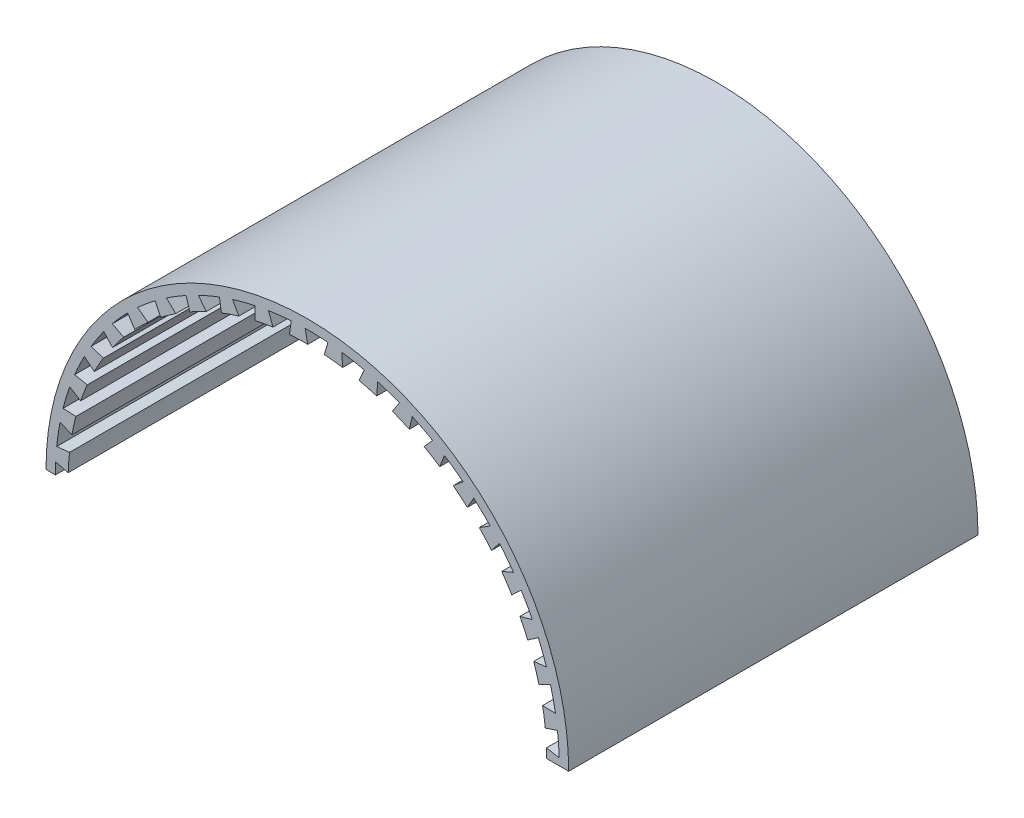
ISO-10303-21;
HEADER;
FILE_DESCRIPTION(('STEP AP214'),'2;1');
FILE_NAME('part.step','',(''),(''),'','','');
FILE_SCHEMA(('AUTOMOTIVE_DESIGN { 1 0 10303 214 1 1 1 1 }'));
ENDSEC;
DATA;
#1=APPLICATION_CONTEXT('core data for automotive mechanical design processes');
#2=APPLICATION_PROTOCOL_DEFINITION('international standard','automotive_design',2000,#1);
#3=PRODUCT_CONTEXT('',#1,'mechanical');
#4=PRODUCT('Part','Part','',(#3));
#5=PRODUCT_RELATED_PRODUCT_CATEGORY('part','',(#4));
#6=PRODUCT_DEFINITION_FORMATION('','',#4);
#7=PRODUCT_DEFINITION_CONTEXT('part definition',#1,'design');
#8=PRODUCT_DEFINITION('design','',#6,#7);
#9=PRODUCT_DEFINITION_SHAPE('','',#8);
#10=(LENGTH_UNIT() NAMED_UNIT(*) SI_UNIT(.MILLI.,.METRE.));
#11=(NAMED_UNIT(*) PLANE_ANGLE_UNIT() SI_UNIT($,.RADIAN.));
#12=(NAMED_UNIT(*) SI_UNIT($,.STERADIAN.) SOLID_ANGLE_UNIT());
#13=UNCERTAINTY_MEASURE_WITH_UNIT(LENGTH_MEASURE(1.E-05),#10,'distance_accuracy_value','');
#14=(GEOMETRIC_REPRESENTATION_CONTEXT(3) GLOBAL_UNCERTAINTY_ASSIGNED_CONTEXT((#13)) GLOBAL_UNIT_ASSIGNED_CONTEXT((#10,
#11,#12)) REPRESENTATION_CONTEXT('',''));
#15=CARTESIAN_POINT('',(0.,0.,0.));
#16=DIRECTION('',(0.,0.,1.));
#17=DIRECTION('',(1.,0.,0.));
#18=AXIS2_PLACEMENT_3D('',#15,#16,#17);
#19=CARTESIAN_POINT('',(0.,0.,-65.));
#20=DIRECTION('',(0.,0.,-1.));
#21=DIRECTION('',(-1.,0.,0.));
#22=AXIS2_PLACEMENT_3D('',#19,#20,#21);
#23=PLANE('',#22);
#24=DIRECTION('',(1.,0.,0.));
#25=VECTOR('',#24,1.);
#26=CARTESIAN_POINT('',(0.,0.,-65.));
#27=LINE('',#26,#25);
#28=CARTESIAN_POINT('',(-41.5,0.,-65.));
#29=VERTEX_POINT('',#28);
#30=CARTESIAN_POINT('',(-40.,0.,-65.));
#31=VERTEX_POINT('',#30);
#32=EDGE_CURVE('E56',#29,#31,#27,.T.);
#33=ORIENTED_EDGE('',*,*,#32,.F.);
#34=CARTESIAN_POINT('',(0.,0.,-65.));
#35=DIRECTION('',(0.,0.,-1.));
#36=DIRECTION('',(0.,1.,0.));
#37=AXIS2_PLACEMENT_3D('',#34,#35,#36);
#38=CIRCLE('',#37,41.5);
#39=CARTESIAN_POINT('',(41.5,0.,-65.));
#40=VERTEX_POINT('',#39);
#41=EDGE_CURVE('E701',#40,#29,#38,.F.);
#42=ORIENTED_EDGE('',*,*,#41,.F.);
#43=CARTESIAN_POINT('',(38.,0.,-65.));
#44=VERTEX_POINT('',#43);
#45=EDGE_CURVE('E783',#44,#40,#27,.T.);
#46=ORIENTED_EDGE('',*,*,#45,.F.);
#47=CARTESIAN_POINT('',(0.,0.,-65.));
#48=DIRECTION('',(0.,0.,-1.));
#49=DIRECTION('',(0.,1.,0.));
#50=AXIS2_PLACEMENT_3D('',#47,#48,#49);
#51=CIRCLE('',#50,38.);
#52=CARTESIAN_POINT('',(37.9719908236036,1.45873674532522,-65.));
#53=VERTEX_POINT('',#52);
#54=EDGE_CURVE('E624',#53,#44,#51,.T.);
#55=ORIENTED_EDGE('',*,*,#54,.F.);
#56=DIRECTION('',(-0.984807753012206,0.173648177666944,0.));
#57=VECTOR('',#56,1.);
#58=CARTESIAN_POINT('',(39.9847665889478,1.10383007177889,-65.));
#59=LINE('',#58,#57);
#60=CARTESIAN_POINT('',(39.9847665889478,1.10383007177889,-65.));
#61=VERTEX_POINT('',#60);
#62=EDGE_CURVE('E621',#61,#53,#59,.T.);
#63=ORIENTED_EDGE('',*,*,#62,.F.);
#64=CARTESIAN_POINT('',(0.,0.,-65.));
#65=DIRECTION('',(0.,0.,-1.));
#66=DIRECTION('',(0.,1.,0.));
#67=AXIS2_PLACEMENT_3D('',#64,#65,#66);
#68=CIRCLE('',#67,40.);
#69=CARTESIAN_POINT('',(39.7193825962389,4.72976174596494,-65.));
#70=VERTEX_POINT('',#69);
#71=EDGE_CURVE('E644',#70,#61,#68,.T.);
#72=ORIENTED_EDGE('',*,*,#71,.F.);
#73=DIRECTION('',(0.949029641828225,0.31518683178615,0.));
#74=VECTOR('',#73,1.);
#75=CARTESIAN_POINT('',(37.7797310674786,4.0855746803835,-65.));
#76=LINE('',#75,#74);
#77=CARTESIAN_POINT('',(37.7797310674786,4.08557468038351,-65.));
#78=VERTEX_POINT('',#77);
#79=EDGE_CURVE('E649',#78,#70,#76,.T.);
#80=ORIENTED_EDGE('',*,*,#79,.F.);
#81=CARTESIAN_POINT('',(0.,0.,-65.));
#82=DIRECTION('',(0.,0.,-1.));
#83=DIRECTION('',(0.,1.,0.));
#84=AXIS2_PLACEMENT_3D('',#81,#82,#83);
#85=CIRCLE('',#84,38.);
#86=CARTESIAN_POINT('',(37.3549435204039,6.97195772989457,-65.));
#87=VERTEX_POINT('',#86);
#88=EDGE_CURVE('E653',#87,#78,#85,.T.);
#89=ORIENTED_EDGE('',*,*,#88,.F.);
#90=DIRECTION('',(-0.99959639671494,0.0284085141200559,0.));
#91=VECTOR('',#90,1.);
#92=CARTESIAN_POINT('',(39.3979447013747,6.91389566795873,-65.));
#93=LINE('',#92,#91);
#94=CARTESIAN_POINT('',(39.3979447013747,6.91389566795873,-65.));
#95=VERTEX_POINT('',#94);
#96=EDGE_CURVE('E635',#95,#87,#93,.T.);
#97=ORIENTED_EDGE('',*,*,#96,.F.);
#98=CARTESIAN_POINT('',(0.,0.,-65.));
#99=DIRECTION('',(0.,0.,-1.));
#100=DIRECTION('',(0.,1.,0.));
#101=AXIS2_PLACEMENT_3D('',#98,#99,#100);
#102=CIRCLE('',#101,40.);
#103=CARTESIAN_POINT('',(38.6074489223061,10.4625469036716,-65.));
#104=VERTEX_POINT('',#103);
#105=EDGE_CURVE('E677',#104,#95,#102,.T.);
#106=ORIENTED_EDGE('',*,*,#105,.F.);
#107=DIRECTION('',(0.893024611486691,0.450007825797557,0.));
#108=VECTOR('',#107,1.);
#109=CARTESIAN_POINT('',(36.7822619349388,9.54280917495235,-65.));
#110=LINE('',#109,#108);
#111=CARTESIAN_POINT('',(36.7822619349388,9.54280917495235,-65.));
#112=VERTEX_POINT('',#111);
#113=EDGE_CURVE('E682',#112,#104,#110,.T.);
#114=ORIENTED_EDGE('',*,*,#113,.F.);
#115=CARTESIAN_POINT('',(0.,0.,-65.));
#116=DIRECTION('',(0.,0.,-1.));
#117=DIRECTION('',(0.,1.,0.));
#118=AXIS2_PLACEMENT_3D('',#115,#116,#117);
#119=CIRCLE('',#118,38.);
#120=CARTESIAN_POINT('',(35.9417404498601,12.3365835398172,-65.));
#121=VERTEX_POINT('',#120);
#122=EDGE_CURVE('E686',#121,#112,#119,.T.);
#123=ORIENTED_EDGE('',*,*,#122,.F.);
#124=DIRECTION('',(-0.993080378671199,-0.117436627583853,0.));
#125=VECTOR('',#124,1.);
#126=CARTESIAN_POINT('',(37.9714240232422,12.5766035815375,-65.));
#127=LINE('',#126,#125);
#128=CARTESIAN_POINT('',(37.9714240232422,12.5766035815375,-65.));
#129=VERTEX_POINT('',#128);
#130=EDGE_CURVE('E668',#129,#121,#127,.T.);
#131=ORIENTED_EDGE('',*,*,#130,.F.);
#132=CARTESIAN_POINT('',(0.,0.,-65.));
#133=DIRECTION('',(0.,0.,-1.));
#134=DIRECTION('',(0.,1.,0.));
#135=AXIS2_PLACEMENT_3D('',#132,#133,#134);
#136=CIRCLE('',#135,40.);
#137=CARTESIAN_POINT('',(36.6726645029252,15.9723410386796,-65.));
#138=VERTEX_POINT('',#137);
#139=EDGE_CURVE('E711',#138,#129,#136,.T.);
#140=ORIENTED_EDGE('',*,*,#139,.F.);
#141=DIRECTION('',(0.817986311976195,0.575237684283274,0.));
#142=VECTOR('',#141,1.);
#143=CARTESIAN_POINT('',(35.0008427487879,14.7966552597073,-65.));
#144=LINE('',#143,#142);
#145=CARTESIAN_POINT('',(35.0008427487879,14.7966552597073,-65.));
#146=VERTEX_POINT('',#145);
#147=EDGE_CURVE('E715',#146,#138,#144,.T.);
#148=ORIENTED_EDGE('',*,*,#147,.F.);
#149=CARTESIAN_POINT('',(0.,0.,-65.));
#150=DIRECTION('',(0.,0.,-1.));
#151=DIRECTION('',(0.,1.,0.));
#152=AXIS2_PLACEMENT_3D('',#149,#150,#151);
#153=CIRCLE('',#152,38.);
#154=CARTESIAN_POINT('',(33.7625015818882,17.4382764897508,-65.));
#155=VERTEX_POINT('',#154);
#156=EDGE_CURVE('E719',#155,#146,#153,.T.);
#157=ORIENTED_EDGE('',*,*,#156,.F.);
#158=DIRECTION('',(-0.9653985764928,-0.26077881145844,0.));
#159=VECTOR('',#158,1.);
#160=CARTESIAN_POINT('',(35.7356083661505,17.9712630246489,-65.));
#161=LINE('',#160,#159);
#162=CARTESIAN_POINT('',(35.7356083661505,17.9712630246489,-65.));
#163=VERTEX_POINT('',#162);
#164=EDGE_CURVE('E723',#163,#155,#161,.T.);
#165=ORIENTED_EDGE('',*,*,#164,.F.);
#166=CARTESIAN_POINT('',(0.,0.,-65.));
#167=DIRECTION('',(0.,0.,-1.));
#168=DIRECTION('',(0.,1.,0.));
#169=AXIS2_PLACEMENT_3D('',#166,#167,#168);
#170=CIRCLE('',#169,40.);
#171=CARTESIAN_POINT('',(33.9562659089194,21.1417124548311,-65.));
#172=VERTEX_POINT('',#171);
#173=EDGE_CURVE('E808',#172,#163,#170,.T.);
#174=ORIENTED_EDGE('',*,*,#173,.F.);
#175=DIRECTION('',(0.725514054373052,0.688207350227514,0.));
#176=VECTOR('',#175,1.);
#177=CARTESIAN_POINT('',(32.4734413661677,19.7351363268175,-65.));
#178=LINE('',#177,#176);
#179=CARTESIAN_POINT('',(32.4734413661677,19.7351363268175,-65.));
#180=VERTEX_POINT('',#179);
#181=EDGE_CURVE('E813',#180,#172,#178,.T.);
#182=ORIENTED_EDGE('',*,*,#181,.F.);
#183=CARTESIAN_POINT('',(0.,0.,-65.));
#184=DIRECTION('',(0.,0.,-1.));
#185=DIRECTION('',(0.,1.,0.));
#186=AXIS2_PLACEMENT_3D('',#183,#184,#185);
#187=CIRCLE('',#186,38.);
#188=CARTESIAN_POINT('',(30.8636736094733,22.1683028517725,-65.));
#189=VERTEX_POINT('',#188);
#190=EDGE_CURVE('E817',#189,#180,#187,.T.);
#191=ORIENTED_EDGE('',*,*,#190,.F.);
#192=DIRECTION('',(-0.917140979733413,-0.398562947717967,0.));
#193=VECTOR('',#192,1.);
#194=CARTESIAN_POINT('',(32.738150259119,22.9828961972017,-65.));
#195=LINE('',#194,#193);
#196=CARTESIAN_POINT('',(32.738150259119,22.9828961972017,-65.));
#197=VERTEX_POINT('',#196);
#198=EDGE_CURVE('E799',#197,#189,#195,.T.);
#199=ORIENTED_EDGE('',*,*,#198,.F.);
#200=CARTESIAN_POINT('',(0.,0.,-65.));
#201=DIRECTION('',(0.,0.,-1.));
#202=DIRECTION('',(0.,1.,0.));
#203=AXIS2_PLACEMENT_3D('',#200,#201,#202);
#204=CIRCLE('',#203,40.);
#205=CARTESIAN_POINT('',(30.5161484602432,25.8604849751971,-65.));
#206=VERTEX_POINT('',#205);
#207=EDGE_CURVE('E838',#206,#197,#204,.T.);
#208=ORIENTED_EDGE('',*,*,#207,.F.);
#209=DIRECTION('',(0.617578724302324,0.786509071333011,0.));
#210=VECTOR('',#209,1.);
#211=CARTESIAN_POINT('',(29.2539249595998,24.2529972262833,-65.));
#212=LINE('',#211,#210);
#213=CARTESIAN_POINT('',(29.2539249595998,24.2529972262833,-65.));
#214=VERTEX_POINT('',#213);
#215=EDGE_CURVE('E843',#214,#206,#212,.T.);
#216=ORIENTED_EDGE('',*,*,#215,.F.);
#217=CARTESIAN_POINT('',(0.,0.,-65.));
#218=DIRECTION('',(0.,0.,-1.));
#219=DIRECTION('',(0.,1.,0.));
#220=AXIS2_PLACEMENT_3D('',#217,#218,#219);
#221=CIRCLE('',#220,38.);
#222=CARTESIAN_POINT('',(27.3070400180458,26.425850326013,-65.));
#223=VERTEX_POINT('',#222);
#224=EDGE_CURVE('E847',#223,#214,#221,.T.);
#225=ORIENTED_EDGE('',*,*,#224,.F.);
#226=DIRECTION('',(-0.84933611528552,-0.527852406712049,0.));
#227=VECTOR('',#226,1.);
#228=CARTESIAN_POINT('',(29.0429353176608,27.504688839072,-65.));
#229=LINE('',#228,#227);
#230=CARTESIAN_POINT('',(29.0429353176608,27.504688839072,-65.));
#231=VERTEX_POINT('',#230);
#232=EDGE_CURVE('E829',#231,#223,#229,.T.);
#233=ORIENTED_EDGE('',*,*,#232,.F.);
#234=CARTESIAN_POINT('',(0.,0.,-65.));
#235=DIRECTION('',(0.,0.,-1.));
#236=DIRECTION('',(0.,1.,0.));
#237=AXIS2_PLACEMENT_3D('',#234,#235,#236);
#238=CIRCLE('',#237,40.);
#239=CARTESIAN_POINT('',(26.4256322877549,30.0280861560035,-65.));
#240=VERTEX_POINT('',#239);
#241=EDGE_CURVE('E871',#240,#231,#238,.T.);
#242=ORIENTED_EDGE('',*,*,#241,.F.);
#243=DIRECTION('',(0.49648077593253,0.868047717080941,0.));
#244=VECTOR('',#243,1.);
#245=CARTESIAN_POINT('',(25.4109119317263,28.2539475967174,-65.));
#246=LINE('',#245,#244);
#247=CARTESIAN_POINT('',(25.4109119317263,28.2539475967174,-65.));
#248=VERTEX_POINT('',#247);
#249=EDGE_CURVE('E876',#248,#240,#246,.T.);
#250=ORIENTED_EDGE('',*,*,#249,.F.);
#251=CARTESIAN_POINT('',(0.,0.,-65.));
#252=DIRECTION('',(0.,0.,-1.));
#253=DIRECTION('',(0.,1.,0.));
#254=AXIS2_PLACEMENT_3D('',#251,#252,#253);
#255=CIRCLE('',#254,38.);
#256=CARTESIAN_POINT('',(23.1684042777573,30.1201766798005,-65.));
#257=VERTEX_POINT('',#256);
#258=EDGE_CURVE('E880',#257,#248,#255,.T.);
#259=ORIENTED_EDGE('',*,*,#258,.F.);
#260=DIRECTION('',(-0.763429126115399,-0.645891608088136,0.));
#261=VECTOR('',#260,1.);
#262=CARTESIAN_POINT('',(24.7287206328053,31.440266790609,-65.));
#263=LINE('',#262,#261);
#264=CARTESIAN_POINT('',(24.7287206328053,31.440266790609,-65.));
#265=VERTEX_POINT('',#264);
#266=EDGE_CURVE('E862',#265,#257,#263,.T.);
#267=ORIENTED_EDGE('',*,*,#266,.F.);
#268=CARTESIAN_POINT('',(0.,0.,-65.));
#269=DIRECTION('',(0.,0.,-1.));
#270=DIRECTION('',(0.,1.,0.));
#271=AXIS2_PLACEMENT_3D('',#268,#269,#270);
#272=CIRCLE('',#271,40.);
#273=CARTESIAN_POINT('',(21.7718996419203,33.555690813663,-65.));
#274=VERTEX_POINT('',#273);
#275=EDGE_CURVE('E904',#274,#265,#272,.T.);
#276=ORIENTED_EDGE('',*,*,#275,.F.);
#277=DIRECTION('',(0.364801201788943,0.931085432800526,0.));
#278=VECTOR('',#277,1.);
#279=CARTESIAN_POINT('',(21.0263094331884,31.6527141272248,-65.));
#280=LINE('',#279,#278);
#281=CARTESIAN_POINT('',(21.0263094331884,31.6527141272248,-65.));
#282=VERTEX_POINT('',#281);
#283=EDGE_CURVE('E909',#282,#274,#280,.T.);
#284=ORIENTED_EDGE('',*,*,#283,.F.);
#285=CARTESIAN_POINT('',(0.,0.,-65.));
#286=DIRECTION('',(0.,0.,-1.));
#287=DIRECTION('',(0.,1.,0.));
#288=AXIS2_PLACEMENT_3D('',#285,#286,#287);
#289=CIRCLE('',#288,38.);
#290=CARTESIAN_POINT('',(18.5359742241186,33.1725437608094,-65.));
#291=VERTEX_POINT('',#290);
#292=EDGE_CURVE('E913',#291,#282,#289,.T.);
#293=ORIENTED_EDGE('',*,*,#292,.F.);
#294=DIRECTION('',(-0.661250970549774,-0.750164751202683,0.));
#295=VECTOR('',#294,1.);
#296=CARTESIAN_POINT('',(19.8874562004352,34.7057500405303,-65.));
#297=LINE('',#296,#295);
#298=CARTESIAN_POINT('',(19.8874562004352,34.7057500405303,-65.));
#299=VERTEX_POINT('',#298);
#300=EDGE_CURVE('E895',#299,#291,#297,.T.);
#301=ORIENTED_EDGE('',*,*,#300,.F.);
#302=CARTESIAN_POINT('',(0.,0.,-65.));
#303=DIRECTION('',(0.,0.,-1.));
#304=DIRECTION('',(0.,1.,0.));
#305=AXIS2_PLACEMENT_3D('',#302,#303,#304);
#306=CIRCLE('',#305,40.);
#307=CARTESIAN_POINT('',(16.6541367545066,36.3681141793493,-65.));
#308=VERTEX_POINT('',#307);
#309=EDGE_CURVE('E937',#308,#299,#306,.T.);
#310=ORIENTED_EDGE('',*,*,#309,.F.);
#311=DIRECTION('',(0.225346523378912,0.974278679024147,0.));
#312=VECTOR('',#311,1.);
#313=CARTESIAN_POINT('',(16.1935676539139,34.3768580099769,-65.));
#314=LINE('',#313,#312);
#315=CARTESIAN_POINT('',(16.1935676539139,34.3768580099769,-65.));
#316=VERTEX_POINT('',#315);
#317=EDGE_CURVE('E942',#316,#308,#314,.T.);
#318=ORIENTED_EDGE('',*,*,#317,.F.);
#319=CARTESIAN_POINT('',(0.,0.,-65.));
#320=DIRECTION('',(0.,0.,-1.));
#321=DIRECTION('',(0.,1.,0.));
#322=AXIS2_PLACEMENT_3D('',#319,#320,#321);
#323=CIRCLE('',#322,38.);
#324=CARTESIAN_POINT('',(13.5084820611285,35.5178956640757,-65.));
#325=VERTEX_POINT('',#324);
#326=EDGE_CURVE('E946',#325,#316,#323,.T.);
#327=ORIENTED_EDGE('',*,*,#326,.F.);
#328=DIRECTION('',(-0.544979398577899,-0.838449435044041,0.));
#329=VECTOR('',#328,1.);
#330=CARTESIAN_POINT('',(14.6223251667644,37.2315404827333,-65.));
#331=LINE('',#330,#329);
#332=CARTESIAN_POINT('',(14.6223251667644,37.2315404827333,-65.));
#333=VERTEX_POINT('',#332);
#334=EDGE_CURVE('E928',#333,#325,#331,.T.);
#335=ORIENTED_EDGE('',*,*,#334,.F.);
#336=CARTESIAN_POINT('',(0.,0.,-65.));
#337=DIRECTION('',(0.,0.,-1.));
#338=DIRECTION('',(0.,1.,0.));
#339=AXIS2_PLACEMENT_3D('',#336,#337,#338);
#340=CIRCLE('',#339,40.);
#341=CARTESIAN_POINT('',(11.1814198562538,38.4054143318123,-65.));
#342=VERTEX_POINT('',#341);
#343=EDGE_CURVE('E970',#342,#333,#340,.T.);
#344=ORIENTED_EDGE('',*,*,#343,.F.);
#345=DIRECTION('',(0.0810889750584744,0.996706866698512,0.));
#346=VECTOR('',#345,1.);
#347=CARTESIAN_POINT('',(11.0156880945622,36.3683188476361,-65.));
#348=LINE('',#347,#346);
#349=CARTESIAN_POINT('',(11.0156880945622,36.3683188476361,-65.));
#350=VERTEX_POINT('',#349);
#351=EDGE_CURVE('E975',#350,#342,#348,.T.);
#352=ORIENTED_EDGE('',*,*,#351,.F.);
#353=CARTESIAN_POINT('',(0.,0.,-65.));
#354=DIRECTION('',(0.,0.,-1.));
#355=DIRECTION('',(0.,1.,0.));
#356=AXIS2_PLACEMENT_3D('',#353,#354,#355);
#357=CIRCLE('',#356,38.);
#358=CARTESIAN_POINT('',(8.19308005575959,37.1062452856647,-65.));
#359=VERTEX_POINT('',#358);
#360=EDGE_CURVE('E979',#359,#350,#357,.T.);
#361=ORIENTED_EDGE('',*,*,#360,.F.);
#362=DIRECTION('',(-0.417092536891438,-0.908864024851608,0.));
#363=VECTOR('',#362,1.);
#364=CARTESIAN_POINT('',(9.04554465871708,38.963805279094,-65.));
#365=LINE('',#364,#363);
#366=CARTESIAN_POINT('',(9.04554465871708,38.963805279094,-65.));
#367=VERTEX_POINT('',#366);
#368=EDGE_CURVE('E961',#367,#359,#365,.T.);
#369=ORIENTED_EDGE('',*,*,#368,.F.);
#370=CARTESIAN_POINT('',(0.,0.,-65.));
#371=DIRECTION('',(0.,0.,-1.));
#372=DIRECTION('',(0.,1.,0.));
#373=AXIS2_PLACEMENT_3D('',#370,#371,#372);
#374=CIRCLE('',#373,40.);
#375=CARTESIAN_POINT('',(5.47039040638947,39.6241697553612,-65.));
#376=VERTEX_POINT('',#375);
#377=EDGE_CURVE('E1003',#376,#367,#374,.T.);
#378=ORIENTED_EDGE('',*,*,#377,.F.);
#379=DIRECTION('',(-0.0648968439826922,0.997891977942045,0.));
#380=VECTOR('',#379,1.);
#381=CARTESIAN_POINT('',(5.60302826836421,37.5846521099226,-65.));
#382=LINE('',#381,#380);
#383=CARTESIAN_POINT('',(5.60302826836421,37.5846521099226,-65.));
#384=VERTEX_POINT('',#383);
#385=EDGE_CURVE('E1008',#384,#376,#382,.T.);
#386=ORIENTED_EDGE('',*,*,#385,.F.);
#387=CARTESIAN_POINT('',(0.,0.,-65.));
#388=DIRECTION('',(0.,0.,-1.));
#389=DIRECTION('',(0.,1.,0.));
#390=AXIS2_PLACEMENT_3D('',#387,#388,#389);
#391=CIRCLE('',#390,38.);
#392=CARTESIAN_POINT('',(2.70305677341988,37.9037397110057,-65.));
#393=VERTEX_POINT('',#392);
#394=EDGE_CURVE('E1012',#393,#384,#391,.T.);
#395=ORIENTED_EDGE('',*,*,#394,.F.);
#396=DIRECTION('',(-0.280316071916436,-0.95990775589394,0.));
#397=VECTOR('',#396,1.);
#398=CARTESIAN_POINT('',(3.27597407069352,39.86562421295,-65.));
#399=LINE('',#398,#397);
#400=CARTESIAN_POINT('',(3.27597407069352,39.86562421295,-65.));
#401=VERTEX_POINT('',#400);
#402=EDGE_CURVE('E994',#401,#393,#399,.T.);
#403=ORIENTED_EDGE('',*,*,#402,.F.);
#404=CARTESIAN_POINT('',(0.,0.,-65.));
#405=DIRECTION('',(0.,0.,-1.));
#406=DIRECTION('',(0.,1.,0.));
#407=AXIS2_PLACEMENT_3D('',#404,#405,#406);
#408=CIRCLE('',#407,40.);
#409=CARTESIAN_POINT('',(-0.357230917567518,39.9984047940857,-65.));
#410=VERTEX_POINT('',#409);
#411=EDGE_CURVE('E1036',#410,#401,#408,.T.);
#412=ORIENTED_EDGE('',*,*,#411,.F.);
#413=DIRECTION('',(-0.209499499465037,0.97780875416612,0.));
#414=VECTOR('',#413,1.);
#415=CARTESIAN_POINT('',(0.0709496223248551,37.9999337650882,-65.));
#416=LINE('',#415,#414);
#417=CARTESIAN_POINT('',(0.0709496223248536,37.9999337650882,-65.));
#418=VERTEX_POINT('',#417);
#419=EDGE_CURVE('E1041',#418,#410,#416,.T.);
#420=ORIENTED_EDGE('',*,*,#419,.F.);
#421=CARTESIAN_POINT('',(0.,0.,-65.));
#422=DIRECTION('',(0.,0.,-1.));
#423=DIRECTION('',(0.,1.,0.));
#424=AXIS2_PLACEMENT_3D('',#421,#422,#423);
#425=CIRCLE('',#424,38.);
#426=CARTESIAN_POINT('',(-2.84457747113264,37.8933817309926,-65.));
#427=VERTEX_POINT('',#426);
#428=EDGE_CURVE('E1045',#427,#418,#425,.T.);
#429=ORIENTED_EDGE('',*,*,#428,.F.);
#430=DIRECTION('',(-0.137565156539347,-0.990492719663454,0.));
#431=VECTOR('',#430,1.);
#432=CARTESIAN_POINT('',(-2.56341821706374,39.9177765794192,-65.));
#433=LINE('',#432,#431);
#434=CARTESIAN_POINT('',(-2.56341821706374,39.9177765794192,-65.));
#435=VERTEX_POINT('',#434);
#436=EDGE_CURVE('E1027',#435,#427,#433,.T.);
#437=ORIENTED_EDGE('',*,*,#436,.F.);
#438=CARTESIAN_POINT('',(0.,0.,-65.));
#439=DIRECTION('',(0.,0.,-1.));
#440=DIRECTION('',(0.,1.,0.));
#441=AXIS2_PLACEMENT_3D('',#438,#439,#440);
#442=CIRCLE('',#441,40.);
#443=CARTESIAN_POINT('',(-6.17723848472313,39.5201432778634,-65.));
#444=VERTEX_POINT('',#443);
#445=EDGE_CURVE('E1069',#444,#435,#442,.T.);
#446=ORIENTED_EDGE('',*,*,#445,.F.);
#447=DIRECTION('',(-0.349637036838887,0.936885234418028,0.));
#448=VECTOR('',#447,1.);
#449=CARTESIAN_POINT('',(-5.46264119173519,37.6053128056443,-65.));
#450=LINE('',#449,#448);
#451=CARTESIAN_POINT('',(-5.46264119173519,37.6053128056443,-65.));
#452=VERTEX_POINT('',#451);
#453=EDGE_CURVE('E1074',#452,#444,#450,.T.);
#454=ORIENTED_EDGE('',*,*,#453,.F.);
#455=CARTESIAN_POINT('',(0.,0.,-65.));
#456=DIRECTION('',(0.,0.,-1.));
#457=DIRECTION('',(0.,1.,0.));
#458=AXIS2_PLACEMENT_3D('',#455,#456,#457);
#459=CIRCLE('',#458,38.);
#460=CARTESIAN_POINT('',(-8.33158448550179,37.0753921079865,-65.));
#461=VERTEX_POINT('',#460);
#462=EDGE_CURVE('E1078',#461,#452,#459,.T.);
#463=ORIENTED_EDGE('',*,*,#462,.F.);
#464=DIRECTION('',(0.00811772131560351,-0.999967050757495,0.));
#465=VECTOR('',#464,1.);
#466=CARTESIAN_POINT('',(-8.34817569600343,39.1191508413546,-65.));
#467=LINE('',#466,#465);
#468=CARTESIAN_POINT('',(-8.34817569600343,39.1191508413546,-65.));
#469=VERTEX_POINT('',#468);
#470=EDGE_CURVE('E1060',#469,#461,#467,.T.);
#471=ORIENTED_EDGE('',*,*,#470,.F.);
#472=CARTESIAN_POINT('',(0.,0.,-65.));
#473=DIRECTION('',(0.,0.,-1.));
#474=DIRECTION('',(0.,1.,0.));
#475=AXIS2_PLACEMENT_3D('',#472,#473,#474);
#476=CIRCLE('',#475,40.);
#477=CARTESIAN_POINT('',(-11.8655889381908,38.1995785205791,-65.));
#478=VERTEX_POINT('',#477);
#479=EDGE_CURVE('E1102',#478,#469,#476,.T.);
#480=ORIENTED_EDGE('',*,*,#479,.F.);
#481=DIRECTION('',(-0.482322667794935,0.875993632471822,0.));
#482=VECTOR('',#481,1.);
#483=CARTESIAN_POINT('',(-10.8798052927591,36.4091998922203,-65.));
#484=LINE('',#483,#482);
#485=CARTESIAN_POINT('',(-10.8798052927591,36.4091998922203,-65.));
#486=VERTEX_POINT('',#485);
#487=EDGE_CURVE('E1107',#486,#478,#484,.T.);
#488=ORIENTED_EDGE('',*,*,#487,.F.);
#489=CARTESIAN_POINT('',(0.,0.,-65.));
#490=DIRECTION('',(0.,0.,-1.));
#491=DIRECTION('',(0.,1.,0.));
#492=AXIS2_PLACEMENT_3D('',#489,#490,#491);
#493=CIRCLE('',#492,38.);
#494=CARTESIAN_POINT('',(-13.6410182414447,35.4672048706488,-65.));
#495=VERTEX_POINT('',#494);
#496=EDGE_CURVE('E1111',#495,#486,#493,.T.);
#497=ORIENTED_EDGE('',*,*,#496,.F.);
#498=DIRECTION('',(0.153627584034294,-0.988128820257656,0.));
#499=VECTOR('',#498,1.);
#500=CARTESIAN_POINT('',(-13.9550063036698,37.486768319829,-65.));
#501=LINE('',#500,#499);
#502=CARTESIAN_POINT('',(-13.9550063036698,37.486768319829,-65.));
#503=VERTEX_POINT('',#502);
#504=EDGE_CURVE('E1093',#503,#495,#501,.T.);
#505=ORIENTED_EDGE('',*,*,#504,.F.);
#506=CARTESIAN_POINT('',(0.,0.,-65.));
#507=DIRECTION('',(0.,0.,-1.));
#508=DIRECTION('',(0.,1.,0.));
#509=AXIS2_PLACEMENT_3D('',#506,#507,#508);
#510=CIRCLE('',#509,40.);
#511=CARTESIAN_POINT('',(-17.3010449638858,36.0648560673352,-65.));
#512=VERTEX_POINT('',#511);
#513=EDGE_CURVE('E1135',#512,#503,#510,.T.);
#514=ORIENTED_EDGE('',*,*,#513,.F.);
#515=DIRECTION('',(-0.60472842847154,0.796431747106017,0.));
#516=VECTOR('',#515,1.);
#517=CARTESIAN_POINT('',(-16.0650852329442,34.4370880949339,-65.));
#518=LINE('',#517,#516);
#519=CARTESIAN_POINT('',(-16.0650852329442,34.4370880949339,-65.));
#520=VERTEX_POINT('',#519);
#521=EDGE_CURVE('E1140',#520,#512,#518,.T.);
#522=ORIENTED_EDGE('',*,*,#521,.F.);
#523=CARTESIAN_POINT('',(0.,0.,-65.));
#524=DIRECTION('',(0.,0.,-1.));
#525=DIRECTION('',(0.,1.,0.));
#526=AXIS2_PLACEMENT_3D('',#523,#524,#525);
#527=CIRCLE('',#526,38.);
#528=CARTESIAN_POINT('',(-18.659717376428,33.1030957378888,-65.));
#529=VERTEX_POINT('',#528);
#530=EDGE_CURVE('E1144',#529,#520,#527,.T.);
#531=ORIENTED_EDGE('',*,*,#530,.F.);
#532=DIRECTION('',(0.295863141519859,-0.955230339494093,0.));
#533=VECTOR('',#532,1.);
#534=CARTESIAN_POINT('',(-19.2644101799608,35.0554204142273,-65.));
#535=LINE('',#534,#533);
#536=CARTESIAN_POINT('',(-19.2644101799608,35.0554204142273,-65.));
#537=VERTEX_POINT('',#536);
#538=EDGE_CURVE('E1126',#537,#529,#535,.T.);
#539=ORIENTED_EDGE('',*,*,#538,.F.);
#540=CARTESIAN_POINT('',(0.,0.,-65.));
#541=DIRECTION('',(0.,0.,-1.));
#542=DIRECTION('',(0.,1.,0.));
#543=AXIS2_PLACEMENT_3D('',#540,#541,#542);
#544=CIRCLE('',#543,40.);
#545=CARTESIAN_POINT('',(-22.3677592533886,33.1614738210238,-65.));
#546=VERTEX_POINT('',#545);
#547=EDGE_CURVE('E1168',#546,#537,#544,.T.);
#548=ORIENTED_EDGE('',*,*,#547,.F.);
#549=DIRECTION('',(-0.714245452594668,0.6998953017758,0.));
#550=VECTOR('',#549,1.);
#551=CARTESIAN_POINT('',(-20.9079657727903,31.7310095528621,-65.));
#552=LINE('',#551,#550);
#553=CARTESIAN_POINT('',(-20.9079657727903,31.7310095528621,-65.));
#554=VERTEX_POINT('',#553);
#555=EDGE_CURVE('E1173',#554,#546,#552,.T.);
#556=ORIENTED_EDGE('',*,*,#555,.F.);
#557=CARTESIAN_POINT('',(0.,0.,-65.));
#558=DIRECTION('',(0.,0.,-1.));
#559=DIRECTION('',(0.,1.,0.));
#560=AXIS2_PLACEMENT_3D('',#557,#558,#559);
#561=CIRCLE('',#560,38.);
#562=CARTESIAN_POINT('',(-23.2807170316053,30.0334515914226,-65.));
#563=VERTEX_POINT('',#562);
#564=EDGE_CURVE('E1177',#563,#554,#561,.T.);
#565=ORIENTED_EDGE('',*,*,#564,.F.);
#566=DIRECTION('',(0.431792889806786,-0.901972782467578,0.));
#567=VECTOR('',#566,1.);
#568=CARTESIAN_POINT('',(-24.1632265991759,31.8769270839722,-65.));
#569=LINE('',#568,#567);
#570=CARTESIAN_POINT('',(-24.1632265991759,31.8769270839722,-65.));
#571=VERTEX_POINT('',#570);
#572=EDGE_CURVE('E1159',#571,#563,#569,.T.);
#573=ORIENTED_EDGE('',*,*,#572,.F.);
#574=CARTESIAN_POINT('',(0.,0.,-65.));
#575=DIRECTION('',(0.,0.,-1.));
#576=DIRECTION('',(0.,1.,0.));
#577=AXIS2_PLACEMENT_3D('',#574,#575,#576);
#578=CIRCLE('',#577,40.);
#579=CARTESIAN_POINT('',(-26.9577435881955,29.5513123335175,-65.));
#580=VERTEX_POINT('',#579);
#581=EDGE_CURVE('E1201',#580,#571,#578,.T.);
#582=ORIENTED_EDGE('',*,*,#581,.F.);
#583=DIRECTION('',(-0.80853957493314,0.588441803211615,0.));
#584=VECTOR('',#583,1.);
#585=CARTESIAN_POINT('',(-25.3052293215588,28.3486396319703,-65.));
#586=LINE('',#585,#584);
#587=CARTESIAN_POINT('',(-25.3052293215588,28.3486396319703,-65.));
#588=VERTEX_POINT('',#587);
#589=EDGE_CURVE('E1206',#588,#580,#586,.T.);
#590=ORIENTED_EDGE('',*,*,#589,.F.);
#591=CARTESIAN_POINT('',(0.,0.,-65.));
#592=DIRECTION('',(0.,0.,-1.));
#593=DIRECTION('',(0.,1.,0.));
#594=AXIS2_PLACEMENT_3D('',#591,#592,#593);
#595=CIRCLE('',#594,38.);
#596=CARTESIAN_POINT('',(-27.4055286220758,26.3236965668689,-65.));
#597=VERTEX_POINT('',#596);
#598=EDGE_CURVE('E1210',#597,#588,#595,.T.);
#599=ORIENTED_EDGE('',*,*,#598,.F.);
#600=DIRECTION('',(0.558519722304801,-0.829491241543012,0.));
#601=VECTOR('',#600,1.);
#602=CARTESIAN_POINT('',(-28.5470457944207,28.0190323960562,-65.));
#603=LINE('',#602,#601);
#604=CARTESIAN_POINT('',(-28.5470457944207,28.0190323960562,-65.));
#605=VERTEX_POINT('',#604);
#606=EDGE_CURVE('E1192',#605,#597,#603,.T.);
#607=ORIENTED_EDGE('',*,*,#606,.F.);
#608=CARTESIAN_POINT('',(0.,0.,-65.));
#609=DIRECTION('',(0.,0.,-1.));
#610=DIRECTION('',(0.,1.,0.));
#611=AXIS2_PLACEMENT_3D('',#608,#609,#610);
#612=CIRCLE('',#611,40.);
#613=CARTESIAN_POINT('',(-30.9731704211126,25.3113159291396,-65.));
#614=VERTEX_POINT('',#613);
#615=EDGE_CURVE('E1234',#614,#605,#612,.T.);
#616=ORIENTED_EDGE('',*,*,#615,.F.);
#617=DIRECTION('',(-0.885601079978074,0.46444668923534,0.));
#618=VECTOR('',#617,1.);
#619=CARTESIAN_POINT('',(-29.1631558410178,24.36206767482,-65.));
#620=LINE('',#619,#618);
#621=CARTESIAN_POINT('',(-29.1631558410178,24.36206767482,-65.));
#622=VERTEX_POINT('',#621);
#623=EDGE_CURVE('E1239',#622,#614,#620,.T.);
#624=ORIENTED_EDGE('',*,*,#623,.F.);
#625=CARTESIAN_POINT('',(0.,0.,-65.));
#626=DIRECTION('',(0.,0.,-1.));
#627=DIRECTION('',(0.,1.,0.));
#628=AXIS2_PLACEMENT_3D('',#625,#626,#627);
#629=CIRCLE('',#628,38.);
#630=CARTESIAN_POINT('',(-30.9462389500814,22.0528976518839,-65.));
#631=VERTEX_POINT('',#630);
#632=EDGE_CURVE('E1243',#631,#622,#629,.T.);
#633=ORIENTED_EDGE('',*,*,#632,.F.);
#634=DIRECTION('',(0.673342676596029,-0.739330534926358,0.));
#635=VECTOR('',#634,1.);
#636=CARTESIAN_POINT('',(-32.3224342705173,23.5639606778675,-65.));
#637=LINE('',#636,#635);
#638=CARTESIAN_POINT('',(-32.3224342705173,23.5639606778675,-65.));
#639=VERTEX_POINT('',#638);
#640=EDGE_CURVE('E1225',#639,#631,#637,.T.);
#641=ORIENTED_EDGE('',*,*,#640,.F.);
#642=CARTESIAN_POINT('',(0.,0.,-65.));
#643=DIRECTION('',(0.,0.,-1.));
#644=DIRECTION('',(0.,1.,0.));
#645=AXIS2_PLACEMENT_3D('',#642,#643,#644);
#646=CIRCLE('',#645,40.);
#647=CARTESIAN_POINT('',(-34.3284579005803,20.5318527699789,-65.));
#648=VERTEX_POINT('',#647);
#649=EDGE_CURVE('E1267',#648,#639,#646,.T.);
#650=ORIENTED_EDGE('',*,*,#649,.F.);
#651=DIRECTION('',(-0.943787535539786,0.330552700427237,0.));
#652=VECTOR('',#651,1.);
#653=CARTESIAN_POINT('',(-32.3995203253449,19.8562605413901,-65.));
#654=LINE('',#653,#652);
#655=CARTESIAN_POINT('',(-32.3995203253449,19.8562605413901,-65.));
#656=VERTEX_POINT('',#655);
#657=EDGE_CURVE('E1272',#656,#648,#654,.T.);
#658=ORIENTED_EDGE('',*,*,#657,.F.);
#659=CARTESIAN_POINT('',(0.,0.,-65.));
#660=DIRECTION('',(0.,0.,-1.));
#661=DIRECTION('',(0.,1.,0.));
#662=AXIS2_PLACEMENT_3D('',#659,#660,#661);
#663=CIRCLE('',#662,38.);
#664=CARTESIAN_POINT('',(-33.8273839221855,17.3120795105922,-65.));
#665=VERTEX_POINT('',#664);
#666=EDGE_CURVE('E1276',#665,#656,#663,.T.);
#667=ORIENTED_EDGE('',*,*,#666,.F.);
#668=DIRECTION('',(0.773814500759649,-0.633412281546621,0.));
#669=VECTOR('',#668,1.);
#670=CARTESIAN_POINT('',(-35.4089261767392,18.6066640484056,-65.));
#671=LINE('',#670,#669);
#672=CARTESIAN_POINT('',(-35.4089261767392,18.6066640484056,-65.));
#673=VERTEX_POINT('',#672);
#674=EDGE_CURVE('E1258',#673,#665,#671,.T.);
#675=ORIENTED_EDGE('',*,*,#674,.F.);
#676=CARTESIAN_POINT('',(0.,0.,-65.));
#677=DIRECTION('',(0.,0.,-1.));
#678=DIRECTION('',(0.,1.,0.));
#679=AXIS2_PLACEMENT_3D('',#676,#677,#678);
#680=CIRCLE('',#679,40.);
#681=CARTESIAN_POINT('',(-36.9520938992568,15.3147888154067,-65.));
#682=VERTEX_POINT('',#681);
#683=EDGE_CURVE('E1300',#682,#673,#680,.T.);
#684=ORIENTED_EDGE('',*,*,#683,.F.);
#685=DIRECTION('',(-0.981858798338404,0.189613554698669,0.));
#686=VECTOR('',#685,1.);
#687=CARTESIAN_POINT('',(-34.9453452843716,14.9272516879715,-65.));
#688=LINE('',#687,#686);
#689=CARTESIAN_POINT('',(-34.9453452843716,14.9272516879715,-65.));
#690=VERTEX_POINT('',#689);
#691=EDGE_CURVE('E1305',#690,#682,#688,.T.);
#692=ORIENTED_EDGE('',*,*,#691,.F.);
#693=CARTESIAN_POINT('',(0.,0.,-65.));
#694=DIRECTION('',(0.,0.,-1.));
#695=DIRECTION('',(0.,1.,0.));
#696=AXIS2_PLACEMENT_3D('',#693,#694,#695);
#697=CIRCLE('',#696,38.);
#698=CARTESIAN_POINT('',(-35.9875569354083,12.2022844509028,-65.));
#699=VERTEX_POINT('',#698);
#700=EDGE_CURVE('E1309',#699,#690,#697,.T.);
#701=ORIENTED_EDGE('',*,*,#700,.F.);
#702=DIRECTION('',(0.857793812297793,-0.513993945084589,0.));
#703=VECTOR('',#702,1.);
#704=CARTESIAN_POINT('',(-37.7407382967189,13.2527986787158,-65.));
#705=LINE('',#704,#703);
#706=CARTESIAN_POINT('',(-37.7407382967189,13.2527986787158,-65.));
#707=VERTEX_POINT('',#706);
#708=EDGE_CURVE('E1291',#707,#699,#705,.T.);
#709=ORIENTED_EDGE('',*,*,#708,.F.);
#710=CARTESIAN_POINT('',(0.,0.,-65.));
#711=DIRECTION('',(0.,0.,-1.));
#712=DIRECTION('',(0.,1.,0.));
#713=AXIS2_PLACEMENT_3D('',#710,#711,#712);
#714=CIRCLE('',#713,40.);
#715=CARTESIAN_POINT('',(-38.7881601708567,9.77131672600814,-65.));
#716=VERTEX_POINT('',#715);
#717=EDGE_CURVE('E1333',#716,#707,#714,.T.);
#718=ORIENTED_EDGE('',*,*,#717,.F.);
#719=DIRECTION('',(-0.999003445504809,0.044633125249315,0.));
#720=VECTOR('',#719,1.);
#721=CARTESIAN_POINT('',(-36.7463708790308,9.68009438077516,-65.));
#722=LINE('',#721,#720);
#723=CARTESIAN_POINT('',(-36.7463708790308,9.68009438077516,-65.));
#724=VERTEX_POINT('',#723);
#725=EDGE_CURVE('E1338',#724,#716,#722,.T.);
#726=ORIENTED_EDGE('',*,*,#725,.F.);
#727=CARTESIAN_POINT('',(0.,0.,-65.));
#728=DIRECTION('',(0.,0.,-1.));
#729=DIRECTION('',(0.,1.,0.));
#730=AXIS2_PLACEMENT_3D('',#727,#728,#729);
#731=CIRCLE('',#730,38.);
#732=CARTESIAN_POINT('',(-37.3807176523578,6.8324188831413,-65.));
#733=VERTEX_POINT('',#732);
#734=EDGE_CURVE('E1342',#733,#724,#731,.T.);
#735=ORIENTED_EDGE('',*,*,#734,.F.);
#736=DIRECTION('',(0.923490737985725,-0.38362072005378,0.));
#737=VECTOR('',#736,1.);
#738=CARTESIAN_POINT('',(-39.2681721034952,7.6164729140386,-65.));
#739=LINE('',#738,#737);
#740=CARTESIAN_POINT('',(-39.2681721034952,7.6164729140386,-65.));
#741=VERTEX_POINT('',#740);
#742=EDGE_CURVE('E1324',#741,#733,#739,.T.);
#743=ORIENTED_EDGE('',*,*,#742,.F.);
#744=CARTESIAN_POINT('',(0.,0.,-65.));
#745=DIRECTION('',(0.,0.,-1.));
#746=DIRECTION('',(0.,1.,0.));
#747=AXIS2_PLACEMENT_3D('',#744,#745,#746);
#748=CIRCLE('',#747,40.);
#749=CARTESIAN_POINT('',(-39.7975241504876,4.0195859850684,-65.));
#750=VERTEX_POINT('',#749);
#751=EDGE_CURVE('E612',#750,#741,#748,.T.);
#752=ORIENTED_EDGE('',*,*,#751,.F.);
#753=DIRECTION('',(-0.99485606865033,-0.101298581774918,0.));
#754=VECTOR('',#753,1.);
#755=CARTESIAN_POINT('',(-37.7642113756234,4.22662266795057,-65.));
#756=LINE('',#755,#754);
#757=CARTESIAN_POINT('',(-37.7642113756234,4.22662266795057,-65.));
#758=VERTEX_POINT('',#757);
#759=EDGE_CURVE('E1368',#758,#750,#756,.T.);
#760=ORIENTED_EDGE('',*,*,#759,.F.);
#761=CARTESIAN_POINT('',(0.,0.,-65.));
#762=DIRECTION('',(0.,0.,-1.));
#763=DIRECTION('',(0.,1.,0.));
#764=AXIS2_PLACEMENT_3D('',#761,#762,#763);
#765=CIRCLE('',#764,38.);
#766=CARTESIAN_POINT('',(-37.9771732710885,1.31693216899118,-65.));
#767=VERTEX_POINT('',#766);
#768=EDGE_CURVE('E1372',#767,#758,#765,.T.);
#769=ORIENTED_EDGE('',*,*,#768,.F.);
#770=DIRECTION('',(0.96950506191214,-0.245071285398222,0.));
#771=VECTOR('',#770,1.);
#772=CARTESIAN_POINT('',(-39.958672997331,1.81781525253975,-65.));
#773=LINE('',#772,#771);
#774=CARTESIAN_POINT('',(-39.958672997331,1.81781525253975,-65.));
#775=VERTEX_POINT('',#774);
#776=EDGE_CURVE('E1357',#775,#767,#773,.T.);
#777=ORIENTED_EDGE('',*,*,#776,.F.);
#778=CARTESIAN_POINT('',(0.,0.,-65.));
#779=DIRECTION('',(0.,0.,-1.));
#780=DIRECTION('',(0.,1.,0.));
#781=AXIS2_PLACEMENT_3D('',#778,#779,#780);
#782=CIRCLE('',#781,40.);
#783=EDGE_CURVE('E607',#31,#775,#782,.T.);
#784=ORIENTED_EDGE('',*,*,#783,.F.);
#785=EDGE_LOOP('',(#33,#42,#46,#55,#63,#72,#80,#89,#97,#106,#114,#123,#131,#140,#148,#157,#165,
#174,#182,#191,#199,#208,#216,#225,#233,#242,#250,#259,#267,#276,#284,#293,#301,#310,#318,#327,
#335,#344,#352,#361,#369,#378,#386,#395,#403,#412,#420,#429,#437,#446,#454,#463,#471,#480,#488,
#497,#505,#514,#522,#531,#539,#548,#556,#565,#573,#582,#590,#599,#607,#616,#624,#633,#641,#650,
#658,#667,#675,#684,#692,#701,#709,#718,#726,#735,#743,#752,#760,#769,#777,#784));
#786=FACE_BOUND('',#785,.T.);
#787=ADVANCED_FACE('F35',(#786),#23,.T.);
#788=CARTESIAN_POINT('',(0.,0.,0.));
#789=DIRECTION('',(0.,0.,1.));
#790=DIRECTION('',(1.,0.,0.));
#791=AXIS2_PLACEMENT_3D('',#788,#789,#790);
#792=PLANE('',#791);
#793=DIRECTION('',(-1.,0.,0.));
#794=VECTOR('',#793,1.);
#795=CARTESIAN_POINT('',(0.,0.,0.));
#796=LINE('',#795,#794);
#797=CARTESIAN_POINT('',(41.5,0.,0.));
#798=VERTEX_POINT('',#797);
#799=CARTESIAN_POINT('',(38.,0.,0.));
#800=VERTEX_POINT('',#799);
#801=EDGE_CURVE('E49',#798,#800,#796,.T.);
#802=ORIENTED_EDGE('',*,*,#801,.F.);
#803=CARTESIAN_POINT('',(0.,0.,0.));
#804=DIRECTION('',(0.,0.,1.));
#805=DIRECTION('',(1.,0.,0.));
#806=AXIS2_PLACEMENT_3D('',#803,#804,#805);
#807=CIRCLE('',#806,41.5);
#808=CARTESIAN_POINT('',(-41.5,0.,0.));
#809=VERTEX_POINT('',#808);
#810=EDGE_CURVE('E601',#798,#809,#807,.T.);
#811=ORIENTED_EDGE('',*,*,#810,.T.);
#812=CARTESIAN_POINT('',(-40.,0.,0.));
#813=VERTEX_POINT('',#812);
#814=EDGE_CURVE('E589',#813,#809,#796,.T.);
#815=ORIENTED_EDGE('',*,*,#814,.F.);
#816=CARTESIAN_POINT('',(0.,0.,0.));
#817=DIRECTION('',(0.,0.,-1.));
#818=DIRECTION('',(-0.934016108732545,0.35723088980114,0.));
#819=AXIS2_PLACEMENT_3D('',#816,#817,#818);
#820=CIRCLE('',#819,40.);
#821=CARTESIAN_POINT('',(-39.9586729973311,1.81781525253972,0.));
#822=VERTEX_POINT('',#821);
#823=EDGE_CURVE('E598',#813,#822,#820,.T.);
#824=ORIENTED_EDGE('',*,*,#823,.T.);
#825=DIRECTION('',(0.96950506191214,-0.245071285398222,0.));
#826=VECTOR('',#825,1.);
#827=CARTESIAN_POINT('',(-39.958672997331,1.81781525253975,0.));
#828=LINE('',#827,#826);
#829=CARTESIAN_POINT('',(-37.9771732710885,1.31693216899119,0.));
#830=VERTEX_POINT('',#829);
#831=EDGE_CURVE('E1361',#822,#830,#828,.T.);
#832=ORIENTED_EDGE('',*,*,#831,.T.);
#833=CARTESIAN_POINT('',(0.,0.,0.));
#834=DIRECTION('',(0.,0.,-1.));
#835=DIRECTION('',(-0.872049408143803,0.489417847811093,0.));
#836=AXIS2_PLACEMENT_3D('',#833,#834,#835);
#837=CIRCLE('',#836,38.);
#838=CARTESIAN_POINT('',(-37.7642113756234,4.22662266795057,0.));
#839=VERTEX_POINT('',#838);
#840=EDGE_CURVE('E1358',#830,#839,#837,.T.);
#841=ORIENTED_EDGE('',*,*,#840,.T.);
#842=DIRECTION('',(-0.99485606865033,-0.101298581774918,0.));
#843=VECTOR('',#842,1.);
#844=CARTESIAN_POINT('',(-37.7642113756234,4.22662266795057,0.));
#845=LINE('',#844,#843);
#846=CARTESIAN_POINT('',(-39.7975241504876,4.0195859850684,0.));
#847=VERTEX_POINT('',#846);
#848=EDGE_CURVE('E1354',#839,#847,#845,.T.);
#849=ORIENTED_EDGE('',*,*,#848,.T.);
#850=CARTESIAN_POINT('',(0.,0.,0.));
#851=DIRECTION('',(0.,0.,-1.));
#852=DIRECTION('',(-0.872049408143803,0.489417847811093,0.));
#853=AXIS2_PLACEMENT_3D('',#850,#851,#852);
#854=CIRCLE('',#853,40.);
#855=CARTESIAN_POINT('',(-39.2681721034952,7.61647291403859,0.));
#856=VERTEX_POINT('',#855);
#857=EDGE_CURVE('E1353',#847,#856,#854,.T.);
#858=ORIENTED_EDGE('',*,*,#857,.T.);
#859=DIRECTION('',(0.923490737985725,-0.38362072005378,0.));
#860=VECTOR('',#859,1.);
#861=CARTESIAN_POINT('',(-39.2681721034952,7.6164729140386,0.));
#862=LINE('',#861,#860);
#863=CARTESIAN_POINT('',(-37.3807176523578,6.8324188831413,0.));
#864=VERTEX_POINT('',#863);
#865=EDGE_CURVE('E1328',#856,#864,#862,.T.);
#866=ORIENTED_EDGE('',*,*,#865,.T.);
#867=CARTESIAN_POINT('',(0.,0.,0.));
#868=DIRECTION('',(0.,0.,-1.));
#869=DIRECTION('',(-0.791496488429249,0.611173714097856,0.));
#870=AXIS2_PLACEMENT_3D('',#867,#868,#869);
#871=CIRCLE('',#870,38.);
#872=CARTESIAN_POINT('',(-36.7463708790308,9.68009438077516,0.));
#873=VERTEX_POINT('',#872);
#874=EDGE_CURVE('E1325',#864,#873,#871,.T.);
#875=ORIENTED_EDGE('',*,*,#874,.T.);
#876=DIRECTION('',(-0.999003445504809,0.044633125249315,0.));
#877=VECTOR('',#876,1.);
#878=CARTESIAN_POINT('',(-36.7463708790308,9.68009438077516,0.));
#879=LINE('',#878,#877);
#880=CARTESIAN_POINT('',(-38.7881601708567,9.77131672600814,0.));
#881=VERTEX_POINT('',#880);
#882=EDGE_CURVE('E1321',#873,#881,#879,.T.);
#883=ORIENTED_EDGE('',*,*,#882,.T.);
#884=CARTESIAN_POINT('',(0.,0.,0.));
#885=DIRECTION('',(0.,0.,-1.));
#886=DIRECTION('',(-0.791496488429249,0.611173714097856,0.));
#887=AXIS2_PLACEMENT_3D('',#884,#885,#886);
#888=CIRCLE('',#887,40.);
#889=CARTESIAN_POINT('',(-37.740738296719,13.2527986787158,0.));
#890=VERTEX_POINT('',#889);
#891=EDGE_CURVE('E1320',#881,#890,#888,.T.);
#892=ORIENTED_EDGE('',*,*,#891,.T.);
#893=DIRECTION('',(0.857793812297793,-0.513993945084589,0.));
#894=VECTOR('',#893,1.);
#895=CARTESIAN_POINT('',(-37.7407382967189,13.2527986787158,0.));
#896=LINE('',#895,#894);
#897=CARTESIAN_POINT('',(-35.9875569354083,12.2022844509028,0.));
#898=VERTEX_POINT('',#897);
#899=EDGE_CURVE('E1295',#890,#898,#896,.T.);
#900=ORIENTED_EDGE('',*,*,#899,.T.);
#901=CARTESIAN_POINT('',(0.,0.,0.));
#902=DIRECTION('',(0.,0.,-1.));
#903=DIRECTION('',(-0.694074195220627,0.719903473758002,0.));
#904=AXIS2_PLACEMENT_3D('',#901,#902,#903);
#905=CIRCLE('',#904,38.);
#906=CARTESIAN_POINT('',(-34.9453452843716,14.9272516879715,0.));
#907=VERTEX_POINT('',#906);
#908=EDGE_CURVE('E1292',#898,#907,#905,.T.);
#909=ORIENTED_EDGE('',*,*,#908,.T.);
#910=DIRECTION('',(-0.981858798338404,0.189613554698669,0.));
#911=VECTOR('',#910,1.);
#912=CARTESIAN_POINT('',(-34.9453452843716,14.9272516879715,0.));
#913=LINE('',#912,#911);
#914=CARTESIAN_POINT('',(-36.9520938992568,15.3147888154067,0.));
#915=VERTEX_POINT('',#914);
#916=EDGE_CURVE('E1288',#907,#915,#913,.T.);
#917=ORIENTED_EDGE('',*,*,#916,.T.);
#918=CARTESIAN_POINT('',(0.,0.,0.));
#919=DIRECTION('',(0.,0.,-1.));
#920=DIRECTION('',(-0.694074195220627,0.719903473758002,0.));
#921=AXIS2_PLACEMENT_3D('',#918,#919,#920);
#922=CIRCLE('',#921,40.);
#923=CARTESIAN_POINT('',(-35.4089261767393,18.6066640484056,0.));
#924=VERTEX_POINT('',#923);
#925=EDGE_CURVE('E1287',#915,#924,#922,.T.);
#926=ORIENTED_EDGE('',*,*,#925,.T.);
#927=DIRECTION('',(0.773814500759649,-0.633412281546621,0.));
#928=VECTOR('',#927,1.);
#929=CARTESIAN_POINT('',(-35.4089261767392,18.6066640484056,0.));
#930=LINE('',#929,#928);
#931=CARTESIAN_POINT('',(-33.8273839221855,17.3120795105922,0.));
#932=VERTEX_POINT('',#931);
#933=EDGE_CURVE('E1262',#924,#932,#930,.T.);
#934=ORIENTED_EDGE('',*,*,#933,.T.);
#935=CARTESIAN_POINT('',(0.,0.,0.));
#936=DIRECTION('',(0.,0.,-1.));
#937=DIRECTION('',(-0.581858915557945,0.813289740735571,0.));
#938=AXIS2_PLACEMENT_3D('',#935,#936,#937);
#939=CIRCLE('',#938,38.);
#940=CARTESIAN_POINT('',(-32.3995203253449,19.8562605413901,0.));
#941=VERTEX_POINT('',#940);
#942=EDGE_CURVE('E1259',#932,#941,#939,.T.);
#943=ORIENTED_EDGE('',*,*,#942,.T.);
#944=DIRECTION('',(-0.943787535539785,0.330552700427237,0.));
#945=VECTOR('',#944,1.);
#946=CARTESIAN_POINT('',(-32.3995203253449,19.8562605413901,0.));
#947=LINE('',#946,#945);
#948=CARTESIAN_POINT('',(-34.3284579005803,20.5318527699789,0.));
#949=VERTEX_POINT('',#948);
#950=EDGE_CURVE('E1255',#941,#949,#947,.T.);
#951=ORIENTED_EDGE('',*,*,#950,.T.);
#952=CARTESIAN_POINT('',(0.,0.,0.));
#953=DIRECTION('',(0.,0.,-1.));
#954=DIRECTION('',(-0.581858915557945,0.813289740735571,0.));
#955=AXIS2_PLACEMENT_3D('',#952,#953,#954);
#956=CIRCLE('',#955,40.);
#957=CARTESIAN_POINT('',(-32.3224342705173,23.5639606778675,0.));
#958=VERTEX_POINT('',#957);
#959=EDGE_CURVE('E1254',#949,#958,#956,.T.);
#960=ORIENTED_EDGE('',*,*,#959,.T.);
#961=DIRECTION('',(0.673342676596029,-0.739330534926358,0.));
#962=VECTOR('',#961,1.);
#963=CARTESIAN_POINT('',(-32.3224342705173,23.5639606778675,0.));
#964=LINE('',#963,#962);
#965=CARTESIAN_POINT('',(-30.9462389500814,22.0528976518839,0.));
#966=VERTEX_POINT('',#965);
#967=EDGE_CURVE('E1229',#958,#966,#964,.T.);
#968=ORIENTED_EDGE('',*,*,#967,.T.);
#969=CARTESIAN_POINT('',(0.,0.,0.));
#970=DIRECTION('',(0.,0.,-1.));
#971=DIRECTION('',(-0.45724232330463,0.889342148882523,0.));
#972=AXIS2_PLACEMENT_3D('',#969,#970,#971);
#973=CIRCLE('',#972,38.);
#974=CARTESIAN_POINT('',(-29.1631558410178,24.36206767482,0.));
#975=VERTEX_POINT('',#974);
#976=EDGE_CURVE('E1226',#966,#975,#973,.T.);
#977=ORIENTED_EDGE('',*,*,#976,.T.);
#978=DIRECTION('',(-0.885601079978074,0.46444668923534,0.));
#979=VECTOR('',#978,1.);
#980=CARTESIAN_POINT('',(-29.1631558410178,24.36206767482,0.));
#981=LINE('',#980,#979);
#982=CARTESIAN_POINT('',(-30.9731704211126,25.3113159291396,0.));
#983=VERTEX_POINT('',#982);
#984=EDGE_CURVE('E1222',#975,#983,#981,.T.);
#985=ORIENTED_EDGE('',*,*,#984,.T.);
#986=CARTESIAN_POINT('',(0.,0.,0.));
#987=DIRECTION('',(0.,0.,-1.));
#988=DIRECTION('',(-0.45724232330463,0.889342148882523,0.));
#989=AXIS2_PLACEMENT_3D('',#986,#987,#988);
#990=CIRCLE('',#989,40.);
#991=CARTESIAN_POINT('',(-28.5470457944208,28.0190323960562,0.));
#992=VERTEX_POINT('',#991);
#993=EDGE_CURVE('E1221',#983,#992,#990,.T.);
#994=ORIENTED_EDGE('',*,*,#993,.T.);
#995=DIRECTION('',(0.558519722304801,-0.829491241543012,0.));
#996=VECTOR('',#995,1.);
#997=CARTESIAN_POINT('',(-28.5470457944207,28.0190323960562,0.));
#998=LINE('',#997,#996);
#999=CARTESIAN_POINT('',(-27.4055286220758,26.3236965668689,0.));
#1000=VERTEX_POINT('',#999);
#1001=EDGE_CURVE('E1196',#992,#1000,#998,.T.);
#1002=ORIENTED_EDGE('',*,*,#1001,.T.);
#1003=CARTESIAN_POINT('',(0.,0.,0.));
#1004=DIRECTION('',(0.,0.,-1.));
#1005=DIRECTION('',(-0.322880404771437,0.946439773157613,0.));
#1006=AXIS2_PLACEMENT_3D('',#1003,#1004,#1005);
#1007=CIRCLE('',#1006,38.);
#1008=CARTESIAN_POINT('',(-25.3052293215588,28.3486396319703,0.));
#1009=VERTEX_POINT('',#1008);
#1010=EDGE_CURVE('E1193',#1000,#1009,#1007,.T.);
#1011=ORIENTED_EDGE('',*,*,#1010,.T.);
#1012=DIRECTION('',(-0.80853957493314,0.588441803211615,0.));
#1013=VECTOR('',#1012,1.);
#1014=CARTESIAN_POINT('',(-25.3052293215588,28.3486396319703,0.));
#1015=LINE('',#1014,#1013);
#1016=CARTESIAN_POINT('',(-26.9577435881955,29.5513123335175,0.));
#1017=VERTEX_POINT('',#1016);
#1018=EDGE_CURVE('E1189',#1009,#1017,#1015,.T.);
#1019=ORIENTED_EDGE('',*,*,#1018,.T.);
#1020=CARTESIAN_POINT('',(0.,0.,0.));
#1021=DIRECTION('',(0.,0.,-1.));
#1022=DIRECTION('',(-0.322880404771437,0.946439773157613,0.));
#1023=AXIS2_PLACEMENT_3D('',#1020,#1021,#1022);
#1024=CIRCLE('',#1023,40.);
#1025=CARTESIAN_POINT('',(-24.1632265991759,31.8769270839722,0.));
#1026=VERTEX_POINT('',#1025);
#1027=EDGE_CURVE('E1188',#1017,#1026,#1024,.T.);
#1028=ORIENTED_EDGE('',*,*,#1027,.T.);
#1029=DIRECTION('',(0.431792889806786,-0.901972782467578,0.));
#1030=VECTOR('',#1029,1.);
#1031=CARTESIAN_POINT('',(-24.1632265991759,31.8769270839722,0.));
#1032=LINE('',#1031,#1030);
#1033=CARTESIAN_POINT('',(-23.2807170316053,30.0334515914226,0.));
#1034=VERTEX_POINT('',#1033);
#1035=EDGE_CURVE('E1163',#1026,#1034,#1032,.T.);
#1036=ORIENTED_EDGE('',*,*,#1035,.T.);
#1037=CARTESIAN_POINT('',(0.,0.,0.));
#1038=DIRECTION('',(0.,0.,-1.));
#1039=DIRECTION('',(-0.181636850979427,0.983365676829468,0.));
#1040=AXIS2_PLACEMENT_3D('',#1037,#1038,#1039);
#1041=CIRCLE('',#1040,38.);
#1042=CARTESIAN_POINT('',(-20.9079657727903,31.7310095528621,0.));
#1043=VERTEX_POINT('',#1042);
#1044=EDGE_CURVE('E1160',#1034,#1043,#1041,.T.);
#1045=ORIENTED_EDGE('',*,*,#1044,.T.);
#1046=DIRECTION('',(-0.714245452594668,0.6998953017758,0.));
#1047=VECTOR('',#1046,1.);
#1048=CARTESIAN_POINT('',(-20.9079657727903,31.7310095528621,0.));
#1049=LINE('',#1048,#1047);
#1050=CARTESIAN_POINT('',(-22.3677592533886,33.1614738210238,0.));
#1051=VERTEX_POINT('',#1050);
#1052=EDGE_CURVE('E1156',#1043,#1051,#1049,.T.);
#1053=ORIENTED_EDGE('',*,*,#1052,.T.);
#1054=CARTESIAN_POINT('',(0.,0.,0.));
#1055=DIRECTION('',(0.,0.,-1.));
#1056=DIRECTION('',(-0.181636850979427,0.983365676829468,0.));
#1057=AXIS2_PLACEMENT_3D('',#1054,#1055,#1056);
#1058=CIRCLE('',#1057,40.);
#1059=CARTESIAN_POINT('',(-19.2644101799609,35.0554204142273,0.));
#1060=VERTEX_POINT('',#1059);
#1061=EDGE_CURVE('E1155',#1051,#1060,#1058,.T.);
#1062=ORIENTED_EDGE('',*,*,#1061,.T.);
#1063=DIRECTION('',(0.295863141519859,-0.955230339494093,0.));
#1064=VECTOR('',#1063,1.);
#1065=CARTESIAN_POINT('',(-19.2644101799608,35.0554204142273,0.));
#1066=LINE('',#1065,#1064);
#1067=CARTESIAN_POINT('',(-18.659717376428,33.1030957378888,0.));
#1068=VERTEX_POINT('',#1067);
#1069=EDGE_CURVE('E1130',#1060,#1068,#1066,.T.);
#1070=ORIENTED_EDGE('',*,*,#1069,.T.);
#1071=CARTESIAN_POINT('',(0.,0.,0.));
#1072=DIRECTION('',(0.,0.,-1.));
#1073=DIRECTION('',(-0.0365220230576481,0.99933284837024,0.));
#1074=AXIS2_PLACEMENT_3D('',#1071,#1072,#1073);
#1075=CIRCLE('',#1074,38.);
#1076=CARTESIAN_POINT('',(-16.0650852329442,34.4370880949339,0.));
#1077=VERTEX_POINT('',#1076);
#1078=EDGE_CURVE('E1127',#1068,#1077,#1075,.T.);
#1079=ORIENTED_EDGE('',*,*,#1078,.T.);
#1080=DIRECTION('',(-0.60472842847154,0.796431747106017,0.));
#1081=VECTOR('',#1080,1.);
#1082=CARTESIAN_POINT('',(-16.0650852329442,34.4370880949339,0.));
#1083=LINE('',#1082,#1081);
#1084=CARTESIAN_POINT('',(-17.3010449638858,36.0648560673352,0.));
#1085=VERTEX_POINT('',#1084);
#1086=EDGE_CURVE('E1123',#1077,#1085,#1083,.T.);
#1087=ORIENTED_EDGE('',*,*,#1086,.T.);
#1088=CARTESIAN_POINT('',(0.,0.,0.));
#1089=DIRECTION('',(0.,0.,-1.));
#1090=DIRECTION('',(-0.0365220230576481,0.99933284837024,0.));
#1091=AXIS2_PLACEMENT_3D('',#1088,#1089,#1090);
#1092=CIRCLE('',#1091,40.);
#1093=CARTESIAN_POINT('',(-13.9550063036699,37.486768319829,0.));
#1094=VERTEX_POINT('',#1093);
#1095=EDGE_CURVE('E1122',#1085,#1094,#1092,.T.);
#1096=ORIENTED_EDGE('',*,*,#1095,.T.);
#1097=DIRECTION('',(0.153627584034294,-0.988128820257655,0.));
#1098=VECTOR('',#1097,1.);
#1099=CARTESIAN_POINT('',(-13.9550063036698,37.486768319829,0.));
#1100=LINE('',#1099,#1098);
#1101=CARTESIAN_POINT('',(-13.6410182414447,35.4672048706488,0.));
#1102=VERTEX_POINT('',#1101);
#1103=EDGE_CURVE('E1097',#1094,#1102,#1100,.T.);
#1104=ORIENTED_EDGE('',*,*,#1103,.T.);
#1105=CARTESIAN_POINT('',(0.,0.,0.));
#1106=DIRECTION('',(0.,0.,-1.));
#1107=DIRECTION('',(0.109371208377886,0.994000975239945,0.));
#1108=AXIS2_PLACEMENT_3D('',#1105,#1106,#1107);
#1109=CIRCLE('',#1108,38.);
#1110=CARTESIAN_POINT('',(-10.8798052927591,36.4091998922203,0.));
#1111=VERTEX_POINT('',#1110);
#1112=EDGE_CURVE('E1094',#1102,#1111,#1109,.T.);
#1113=ORIENTED_EDGE('',*,*,#1112,.T.);
#1114=DIRECTION('',(-0.482322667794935,0.875993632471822,0.));
#1115=VECTOR('',#1114,1.);
#1116=CARTESIAN_POINT('',(-10.8798052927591,36.4091998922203,0.));
#1117=LINE('',#1116,#1115);
#1118=CARTESIAN_POINT('',(-11.8655889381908,38.1995785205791,0.));
#1119=VERTEX_POINT('',#1118);
#1120=EDGE_CURVE('E1090',#1111,#1119,#1117,.T.);
#1121=ORIENTED_EDGE('',*,*,#1120,.T.);
#1122=CARTESIAN_POINT('',(0.,0.,0.));
#1123=DIRECTION('',(0.,0.,-1.));
#1124=DIRECTION('',(0.109371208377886,0.994000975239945,0.));
#1125=AXIS2_PLACEMENT_3D('',#1122,#1123,#1124);
#1126=CIRCLE('',#1125,40.);
#1127=CARTESIAN_POINT('',(-8.34817569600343,39.1191508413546,0.));
#1128=VERTEX_POINT('',#1127);
#1129=EDGE_CURVE('E1089',#1119,#1128,#1126,.T.);
#1130=ORIENTED_EDGE('',*,*,#1129,.T.);
#1131=DIRECTION('',(0.00811772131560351,-0.999967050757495,0.));
#1132=VECTOR('',#1131,1.);
#1133=CARTESIAN_POINT('',(-8.34817569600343,39.1191508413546,0.));
#1134=LINE('',#1133,#1132);
#1135=CARTESIAN_POINT('',(-8.33158448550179,37.0753921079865,0.));
#1136=VERTEX_POINT('',#1135);
#1137=EDGE_CURVE('E1064',#1128,#1136,#1134,.T.);
#1138=ORIENTED_EDGE('',*,*,#1137,.T.);
#1139=CARTESIAN_POINT('',(0.,0.,0.));
#1140=DIRECTION('',(0.,0.,-1.));
#1141=DIRECTION('',(0.252933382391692,0.967483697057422,0.));
#1142=AXIS2_PLACEMENT_3D('',#1139,#1140,#1141);
#1143=CIRCLE('',#1142,38.);
#1144=CARTESIAN_POINT('',(-5.46264119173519,37.6053128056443,0.));
#1145=VERTEX_POINT('',#1144);
#1146=EDGE_CURVE('E1061',#1136,#1145,#1143,.T.);
#1147=ORIENTED_EDGE('',*,*,#1146,.T.);
#1148=DIRECTION('',(-0.349637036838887,0.936885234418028,0.));
#1149=VECTOR('',#1148,1.);
#1150=CARTESIAN_POINT('',(-5.46264119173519,37.6053128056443,0.));
#1151=LINE('',#1150,#1149);
#1152=CARTESIAN_POINT('',(-6.17723848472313,39.5201432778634,0.));
#1153=VERTEX_POINT('',#1152);
#1154=EDGE_CURVE('E1057',#1145,#1153,#1151,.T.);
#1155=ORIENTED_EDGE('',*,*,#1154,.T.);
#1156=CARTESIAN_POINT('',(0.,0.,0.));
#1157=DIRECTION('',(0.,0.,-1.));
#1158=DIRECTION('',(0.252933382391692,0.967483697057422,0.));
#1159=AXIS2_PLACEMENT_3D('',#1156,#1157,#1158);
#1160=CIRCLE('',#1159,40.);
#1161=CARTESIAN_POINT('',(-2.56341821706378,39.9177765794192,0.));
#1162=VERTEX_POINT('',#1161);
#1163=EDGE_CURVE('E1056',#1153,#1162,#1160,.T.);
#1164=ORIENTED_EDGE('',*,*,#1163,.T.);
#1165=DIRECTION('',(-0.137565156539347,-0.990492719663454,0.));
#1166=VECTOR('',#1165,1.);
#1167=CARTESIAN_POINT('',(-2.56341821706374,39.9177765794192,0.));
#1168=LINE('',#1167,#1166);
#1169=CARTESIAN_POINT('',(-2.84457747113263,37.8933817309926,0.));
#1170=VERTEX_POINT('',#1169);
#1171=EDGE_CURVE('E1031',#1162,#1170,#1168,.T.);
#1172=ORIENTED_EDGE('',*,*,#1171,.T.);
#1173=CARTESIAN_POINT('',(0.,0.,0.));
#1174=DIRECTION('',(0.,0.,-1.));
#1175=DIRECTION('',(0.391104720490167,0.920346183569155,0.));
#1176=AXIS2_PLACEMENT_3D('',#1173,#1174,#1175);
#1177=CIRCLE('',#1176,38.);
#1178=CARTESIAN_POINT('',(0.0709496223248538,37.9999337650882,0.));
#1179=VERTEX_POINT('',#1178);
#1180=EDGE_CURVE('E1028',#1170,#1179,#1177,.T.);
#1181=ORIENTED_EDGE('',*,*,#1180,.T.);
#1182=DIRECTION('',(-0.209499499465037,0.97780875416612,0.));
#1183=VECTOR('',#1182,1.);
#1184=CARTESIAN_POINT('',(0.0709496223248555,37.9999337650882,0.));
#1185=LINE('',#1184,#1183);
#1186=CARTESIAN_POINT('',(-0.357230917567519,39.9984047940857,0.));
#1187=VERTEX_POINT('',#1186);
#1188=EDGE_CURVE('E1024',#1179,#1187,#1185,.T.);
#1189=ORIENTED_EDGE('',*,*,#1188,.T.);
#1190=CARTESIAN_POINT('',(0.,0.,0.));
#1191=DIRECTION('',(0.,0.,-1.));
#1192=DIRECTION('',(0.391104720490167,0.920346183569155,0.));
#1193=AXIS2_PLACEMENT_3D('',#1190,#1191,#1192);
#1194=CIRCLE('',#1193,40.);
#1195=CARTESIAN_POINT('',(3.27597407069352,39.86562421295,0.));
#1196=VERTEX_POINT('',#1195);
#1197=EDGE_CURVE('E1023',#1187,#1196,#1194,.T.);
#1198=ORIENTED_EDGE('',*,*,#1197,.T.);
#1199=DIRECTION('',(-0.280316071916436,-0.95990775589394,0.));
#1200=VECTOR('',#1199,1.);
#1201=CARTESIAN_POINT('',(3.27597407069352,39.86562421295,0.));
#1202=LINE('',#1201,#1200);
#1203=CARTESIAN_POINT('',(2.70305677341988,37.9037397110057,0.));
#1204=VERTEX_POINT('',#1203);
#1205=EDGE_CURVE('E998',#1196,#1204,#1202,.T.);
#1206=ORIENTED_EDGE('',*,*,#1205,.T.);
#1207=CARTESIAN_POINT('',(0.,0.,0.));
#1208=DIRECTION('',(0.,0.,-1.));
#1209=DIRECTION('',(0.52094034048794,0.85359308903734,0.));
#1210=AXIS2_PLACEMENT_3D('',#1207,#1208,#1209);
#1211=CIRCLE('',#1210,38.);
#1212=CARTESIAN_POINT('',(5.60302826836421,37.5846521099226,0.));
#1213=VERTEX_POINT('',#1212);
#1214=EDGE_CURVE('E995',#1204,#1213,#1211,.T.);
#1215=ORIENTED_EDGE('',*,*,#1214,.T.);
#1216=DIRECTION('',(-0.0648968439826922,0.997891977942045,0.));
#1217=VECTOR('',#1216,1.);
#1218=CARTESIAN_POINT('',(5.60302826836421,37.5846521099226,0.));
#1219=LINE('',#1218,#1217);
#1220=CARTESIAN_POINT('',(5.47039040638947,39.6241697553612,0.));
#1221=VERTEX_POINT('',#1220);
#1222=EDGE_CURVE('E991',#1213,#1221,#1219,.T.);
#1223=ORIENTED_EDGE('',*,*,#1222,.T.);
#1224=CARTESIAN_POINT('',(0.,0.,0.));
#1225=DIRECTION('',(0.,0.,-1.));
#1226=DIRECTION('',(0.52094034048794,0.85359308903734,0.));
#1227=AXIS2_PLACEMENT_3D('',#1224,#1225,#1226);
#1228=CIRCLE('',#1227,40.);
#1229=CARTESIAN_POINT('',(9.04554465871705,38.963805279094,0.));
#1230=VERTEX_POINT('',#1229);
#1231=EDGE_CURVE('E990',#1221,#1230,#1228,.T.);
#1232=ORIENTED_EDGE('',*,*,#1231,.T.);
#1233=DIRECTION('',(-0.417092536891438,-0.908864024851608,0.));
#1234=VECTOR('',#1233,1.);
#1235=CARTESIAN_POINT('',(9.04554465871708,38.963805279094,0.));
#1236=LINE('',#1235,#1234);
#1237=CARTESIAN_POINT('',(8.19308005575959,37.1062452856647,0.));
#1238=VERTEX_POINT('',#1237);
#1239=EDGE_CURVE('E965',#1230,#1238,#1236,.T.);
#1240=ORIENTED_EDGE('',*,*,#1239,.T.);
#1241=CARTESIAN_POINT('',(0.,0.,0.));
#1242=DIRECTION('',(0.,0.,-1.));
#1243=DIRECTION('',(0.639673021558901,0.768647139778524,0.));
#1244=AXIS2_PLACEMENT_3D('',#1241,#1242,#1243);
#1245=CIRCLE('',#1244,38.);
#1246=CARTESIAN_POINT('',(11.0156880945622,36.3683188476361,0.));
#1247=VERTEX_POINT('',#1246);
#1248=EDGE_CURVE('E962',#1238,#1247,#1245,.T.);
#1249=ORIENTED_EDGE('',*,*,#1248,.T.);
#1250=DIRECTION('',(0.0810889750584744,0.996706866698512,0.));
#1251=VECTOR('',#1250,1.);
#1252=CARTESIAN_POINT('',(11.0156880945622,36.3683188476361,0.));
#1253=LINE('',#1252,#1251);
#1254=CARTESIAN_POINT('',(11.1814198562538,38.4054143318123,0.));
#1255=VERTEX_POINT('',#1254);
#1256=EDGE_CURVE('E958',#1247,#1255,#1253,.T.);
#1257=ORIENTED_EDGE('',*,*,#1256,.T.);
#1258=CARTESIAN_POINT('',(0.,0.,0.));
#1259=DIRECTION('',(0.,0.,-1.));
#1260=DIRECTION('',(0.639673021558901,0.768647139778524,0.));
#1261=AXIS2_PLACEMENT_3D('',#1258,#1259,#1260);
#1262=CIRCLE('',#1261,40.);
#1263=CARTESIAN_POINT('',(14.6223251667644,37.2315404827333,0.));
#1264=VERTEX_POINT('',#1263);
#1265=EDGE_CURVE('E957',#1255,#1264,#1262,.T.);
#1266=ORIENTED_EDGE('',*,*,#1265,.T.);
#1267=DIRECTION('',(-0.544979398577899,-0.838449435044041,0.));
#1268=VECTOR('',#1267,1.);
#1269=CARTESIAN_POINT('',(14.6223251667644,37.2315404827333,0.));
#1270=LINE('',#1269,#1268);
#1271=CARTESIAN_POINT('',(13.5084820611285,35.5178956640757,0.));
#1272=VERTEX_POINT('',#1271);
#1273=EDGE_CURVE('E932',#1264,#1272,#1270,.T.);
#1274=ORIENTED_EDGE('',*,*,#1273,.T.);
#1275=CARTESIAN_POINT('',(0.,0.,0.));
#1276=DIRECTION('',(0.,0.,-1.));
#1277=DIRECTION('',(0.744772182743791,0.66731881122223,0.));
#1278=AXIS2_PLACEMENT_3D('',#1275,#1276,#1277);
#1279=CIRCLE('',#1278,38.);
#1280=CARTESIAN_POINT('',(16.1935676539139,34.3768580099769,0.));
#1281=VERTEX_POINT('',#1280);
#1282=EDGE_CURVE('E929',#1272,#1281,#1279,.T.);
#1283=ORIENTED_EDGE('',*,*,#1282,.T.);
#1284=DIRECTION('',(0.225346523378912,0.974278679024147,0.));
#1285=VECTOR('',#1284,1.);
#1286=CARTESIAN_POINT('',(16.1935676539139,34.3768580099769,0.));
#1287=LINE('',#1286,#1285);
#1288=CARTESIAN_POINT('',(16.6541367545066,36.3681141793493,0.));
#1289=VERTEX_POINT('',#1288);
#1290=EDGE_CURVE('E925',#1281,#1289,#1287,.T.);
#1291=ORIENTED_EDGE('',*,*,#1290,.T.);
#1292=CARTESIAN_POINT('',(0.,0.,0.));
#1293=DIRECTION('',(0.,0.,-1.));
#1294=DIRECTION('',(0.744772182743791,0.66731881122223,0.));
#1295=AXIS2_PLACEMENT_3D('',#1292,#1293,#1294);
#1296=CIRCLE('',#1295,40.);
#1297=CARTESIAN_POINT('',(19.8874562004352,34.7057500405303,0.));
#1298=VERTEX_POINT('',#1297);
#1299=EDGE_CURVE('E924',#1289,#1298,#1296,.T.);
#1300=ORIENTED_EDGE('',*,*,#1299,.T.);
#1301=DIRECTION('',(-0.661250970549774,-0.750164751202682,0.));
#1302=VECTOR('',#1301,1.);
#1303=CARTESIAN_POINT('',(19.8874562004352,34.7057500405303,0.));
#1304=LINE('',#1303,#1302);
#1305=CARTESIAN_POINT('',(18.5359742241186,33.1725437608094,0.));
#1306=VERTEX_POINT('',#1305);
#1307=EDGE_CURVE('E899',#1298,#1306,#1304,.T.);
#1308=ORIENTED_EDGE('',*,*,#1307,.T.);
#1309=CARTESIAN_POINT('',(0.,0.,0.));
#1310=DIRECTION('',(0.,0.,-1.));
#1311=DIRECTION('',(0.833997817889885,0.551767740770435,0.));
#1312=AXIS2_PLACEMENT_3D('',#1309,#1310,#1311);
#1313=CIRCLE('',#1312,38.);
#1314=CARTESIAN_POINT('',(21.0263094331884,31.6527141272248,0.));
#1315=VERTEX_POINT('',#1314);
#1316=EDGE_CURVE('E896',#1306,#1315,#1313,.T.);
#1317=ORIENTED_EDGE('',*,*,#1316,.T.);
#1318=DIRECTION('',(0.364801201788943,0.931085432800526,0.));
#1319=VECTOR('',#1318,1.);
#1320=CARTESIAN_POINT('',(21.0263094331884,31.6527141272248,0.));
#1321=LINE('',#1320,#1319);
#1322=CARTESIAN_POINT('',(21.7718996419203,33.555690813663,0.));
#1323=VERTEX_POINT('',#1322);
#1324=EDGE_CURVE('E892',#1315,#1323,#1321,.T.);
#1325=ORIENTED_EDGE('',*,*,#1324,.T.);
#1326=CARTESIAN_POINT('',(0.,0.,0.));
#1327=DIRECTION('',(0.,0.,-1.));
#1328=DIRECTION('',(0.833997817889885,0.551767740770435,0.));
#1329=AXIS2_PLACEMENT_3D('',#1326,#1327,#1328);
#1330=CIRCLE('',#1329,40.);
#1331=CARTESIAN_POINT('',(24.7287206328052,31.440266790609,0.));
#1332=VERTEX_POINT('',#1331);
#1333=EDGE_CURVE('E891',#1323,#1332,#1330,.T.);
#1334=ORIENTED_EDGE('',*,*,#1333,.T.);
#1335=DIRECTION('',(-0.763429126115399,-0.645891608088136,0.));
#1336=VECTOR('',#1335,1.);
#1337=CARTESIAN_POINT('',(24.7287206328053,31.440266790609,0.));
#1338=LINE('',#1337,#1336);
#1339=CARTESIAN_POINT('',(23.1684042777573,30.1201766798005,0.));
#1340=VERTEX_POINT('',#1339);
#1341=EDGE_CURVE('E866',#1332,#1340,#1338,.T.);
#1342=ORIENTED_EDGE('',*,*,#1341,.T.);
#1343=CARTESIAN_POINT('',(0.,0.,0.));
#1344=DIRECTION('',(0.,0.,-1.));
#1345=DIRECTION('',(0.905448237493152,0.424456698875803,0.));
#1346=AXIS2_PLACEMENT_3D('',#1343,#1344,#1345);
#1347=CIRCLE('',#1346,38.);
#1348=CARTESIAN_POINT('',(25.4109119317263,28.2539475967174,0.));
#1349=VERTEX_POINT('',#1348);
#1350=EDGE_CURVE('E863',#1340,#1349,#1347,.T.);
#1351=ORIENTED_EDGE('',*,*,#1350,.T.);
#1352=DIRECTION('',(0.49648077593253,0.868047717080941,0.));
#1353=VECTOR('',#1352,1.);
#1354=CARTESIAN_POINT('',(25.4109119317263,28.2539475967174,0.));
#1355=LINE('',#1354,#1353);
#1356=CARTESIAN_POINT('',(26.4256322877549,30.0280861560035,0.));
#1357=VERTEX_POINT('',#1356);
#1358=EDGE_CURVE('E859',#1349,#1357,#1355,.T.);
#1359=ORIENTED_EDGE('',*,*,#1358,.T.);
#1360=CARTESIAN_POINT('',(0.,0.,0.));
#1361=DIRECTION('',(0.,0.,-1.));
#1362=DIRECTION('',(0.905448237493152,0.424456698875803,0.));
#1363=AXIS2_PLACEMENT_3D('',#1360,#1361,#1362);
#1364=CIRCLE('',#1363,40.);
#1365=CARTESIAN_POINT('',(29.0429353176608,27.504688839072,0.));
#1366=VERTEX_POINT('',#1365);
#1367=EDGE_CURVE('E858',#1357,#1366,#1364,.T.);
#1368=ORIENTED_EDGE('',*,*,#1367,.T.);
#1369=DIRECTION('',(-0.84933611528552,-0.527852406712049,0.));
#1370=VECTOR('',#1369,1.);
#1371=CARTESIAN_POINT('',(29.0429353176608,27.504688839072,0.));
#1372=LINE('',#1371,#1370);
#1373=CARTESIAN_POINT('',(27.3070400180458,26.425850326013,0.));
#1374=VERTEX_POINT('',#1373);
#1375=EDGE_CURVE('E833',#1366,#1374,#1372,.T.);
#1376=ORIENTED_EDGE('',*,*,#1375,.T.);
#1377=CARTESIAN_POINT('',(0.,0.,0.));
#1378=DIRECTION('',(0.,0.,-1.));
#1379=DIRECTION('',(0.95760059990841,0.288099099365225,0.));
#1380=AXIS2_PLACEMENT_3D('',#1377,#1378,#1379);
#1381=CIRCLE('',#1380,38.);
#1382=CARTESIAN_POINT('',(29.2539249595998,24.2529972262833,0.));
#1383=VERTEX_POINT('',#1382);
#1384=EDGE_CURVE('E830',#1374,#1383,#1381,.T.);
#1385=ORIENTED_EDGE('',*,*,#1384,.T.);
#1386=DIRECTION('',(0.617578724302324,0.786509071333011,0.));
#1387=VECTOR('',#1386,1.);
#1388=CARTESIAN_POINT('',(29.2539249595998,24.2529972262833,0.));
#1389=LINE('',#1388,#1387);
#1390=CARTESIAN_POINT('',(30.5161484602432,25.8604849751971,0.));
#1391=VERTEX_POINT('',#1390);
#1392=EDGE_CURVE('E826',#1383,#1391,#1389,.T.);
#1393=ORIENTED_EDGE('',*,*,#1392,.T.);
#1394=CARTESIAN_POINT('',(0.,0.,0.));
#1395=DIRECTION('',(0.,0.,-1.));
#1396=DIRECTION('',(0.95760059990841,0.288099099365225,0.));
#1397=AXIS2_PLACEMENT_3D('',#1394,#1395,#1396);
#1398=CIRCLE('',#1397,40.);
#1399=CARTESIAN_POINT('',(32.7381502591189,22.9828961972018,0.));
#1400=VERTEX_POINT('',#1399);
#1401=EDGE_CURVE('E811',#1391,#1400,#1398,.T.);
#1402=ORIENTED_EDGE('',*,*,#1401,.T.);
#1403=DIRECTION('',(-0.917140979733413,-0.398562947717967,0.));
#1404=VECTOR('',#1403,1.);
#1405=CARTESIAN_POINT('',(32.738150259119,22.9828961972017,0.));
#1406=LINE('',#1405,#1404);
#1407=CARTESIAN_POINT('',(30.8636736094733,22.1683028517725,0.));
#1408=VERTEX_POINT('',#1407);
#1409=EDGE_CURVE('E803',#1400,#1408,#1406,.T.);
#1410=ORIENTED_EDGE('',*,*,#1409,.T.);
#1411=CARTESIAN_POINT('',(0.,0.,0.));
#1412=DIRECTION('',(0.,0.,-1.));
#1413=DIRECTION('',(0.989343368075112,0.145601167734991,0.));
#1414=AXIS2_PLACEMENT_3D('',#1411,#1412,#1413);
#1415=CIRCLE('',#1414,38.);
#1416=CARTESIAN_POINT('',(32.4734413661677,19.7351363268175,0.));
#1417=VERTEX_POINT('',#1416);
#1418=EDGE_CURVE('E800',#1408,#1417,#1415,.T.);
#1419=ORIENTED_EDGE('',*,*,#1418,.T.);
#1420=DIRECTION('',(0.725514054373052,0.688207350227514,0.));
#1421=VECTOR('',#1420,1.);
#1422=CARTESIAN_POINT('',(32.4734413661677,19.7351363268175,0.));
#1423=LINE('',#1422,#1421);
#1424=CARTESIAN_POINT('',(33.9562659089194,21.1417124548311,0.));
#1425=VERTEX_POINT('',#1424);
#1426=EDGE_CURVE('E796',#1417,#1425,#1423,.T.);
#1427=ORIENTED_EDGE('',*,*,#1426,.T.);
#1428=CARTESIAN_POINT('',(0.,0.,0.));
#1429=DIRECTION('',(0.,0.,-1.));
#1430=DIRECTION('',(0.989343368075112,0.145601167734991,0.));
#1431=AXIS2_PLACEMENT_3D('',#1428,#1429,#1430);
#1432=CIRCLE('',#1431,40.);
#1433=CARTESIAN_POINT('',(35.7356083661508,17.9712630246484,0.));
#1434=VERTEX_POINT('',#1433);
#1435=EDGE_CURVE('E795',#1425,#1434,#1432,.T.);
#1436=ORIENTED_EDGE('',*,*,#1435,.T.);
#1437=DIRECTION('',(-0.965398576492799,-0.260778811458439,0.));
#1438=VECTOR('',#1437,1.);
#1439=CARTESIAN_POINT('',(35.7356083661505,17.9712630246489,0.));
#1440=LINE('',#1439,#1438);
#1441=CARTESIAN_POINT('',(33.7625015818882,17.4382764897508,0.));
#1442=VERTEX_POINT('',#1441);
#1443=EDGE_CURVE('E705',#1434,#1442,#1440,.T.);
#1444=ORIENTED_EDGE('',*,*,#1443,.T.);
#1445=CARTESIAN_POINT('',(0.,0.,0.));
#1446=DIRECTION('',(0.,0.,-1.));
#1447=DIRECTION('',(1.,0.,0.));
#1448=AXIS2_PLACEMENT_3D('',#1445,#1446,#1447);
#1449=CIRCLE('',#1448,38.);
#1450=CARTESIAN_POINT('',(35.0008427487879,14.7966552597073,0.));
#1451=VERTEX_POINT('',#1450);
#1452=EDGE_CURVE('E702',#1442,#1451,#1449,.T.);
#1453=ORIENTED_EDGE('',*,*,#1452,.T.);
#1454=DIRECTION('',(0.817986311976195,0.575237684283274,0.));
#1455=VECTOR('',#1454,1.);
#1456=CARTESIAN_POINT('',(35.0008427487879,14.7966552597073,0.));
#1457=LINE('',#1456,#1455);
#1458=CARTESIAN_POINT('',(36.6726645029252,15.9723410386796,0.));
#1459=VERTEX_POINT('',#1458);
#1460=EDGE_CURVE('E698',#1451,#1459,#1457,.T.);
#1461=ORIENTED_EDGE('',*,*,#1460,.T.);
#1462=CARTESIAN_POINT('',(0.,0.,0.));
#1463=DIRECTION('',(0.,0.,-1.));
#1464=DIRECTION('',(1.,0.,0.));
#1465=AXIS2_PLACEMENT_3D('',#1462,#1463,#1464);
#1466=CIRCLE('',#1465,40.);
#1467=CARTESIAN_POINT('',(37.9714240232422,12.5766035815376,0.));
#1468=VERTEX_POINT('',#1467);
#1469=EDGE_CURVE('E697',#1459,#1468,#1466,.T.);
#1470=ORIENTED_EDGE('',*,*,#1469,.T.);
#1471=DIRECTION('',(-0.993080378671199,-0.117436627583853,0.));
#1472=VECTOR('',#1471,1.);
#1473=CARTESIAN_POINT('',(37.9714240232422,12.5766035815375,0.));
#1474=LINE('',#1473,#1472);
#1475=CARTESIAN_POINT('',(35.9417404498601,12.3365835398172,0.));
#1476=VERTEX_POINT('',#1475);
#1477=EDGE_CURVE('E672',#1468,#1476,#1474,.T.);
#1478=ORIENTED_EDGE('',*,*,#1477,.T.);
#1479=CARTESIAN_POINT('',(0.,0.,0.));
#1480=DIRECTION('',(0.,0.,-1.));
#1481=DIRECTION('',(0.98934336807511,-0.145601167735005,0.));
#1482=AXIS2_PLACEMENT_3D('',#1479,#1480,#1481);
#1483=CIRCLE('',#1482,38.);
#1484=CARTESIAN_POINT('',(36.7822619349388,9.54280917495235,0.));
#1485=VERTEX_POINT('',#1484);
#1486=EDGE_CURVE('E669',#1476,#1485,#1483,.T.);
#1487=ORIENTED_EDGE('',*,*,#1486,.T.);
#1488=DIRECTION('',(0.893024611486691,0.450007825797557,0.));
#1489=VECTOR('',#1488,1.);
#1490=CARTESIAN_POINT('',(36.7822619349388,9.54280917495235,0.));
#1491=LINE('',#1490,#1489);
#1492=CARTESIAN_POINT('',(38.6074489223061,10.4625469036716,0.));
#1493=VERTEX_POINT('',#1492);
#1494=EDGE_CURVE('E665',#1485,#1493,#1491,.T.);
#1495=ORIENTED_EDGE('',*,*,#1494,.T.);
#1496=CARTESIAN_POINT('',(0.,0.,0.));
#1497=DIRECTION('',(0.,0.,-1.));
#1498=DIRECTION('',(0.98934336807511,-0.145601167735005,0.));
#1499=AXIS2_PLACEMENT_3D('',#1496,#1497,#1498);
#1500=CIRCLE('',#1499,40.);
#1501=CARTESIAN_POINT('',(39.3979447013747,6.91389566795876,0.));
#1502=VERTEX_POINT('',#1501);
#1503=EDGE_CURVE('E664',#1493,#1502,#1500,.T.);
#1504=ORIENTED_EDGE('',*,*,#1503,.T.);
#1505=DIRECTION('',(-0.999596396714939,0.0284085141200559,0.));
#1506=VECTOR('',#1505,1.);
#1507=CARTESIAN_POINT('',(39.3979447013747,6.91389566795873,0.));
#1508=LINE('',#1507,#1506);
#1509=CARTESIAN_POINT('',(37.3549435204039,6.97195772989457,0.));
#1510=VERTEX_POINT('',#1509);
#1511=EDGE_CURVE('E639',#1502,#1510,#1508,.T.);
#1512=ORIENTED_EDGE('',*,*,#1511,.T.);
#1513=CARTESIAN_POINT('',(0.,0.,0.));
#1514=DIRECTION('',(0.,0.,-1.));
#1515=DIRECTION('',(0.957600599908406,-0.288099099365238,0.));
#1516=AXIS2_PLACEMENT_3D('',#1513,#1514,#1515);
#1517=CIRCLE('',#1516,38.);
#1518=CARTESIAN_POINT('',(37.7797310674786,4.08557468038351,0.));
#1519=VERTEX_POINT('',#1518);
#1520=EDGE_CURVE('E636',#1510,#1519,#1517,.T.);
#1521=ORIENTED_EDGE('',*,*,#1520,.T.);
#1522=DIRECTION('',(0.949029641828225,0.31518683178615,0.));
#1523=VECTOR('',#1522,1.);
#1524=CARTESIAN_POINT('',(37.7797310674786,4.0855746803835,0.));
#1525=LINE('',#1524,#1523);
#1526=CARTESIAN_POINT('',(39.7193825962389,4.72976174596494,0.));
#1527=VERTEX_POINT('',#1526);
#1528=EDGE_CURVE('E632',#1519,#1527,#1525,.T.);
#1529=ORIENTED_EDGE('',*,*,#1528,.T.);
#1530=CARTESIAN_POINT('',(0.,0.,0.));
#1531=DIRECTION('',(0.,0.,-1.));
#1532=DIRECTION('',(0.957600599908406,-0.288099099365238,0.));
#1533=AXIS2_PLACEMENT_3D('',#1530,#1531,#1532);
#1534=CIRCLE('',#1533,40.);
#1535=CARTESIAN_POINT('',(39.9847665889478,1.10383007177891,0.));
#1536=VERTEX_POINT('',#1535);
#1537=EDGE_CURVE('E627',#1527,#1536,#1534,.T.);
#1538=ORIENTED_EDGE('',*,*,#1537,.T.);
#1539=DIRECTION('',(-0.984807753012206,0.173648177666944,0.));
#1540=VECTOR('',#1539,1.);
#1541=CARTESIAN_POINT('',(39.9847665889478,1.10383007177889,0.));
#1542=LINE('',#1541,#1540);
#1543=CARTESIAN_POINT('',(37.9719908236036,1.45873674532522,0.));
#1544=VERTEX_POINT('',#1543);
#1545=EDGE_CURVE('E617',#1536,#1544,#1542,.T.);
#1546=ORIENTED_EDGE('',*,*,#1545,.T.);
#1547=CARTESIAN_POINT('',(0.,0.,0.));
#1548=DIRECTION('',(0.,0.,-1.));
#1549=DIRECTION('',(0.905448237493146,-0.424456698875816,0.));
#1550=AXIS2_PLACEMENT_3D('',#1547,#1548,#1549);
#1551=CIRCLE('',#1550,38.);
#1552=EDGE_CURVE('E618',#1544,#800,#1551,.T.);
#1553=ORIENTED_EDGE('',*,*,#1552,.T.);
#1554=EDGE_LOOP('',(#802,#811,#815,#824,#832,#841,#849,#858,#866,#875,#883,#892,#900,#909,#917,
#926,#934,#943,#951,#960,#968,#977,#985,#994,#1002,#1011,#1019,#1028,#1036,#1045,#1053,#1062,
#1070,#1079,#1087,#1096,#1104,#1113,#1121,#1130,#1138,#1147,#1155,#1164,#1172,#1181,#1189,#1198,
#1206,#1215,#1223,#1232,#1240,#1249,#1257,#1266,#1274,#1283,#1291,#1300,#1308,#1317,#1325,#1334,
#1342,#1351,#1359,#1368,#1376,#1385,#1393,#1402,#1410,#1419,#1427,#1436,#1444,#1453,#1461,#1470,
#1478,#1487,#1495,#1504,#1512,#1521,#1529,#1538,#1546,#1553));
#1555=FACE_BOUND('',#1554,.T.);
#1556=ADVANCED_FACE('F596',(#1555),#792,.T.);
#1557=CARTESIAN_POINT('',(0.,0.,-73.2798969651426));
#1558=DIRECTION('',(0.,0.,1.));
#1559=DIRECTION('',(1.,0.,0.));
#1560=AXIS2_PLACEMENT_3D('',#1557,#1558,#1559);
#1561=CYLINDRICAL_SURFACE('',#1560,41.5);
#1562=DIRECTION('',(0.,0.,1.));
#1563=VECTOR('',#1562,1.);
#1564=CARTESIAN_POINT('',(-41.5,0.,-73.2798969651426));
#1565=LINE('',#1564,#1563);
#1566=EDGE_CURVE('E789',#809,#29,#1565,.F.);
#1567=ORIENTED_EDGE('',*,*,#1566,.F.);
#1568=ORIENTED_EDGE('',*,*,#810,.F.);
#1569=DIRECTION('',(0.,0.,1.));
#1570=VECTOR('',#1569,1.);
#1571=CARTESIAN_POINT('',(41.5,0.,-73.2798969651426));
#1572=LINE('',#1571,#1570);
#1573=EDGE_CURVE('E787',#40,#798,#1572,.T.);
#1574=ORIENTED_EDGE('',*,*,#1573,.F.);
#1575=ORIENTED_EDGE('',*,*,#41,.T.);
#1576=EDGE_LOOP('',(#1567,#1568,#1574,#1575));
#1577=FACE_BOUND('',#1576,.T.);
#1578=ADVANCED_FACE('F786',(#1577),#1561,.T.);
#1579=CARTESIAN_POINT('',(35.7356083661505,17.9712630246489,-73.2798969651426));
#1580=DIRECTION('',(-0.26077881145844,0.9653985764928,0.));
#1581=DIRECTION('',(-0.9653985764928,-0.26077881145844,0.));
#1582=AXIS2_PLACEMENT_3D('',#1579,#1580,#1581);
#1583=PLANE('',#1582);
#1584=DIRECTION('',(0.,0.,1.));
#1585=VECTOR('',#1584,1.);
#1586=CARTESIAN_POINT('',(35.7356083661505,17.9712630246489,-73.2798969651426));
#1587=LINE('',#1586,#1585);
#1588=EDGE_CURVE('E726',#163,#1434,#1587,.T.);
#1589=ORIENTED_EDGE('',*,*,#1588,.F.);
#1590=ORIENTED_EDGE('',*,*,#164,.T.);
#1591=DIRECTION('',(0.,0.,1.));
#1592=VECTOR('',#1591,1.);
#1593=CARTESIAN_POINT('',(33.7625015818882,17.4382764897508,-73.2798969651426));
#1594=LINE('',#1593,#1592);
#1595=EDGE_CURVE('E722',#155,#1442,#1594,.T.);
#1596=ORIENTED_EDGE('',*,*,#1595,.T.);
#1597=ORIENTED_EDGE('',*,*,#1443,.F.);
#1598=EDGE_LOOP('',(#1589,#1590,#1596,#1597));
#1599=FACE_BOUND('',#1598,.T.);
#1600=ADVANCED_FACE('F1651',(#1599),#1583,.T.);
#1601=CARTESIAN_POINT('',(0.,0.,-73.2798969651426));
#1602=DIRECTION('',(0.,0.,1.));
#1603=DIRECTION('',(1.,0.,0.));
#1604=AXIS2_PLACEMENT_3D('',#1601,#1602,#1603);
#1605=CYLINDRICAL_SURFACE('',#1604,38.);
#1606=ORIENTED_EDGE('',*,*,#1595,.F.);
#1607=ORIENTED_EDGE('',*,*,#156,.T.);
#1608=DIRECTION('',(0.,0.,1.));
#1609=VECTOR('',#1608,1.);
#1610=CARTESIAN_POINT('',(35.0008427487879,14.7966552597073,-73.2798969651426));
#1611=LINE('',#1610,#1609);
#1612=EDGE_CURVE('E718',#146,#1451,#1611,.T.);
#1613=ORIENTED_EDGE('',*,*,#1612,.T.);
#1614=ORIENTED_EDGE('',*,*,#1452,.F.);
#1615=EDGE_LOOP('',(#1606,#1607,#1613,#1614));
#1616=FACE_BOUND('',#1615,.T.);
#1617=ADVANCED_FACE('F1653',(#1616),#1605,.F.);
#1618=CARTESIAN_POINT('',(35.0008427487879,14.7966552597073,-73.2798969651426));
#1619=DIRECTION('',(0.575237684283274,-0.817986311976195,0.));
#1620=DIRECTION('',(0.817986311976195,0.575237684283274,0.));
#1621=AXIS2_PLACEMENT_3D('',#1618,#1619,#1620);
#1622=PLANE('',#1621);
#1623=ORIENTED_EDGE('',*,*,#1612,.F.);
#1624=ORIENTED_EDGE('',*,*,#147,.T.);
#1625=DIRECTION('',(0.,0.,1.));
#1626=VECTOR('',#1625,1.);
#1627=CARTESIAN_POINT('',(36.6726645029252,15.9723410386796,-73.2798969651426));
#1628=LINE('',#1627,#1626);
#1629=EDGE_CURVE('E714',#138,#1459,#1628,.T.);
#1630=ORIENTED_EDGE('',*,*,#1629,.T.);
#1631=ORIENTED_EDGE('',*,*,#1460,.F.);
#1632=EDGE_LOOP('',(#1623,#1624,#1630,#1631));
#1633=FACE_BOUND('',#1632,.T.);
#1634=ADVANCED_FACE('F744',(#1633),#1622,.T.);
#1635=CARTESIAN_POINT('',(0.,0.,-73.2798969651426));
#1636=DIRECTION('',(0.,0.,1.));
#1637=DIRECTION('',(1.,0.,0.));
#1638=AXIS2_PLACEMENT_3D('',#1635,#1636,#1637);
#1639=CYLINDRICAL_SURFACE('',#1638,40.);
#1640=ORIENTED_EDGE('',*,*,#1629,.F.);
#1641=ORIENTED_EDGE('',*,*,#139,.T.);
#1642=DIRECTION('',(0.,0.,1.));
#1643=VECTOR('',#1642,1.);
#1644=CARTESIAN_POINT('',(37.9714240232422,12.5766035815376,-73.2798969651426));
#1645=LINE('',#1644,#1643);
#1646=EDGE_CURVE('E42',#129,#1468,#1645,.T.);
#1647=ORIENTED_EDGE('',*,*,#1646,.T.);
#1648=ORIENTED_EDGE('',*,*,#1469,.F.);
#1649=EDGE_LOOP('',(#1640,#1641,#1647,#1648));
#1650=FACE_BOUND('',#1649,.T.);
#1651=ADVANCED_FACE('F738',(#1650),#1639,.F.);
#1652=CARTESIAN_POINT('',(37.9714240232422,12.5766035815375,-72.8721463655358));
#1653=DIRECTION('',(-0.117436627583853,0.993080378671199,0.));
#1654=DIRECTION('',(-0.993080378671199,-0.117436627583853,0.));
#1655=AXIS2_PLACEMENT_3D('',#1652,#1653,#1654);
#1656=PLANE('',#1655);
#1657=ORIENTED_EDGE('',*,*,#1646,.F.);
#1658=ORIENTED_EDGE('',*,*,#130,.T.);
#1659=DIRECTION('',(0.,0.,1.));
#1660=VECTOR('',#1659,1.);
#1661=CARTESIAN_POINT('',(35.9417404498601,12.3365835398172,-72.8721463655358));
#1662=LINE('',#1661,#1660);
#1663=EDGE_CURVE('E689',#121,#1476,#1662,.T.);
#1664=ORIENTED_EDGE('',*,*,#1663,.T.);
#1665=ORIENTED_EDGE('',*,*,#1477,.F.);
#1666=EDGE_LOOP('',(#1657,#1658,#1664,#1665));
#1667=FACE_BOUND('',#1666,.T.);
#1668=ADVANCED_FACE('F748',(#1667),#1656,.T.);
#1669=CARTESIAN_POINT('',(0.,0.,-72.8721463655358));
#1670=DIRECTION('',(0.,0.,1.));
#1671=DIRECTION('',(1.,0.,0.));
#1672=AXIS2_PLACEMENT_3D('',#1669,#1670,#1671);
#1673=CYLINDRICAL_SURFACE('',#1672,38.);
#1674=ORIENTED_EDGE('',*,*,#1663,.F.);
#1675=ORIENTED_EDGE('',*,*,#122,.T.);
#1676=DIRECTION('',(0.,0.,1.));
#1677=VECTOR('',#1676,1.);
#1678=CARTESIAN_POINT('',(36.7822619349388,9.54280917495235,-72.8721463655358));
#1679=LINE('',#1678,#1677);
#1680=EDGE_CURVE('E685',#112,#1485,#1679,.T.);
#1681=ORIENTED_EDGE('',*,*,#1680,.T.);
#1682=ORIENTED_EDGE('',*,*,#1486,.F.);
#1683=EDGE_LOOP('',(#1674,#1675,#1681,#1682));
#1684=FACE_BOUND('',#1683,.T.);
#1685=ADVANCED_FACE('F751',(#1684),#1673,.F.);
#1686=CARTESIAN_POINT('',(36.7822619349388,9.54280917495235,-72.8721463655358));
#1687=DIRECTION('',(0.450007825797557,-0.893024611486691,0.));
#1688=DIRECTION('',(0.893024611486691,0.450007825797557,0.));
#1689=AXIS2_PLACEMENT_3D('',#1686,#1687,#1688);
#1690=PLANE('',#1689);
#1691=ORIENTED_EDGE('',*,*,#1680,.F.);
#1692=ORIENTED_EDGE('',*,*,#113,.T.);
#1693=DIRECTION('',(0.,0.,1.));
#1694=VECTOR('',#1693,1.);
#1695=CARTESIAN_POINT('',(38.6074489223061,10.4625469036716,-72.8721463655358));
#1696=LINE('',#1695,#1694);
#1697=EDGE_CURVE('E681',#104,#1493,#1696,.T.);
#1698=ORIENTED_EDGE('',*,*,#1697,.T.);
#1699=ORIENTED_EDGE('',*,*,#1494,.F.);
#1700=EDGE_LOOP('',(#1691,#1692,#1698,#1699));
#1701=FACE_BOUND('',#1700,.T.);
#1702=ADVANCED_FACE('F755',(#1701),#1690,.T.);
#1703=CARTESIAN_POINT('',(0.,0.,-72.8721463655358));
#1704=DIRECTION('',(0.,0.,1.));
#1705=DIRECTION('',(1.,0.,0.));
#1706=AXIS2_PLACEMENT_3D('',#1703,#1704,#1705);
#1707=CYLINDRICAL_SURFACE('',#1706,40.);
#1708=ORIENTED_EDGE('',*,*,#1697,.F.);
#1709=ORIENTED_EDGE('',*,*,#105,.T.);
#1710=DIRECTION('',(0.,0.,1.));
#1711=VECTOR('',#1710,1.);
#1712=CARTESIAN_POINT('',(39.3979447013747,6.91389566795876,-72.8721463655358));
#1713=LINE('',#1712,#1711);
#1714=EDGE_CURVE('E680',#95,#1502,#1713,.T.);
#1715=ORIENTED_EDGE('',*,*,#1714,.T.);
#1716=ORIENTED_EDGE('',*,*,#1503,.F.);
#1717=EDGE_LOOP('',(#1708,#1709,#1715,#1716));
#1718=FACE_BOUND('',#1717,.T.);
#1719=ADVANCED_FACE('F759',(#1718),#1707,.F.);
#1720=CARTESIAN_POINT('',(39.3979447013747,6.91389566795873,-72.3408152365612));
#1721=DIRECTION('',(0.0284085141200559,0.999596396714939,0.));
#1722=DIRECTION('',(-0.99959639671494,0.0284085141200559,0.));
#1723=AXIS2_PLACEMENT_3D('',#1720,#1721,#1722);
#1724=PLANE('',#1723);
#1725=ORIENTED_EDGE('',*,*,#1714,.F.);
#1726=ORIENTED_EDGE('',*,*,#96,.T.);
#1727=DIRECTION('',(0.,0.,1.));
#1728=VECTOR('',#1727,1.);
#1729=CARTESIAN_POINT('',(37.3549435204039,6.97195772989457,-72.3408152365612));
#1730=LINE('',#1729,#1728);
#1731=EDGE_CURVE('E656',#87,#1510,#1730,.T.);
#1732=ORIENTED_EDGE('',*,*,#1731,.T.);
#1733=ORIENTED_EDGE('',*,*,#1511,.F.);
#1734=EDGE_LOOP('',(#1725,#1726,#1732,#1733));
#1735=FACE_BOUND('',#1734,.T.);
#1736=ADVANCED_FACE('F764',(#1735),#1724,.T.);
#1737=CARTESIAN_POINT('',(0.,0.,-72.3408152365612));
#1738=DIRECTION('',(0.,0.,1.));
#1739=DIRECTION('',(1.,0.,0.));
#1740=AXIS2_PLACEMENT_3D('',#1737,#1738,#1739);
#1741=CYLINDRICAL_SURFACE('',#1740,38.);
#1742=ORIENTED_EDGE('',*,*,#1731,.F.);
#1743=ORIENTED_EDGE('',*,*,#88,.T.);
#1744=DIRECTION('',(0.,0.,1.));
#1745=VECTOR('',#1744,1.);
#1746=CARTESIAN_POINT('',(37.7797310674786,4.08557468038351,-72.3408152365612));
#1747=LINE('',#1746,#1745);
#1748=EDGE_CURVE('E652',#78,#1519,#1747,.T.);
#1749=ORIENTED_EDGE('',*,*,#1748,.T.);
#1750=ORIENTED_EDGE('',*,*,#1520,.F.);
#1751=EDGE_LOOP('',(#1742,#1743,#1749,#1750));
#1752=FACE_BOUND('',#1751,.T.);
#1753=ADVANCED_FACE('F767',(#1752),#1741,.F.);
#1754=CARTESIAN_POINT('',(37.7797310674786,4.0855746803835,-72.3408152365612));
#1755=DIRECTION('',(0.31518683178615,-0.949029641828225,0.));
#1756=DIRECTION('',(0.949029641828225,0.31518683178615,0.));
#1757=AXIS2_PLACEMENT_3D('',#1754,#1755,#1756);
#1758=PLANE('',#1757);
#1759=ORIENTED_EDGE('',*,*,#1748,.F.);
#1760=ORIENTED_EDGE('',*,*,#79,.T.);
#1761=DIRECTION('',(0.,0.,1.));
#1762=VECTOR('',#1761,1.);
#1763=CARTESIAN_POINT('',(39.7193825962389,4.72976174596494,-72.3408152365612));
#1764=LINE('',#1763,#1762);
#1765=EDGE_CURVE('E648',#70,#1527,#1764,.T.);
#1766=ORIENTED_EDGE('',*,*,#1765,.T.);
#1767=ORIENTED_EDGE('',*,*,#1528,.F.);
#1768=EDGE_LOOP('',(#1759,#1760,#1766,#1767));
#1769=FACE_BOUND('',#1768,.T.);
#1770=ADVANCED_FACE('F770',(#1769),#1758,.T.);
#1771=CARTESIAN_POINT('',(0.,0.,-72.3408152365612));
#1772=DIRECTION('',(0.,0.,1.));
#1773=DIRECTION('',(1.,0.,0.));
#1774=AXIS2_PLACEMENT_3D('',#1771,#1772,#1773);
#1775=CYLINDRICAL_SURFACE('',#1774,40.);
#1776=ORIENTED_EDGE('',*,*,#1765,.F.);
#1777=ORIENTED_EDGE('',*,*,#71,.T.);
#1778=DIRECTION('',(0.,0.,1.));
#1779=VECTOR('',#1778,1.);
#1780=CARTESIAN_POINT('',(39.9847665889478,1.10383007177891,-72.3408152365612));
#1781=LINE('',#1780,#1779);
#1782=EDGE_CURVE('E647',#61,#1536,#1781,.T.);
#1783=ORIENTED_EDGE('',*,*,#1782,.T.);
#1784=ORIENTED_EDGE('',*,*,#1537,.F.);
#1785=EDGE_LOOP('',(#1776,#1777,#1783,#1784));
#1786=FACE_BOUND('',#1785,.T.);
#1787=ADVANCED_FACE('F774',(#1786),#1775,.F.);
#1788=CARTESIAN_POINT('',(39.9847665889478,1.10383007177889,-72.2781234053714));
#1789=DIRECTION('',(0.173648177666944,0.984807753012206,0.));
#1790=DIRECTION('',(-0.984807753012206,0.173648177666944,0.));
#1791=AXIS2_PLACEMENT_3D('',#1788,#1789,#1790);
#1792=PLANE('',#1791);
#1793=ORIENTED_EDGE('',*,*,#1782,.F.);
#1794=ORIENTED_EDGE('',*,*,#62,.T.);
#1795=DIRECTION('',(0.,0.,1.));
#1796=VECTOR('',#1795,1.);
#1797=CARTESIAN_POINT('',(37.9719908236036,1.45873674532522,-72.2781234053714));
#1798=LINE('',#1797,#1796);
#1799=EDGE_CURVE('E628',#53,#1544,#1798,.T.);
#1800=ORIENTED_EDGE('',*,*,#1799,.T.);
#1801=ORIENTED_EDGE('',*,*,#1545,.F.);
#1802=EDGE_LOOP('',(#1793,#1794,#1800,#1801));
#1803=FACE_BOUND('',#1802,.T.);
#1804=ADVANCED_FACE('F777',(#1803),#1792,.T.);
#1805=CARTESIAN_POINT('',(0.,0.,-72.2781234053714));
#1806=DIRECTION('',(0.,0.,1.));
#1807=DIRECTION('',(1.,0.,0.));
#1808=AXIS2_PLACEMENT_3D('',#1805,#1806,#1807);
#1809=CYLINDRICAL_SURFACE('',#1808,38.);
#1810=DIRECTION('',(0.,0.,1.));
#1811=VECTOR('',#1810,1.);
#1812=CARTESIAN_POINT('',(38.,0.,-72.2781234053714));
#1813=LINE('',#1812,#1811);
#1814=EDGE_CURVE('E782',#800,#44,#1813,.F.);
#1815=ORIENTED_EDGE('',*,*,#1814,.F.);
#1816=ORIENTED_EDGE('',*,*,#1552,.F.);
#1817=ORIENTED_EDGE('',*,*,#1799,.F.);
#1818=ORIENTED_EDGE('',*,*,#54,.T.);
#1819=EDGE_LOOP('',(#1815,#1816,#1817,#1818));
#1820=FACE_BOUND('',#1819,.T.);
#1821=ADVANCED_FACE('F781',(#1820),#1809,.F.);
#1822=CARTESIAN_POINT('',(0.,0.,-72.1638026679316));
#1823=DIRECTION('',(0.,0.,1.));
#1824=DIRECTION('',(0.,-1.,0.));
#1825=AXIS2_PLACEMENT_3D('',#1822,#1823,#1824);
#1826=CYLINDRICAL_SURFACE('',#1825,40.);
#1827=DIRECTION('',(0.,0.,1.));
#1828=VECTOR('',#1827,1.);
#1829=CARTESIAN_POINT('',(-40.,0.,-72.1638026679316));
#1830=LINE('',#1829,#1828);
#1831=EDGE_CURVE('E11',#31,#813,#1830,.T.);
#1832=ORIENTED_EDGE('',*,*,#1831,.F.);
#1833=ORIENTED_EDGE('',*,*,#783,.T.);
#1834=DIRECTION('',(0.,0.,1.));
#1835=VECTOR('',#1834,1.);
#1836=CARTESIAN_POINT('',(-39.9586729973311,1.81781525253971,-72.1638026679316));
#1837=LINE('',#1836,#1835);
#1838=EDGE_CURVE('E606',#775,#822,#1837,.T.);
#1839=ORIENTED_EDGE('',*,*,#1838,.T.);
#1840=ORIENTED_EDGE('',*,*,#823,.F.);
#1841=EDGE_LOOP('',(#1832,#1833,#1839,#1840));
#1842=FACE_BOUND('',#1841,.T.);
#1843=ADVANCED_FACE('F604',(#1842),#1826,.F.);
#1844=CARTESIAN_POINT('',(-39.958672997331,1.81781525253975,-72.5499609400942));
#1845=DIRECTION('',(-0.245071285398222,-0.96950506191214,0.));
#1846=DIRECTION('',(0.96950506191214,-0.245071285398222,0.));
#1847=AXIS2_PLACEMENT_3D('',#1844,#1845,#1846);
#1848=PLANE('',#1847);
#1849=ORIENTED_EDGE('',*,*,#1838,.F.);
#1850=ORIENTED_EDGE('',*,*,#776,.T.);
#1851=DIRECTION('',(0.,0.,1.));
#1852=VECTOR('',#1851,1.);
#1853=CARTESIAN_POINT('',(-37.9771732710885,1.31693216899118,-72.5499609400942));
#1854=LINE('',#1853,#1852);
#1855=EDGE_CURVE('E1375',#767,#830,#1854,.T.);
#1856=ORIENTED_EDGE('',*,*,#1855,.T.);
#1857=ORIENTED_EDGE('',*,*,#831,.F.);
#1858=EDGE_LOOP('',(#1849,#1850,#1856,#1857));
#1859=FACE_BOUND('',#1858,.T.);
#1860=ADVANCED_FACE('F1382',(#1859),#1848,.T.);
#1861=CARTESIAN_POINT('',(0.,0.,-72.5499609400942));
#1862=DIRECTION('',(0.,0.,1.));
#1863=DIRECTION('',(0.,-1.,0.));
#1864=AXIS2_PLACEMENT_3D('',#1861,#1862,#1863);
#1865=CYLINDRICAL_SURFACE('',#1864,38.);
#1866=ORIENTED_EDGE('',*,*,#1855,.F.);
#1867=ORIENTED_EDGE('',*,*,#768,.T.);
#1868=DIRECTION('',(0.,0.,1.));
#1869=VECTOR('',#1868,1.);
#1870=CARTESIAN_POINT('',(-37.7642113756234,4.22662266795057,-72.5499609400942));
#1871=LINE('',#1870,#1869);
#1872=EDGE_CURVE('E1371',#758,#839,#1871,.T.);
#1873=ORIENTED_EDGE('',*,*,#1872,.T.);
#1874=ORIENTED_EDGE('',*,*,#840,.F.);
#1875=EDGE_LOOP('',(#1866,#1867,#1873,#1874));
#1876=FACE_BOUND('',#1875,.T.);
#1877=ADVANCED_FACE('F1385',(#1876),#1865,.F.);
#1878=CARTESIAN_POINT('',(-37.7642113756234,4.22662266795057,-72.5499609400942));
#1879=DIRECTION('',(-0.101298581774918,0.99485606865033,0.));
#1880=DIRECTION('',(-0.99485606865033,-0.101298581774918,0.));
#1881=AXIS2_PLACEMENT_3D('',#1878,#1879,#1880);
#1882=PLANE('',#1881);
#1883=ORIENTED_EDGE('',*,*,#1872,.F.);
#1884=ORIENTED_EDGE('',*,*,#759,.T.);
#1885=DIRECTION('',(0.,0.,1.));
#1886=VECTOR('',#1885,1.);
#1887=CARTESIAN_POINT('',(-39.7975241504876,4.0195859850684,-72.5499609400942));
#1888=LINE('',#1887,#1886);
#1889=EDGE_CURVE('E1367',#750,#847,#1888,.T.);
#1890=ORIENTED_EDGE('',*,*,#1889,.T.);
#1891=ORIENTED_EDGE('',*,*,#848,.F.);
#1892=EDGE_LOOP('',(#1883,#1884,#1890,#1891));
#1893=FACE_BOUND('',#1892,.T.);
#1894=ADVANCED_FACE('F1389',(#1893),#1882,.T.);
#1895=CARTESIAN_POINT('',(0.,0.,-72.5499609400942));
#1896=DIRECTION('',(0.,0.,1.));
#1897=DIRECTION('',(0.,-1.,0.));
#1898=AXIS2_PLACEMENT_3D('',#1895,#1896,#1897);
#1899=CYLINDRICAL_SURFACE('',#1898,40.);
#1900=ORIENTED_EDGE('',*,*,#1889,.F.);
#1901=ORIENTED_EDGE('',*,*,#751,.T.);
#1902=DIRECTION('',(0.,0.,1.));
#1903=VECTOR('',#1902,1.);
#1904=CARTESIAN_POINT('',(-39.2681721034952,7.61647291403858,-72.5499609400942));
#1905=LINE('',#1904,#1903);
#1906=EDGE_CURVE('E608',#741,#856,#1905,.T.);
#1907=ORIENTED_EDGE('',*,*,#1906,.T.);
#1908=ORIENTED_EDGE('',*,*,#857,.F.);
#1909=EDGE_LOOP('',(#1900,#1901,#1907,#1908));
#1910=FACE_BOUND('',#1909,.T.);
#1911=ADVANCED_FACE('F1393',(#1910),#1899,.F.);
#1912=CARTESIAN_POINT('',(-39.2681721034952,7.6164729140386,-72.9877881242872));
#1913=DIRECTION('',(-0.38362072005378,-0.923490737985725,0.));
#1914=DIRECTION('',(0.923490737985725,-0.38362072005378,0.));
#1915=AXIS2_PLACEMENT_3D('',#1912,#1913,#1914);
#1916=PLANE('',#1915);
#1917=ORIENTED_EDGE('',*,*,#1906,.F.);
#1918=ORIENTED_EDGE('',*,*,#742,.T.);
#1919=DIRECTION('',(0.,0.,1.));
#1920=VECTOR('',#1919,1.);
#1921=CARTESIAN_POINT('',(-37.3807176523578,6.8324188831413,-72.9877881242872));
#1922=LINE('',#1921,#1920);
#1923=EDGE_CURVE('E1345',#733,#864,#1922,.T.);
#1924=ORIENTED_EDGE('',*,*,#1923,.T.);
#1925=ORIENTED_EDGE('',*,*,#865,.F.);
#1926=EDGE_LOOP('',(#1917,#1918,#1924,#1925));
#1927=FACE_BOUND('',#1926,.T.);
#1928=ADVANCED_FACE('F1398',(#1927),#1916,.T.);
#1929=CARTESIAN_POINT('',(0.,0.,-72.9877881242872));
#1930=DIRECTION('',(0.,0.,1.));
#1931=DIRECTION('',(0.,-1.,0.));
#1932=AXIS2_PLACEMENT_3D('',#1929,#1930,#1931);
#1933=CYLINDRICAL_SURFACE('',#1932,38.);
#1934=ORIENTED_EDGE('',*,*,#1923,.F.);
#1935=ORIENTED_EDGE('',*,*,#734,.T.);
#1936=DIRECTION('',(0.,0.,1.));
#1937=VECTOR('',#1936,1.);
#1938=CARTESIAN_POINT('',(-36.7463708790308,9.68009438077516,-72.9877881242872));
#1939=LINE('',#1938,#1937);
#1940=EDGE_CURVE('E1341',#724,#873,#1939,.T.);
#1941=ORIENTED_EDGE('',*,*,#1940,.T.);
#1942=ORIENTED_EDGE('',*,*,#874,.F.);
#1943=EDGE_LOOP('',(#1934,#1935,#1941,#1942));
#1944=FACE_BOUND('',#1943,.T.);
#1945=ADVANCED_FACE('F1401',(#1944),#1933,.F.);
#1946=CARTESIAN_POINT('',(-36.7463708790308,9.68009438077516,-72.9877881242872));
#1947=DIRECTION('',(0.044633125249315,0.999003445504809,0.));
#1948=DIRECTION('',(-0.999003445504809,0.044633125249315,0.));
#1949=AXIS2_PLACEMENT_3D('',#1946,#1947,#1948);
#1950=PLANE('',#1949);
#1951=ORIENTED_EDGE('',*,*,#1940,.F.);
#1952=ORIENTED_EDGE('',*,*,#725,.T.);
#1953=DIRECTION('',(0.,0.,1.));
#1954=VECTOR('',#1953,1.);
#1955=CARTESIAN_POINT('',(-38.7881601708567,9.77131672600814,-72.9877881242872));
#1956=LINE('',#1955,#1954);
#1957=EDGE_CURVE('E1337',#716,#881,#1956,.T.);
#1958=ORIENTED_EDGE('',*,*,#1957,.T.);
#1959=ORIENTED_EDGE('',*,*,#882,.F.);
#1960=EDGE_LOOP('',(#1951,#1952,#1958,#1959));
#1961=FACE_BOUND('',#1960,.T.);
#1962=ADVANCED_FACE('F1404',(#1961),#1950,.T.);
#1963=CARTESIAN_POINT('',(0.,0.,-72.9877881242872));
#1964=DIRECTION('',(0.,0.,1.));
#1965=DIRECTION('',(0.,-1.,0.));
#1966=AXIS2_PLACEMENT_3D('',#1963,#1964,#1965);
#1967=CYLINDRICAL_SURFACE('',#1966,40.);
#1968=ORIENTED_EDGE('',*,*,#1957,.F.);
#1969=ORIENTED_EDGE('',*,*,#717,.T.);
#1970=DIRECTION('',(0.,0.,1.));
#1971=VECTOR('',#1970,1.);
#1972=CARTESIAN_POINT('',(-37.740738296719,13.2527986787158,-72.9877881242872));
#1973=LINE('',#1972,#1971);
#1974=EDGE_CURVE('E1336',#707,#890,#1973,.T.);
#1975=ORIENTED_EDGE('',*,*,#1974,.T.);
#1976=ORIENTED_EDGE('',*,*,#891,.F.);
#1977=EDGE_LOOP('',(#1968,#1969,#1975,#1976));
#1978=FACE_BOUND('',#1977,.T.);
#1979=ADVANCED_FACE('F1408',(#1978),#1967,.F.);
#1980=CARTESIAN_POINT('',(-37.7407382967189,13.2527986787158,-73.2565120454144));
#1981=DIRECTION('',(-0.513993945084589,-0.857793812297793,0.));
#1982=DIRECTION('',(0.857793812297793,-0.513993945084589,0.));
#1983=AXIS2_PLACEMENT_3D('',#1980,#1981,#1982);
#1984=PLANE('',#1983);
#1985=ORIENTED_EDGE('',*,*,#1974,.F.);
#1986=ORIENTED_EDGE('',*,*,#708,.T.);
#1987=DIRECTION('',(0.,0.,1.));
#1988=VECTOR('',#1987,1.);
#1989=CARTESIAN_POINT('',(-35.9875569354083,12.2022844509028,-73.2565120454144));
#1990=LINE('',#1989,#1988);
#1991=EDGE_CURVE('E1312',#699,#898,#1990,.T.);
#1992=ORIENTED_EDGE('',*,*,#1991,.T.);
#1993=ORIENTED_EDGE('',*,*,#899,.F.);
#1994=EDGE_LOOP('',(#1985,#1986,#1992,#1993));
#1995=FACE_BOUND('',#1994,.T.);
#1996=ADVANCED_FACE('F1411',(#1995),#1984,.T.);
#1997=CARTESIAN_POINT('',(0.,0.,-73.2565120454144));
#1998=DIRECTION('',(0.,0.,1.));
#1999=DIRECTION('',(0.,-1.,0.));
#2000=AXIS2_PLACEMENT_3D('',#1997,#1998,#1999);
#2001=CYLINDRICAL_SURFACE('',#2000,38.);
#2002=ORIENTED_EDGE('',*,*,#1991,.F.);
#2003=ORIENTED_EDGE('',*,*,#700,.T.);
#2004=DIRECTION('',(0.,0.,1.));
#2005=VECTOR('',#2004,1.);
#2006=CARTESIAN_POINT('',(-34.9453452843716,14.9272516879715,-73.2565120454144));
#2007=LINE('',#2006,#2005);
#2008=EDGE_CURVE('E1308',#690,#907,#2007,.T.);
#2009=ORIENTED_EDGE('',*,*,#2008,.T.);
#2010=ORIENTED_EDGE('',*,*,#908,.F.);
#2011=EDGE_LOOP('',(#2002,#2003,#2009,#2010));
#2012=FACE_BOUND('',#2011,.T.);
#2013=ADVANCED_FACE('F1415',(#2012),#2001,.F.);
#2014=CARTESIAN_POINT('',(-34.9453452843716,14.9272516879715,-73.2565120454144));
#2015=DIRECTION('',(0.189613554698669,0.981858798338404,0.));
#2016=DIRECTION('',(-0.981858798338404,0.189613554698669,0.));
#2017=AXIS2_PLACEMENT_3D('',#2014,#2015,#2016);
#2018=PLANE('',#2017);
#2019=ORIENTED_EDGE('',*,*,#2008,.F.);
#2020=ORIENTED_EDGE('',*,*,#691,.T.);
#2021=DIRECTION('',(0.,0.,1.));
#2022=VECTOR('',#2021,1.);
#2023=CARTESIAN_POINT('',(-36.9520938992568,15.3147888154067,-73.2565120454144));
#2024=LINE('',#2023,#2022);
#2025=EDGE_CURVE('E1304',#682,#915,#2024,.T.);
#2026=ORIENTED_EDGE('',*,*,#2025,.T.);
#2027=ORIENTED_EDGE('',*,*,#916,.F.);
#2028=EDGE_LOOP('',(#2019,#2020,#2026,#2027));
#2029=FACE_BOUND('',#2028,.T.);
#2030=ADVANCED_FACE('F1419',(#2029),#2018,.T.);
#2031=CARTESIAN_POINT('',(0.,0.,-73.2565120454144));
#2032=DIRECTION('',(0.,0.,1.));
#2033=DIRECTION('',(0.,-1.,0.));
#2034=AXIS2_PLACEMENT_3D('',#2031,#2032,#2033);
#2035=CYLINDRICAL_SURFACE('',#2034,40.);
#2036=ORIENTED_EDGE('',*,*,#2025,.F.);
#2037=ORIENTED_EDGE('',*,*,#683,.T.);
#2038=DIRECTION('',(0.,0.,1.));
#2039=VECTOR('',#2038,1.);
#2040=CARTESIAN_POINT('',(-35.4089261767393,18.6066640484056,-73.2565120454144));
#2041=LINE('',#2040,#2039);
#2042=EDGE_CURVE('E1303',#673,#924,#2041,.T.);
#2043=ORIENTED_EDGE('',*,*,#2042,.T.);
#2044=ORIENTED_EDGE('',*,*,#925,.F.);
#2045=EDGE_LOOP('',(#2036,#2037,#2043,#2044));
#2046=FACE_BOUND('',#2045,.T.);
#2047=ADVANCED_FACE('F1423',(#2046),#2035,.F.);
#2048=CARTESIAN_POINT('',(-35.4089261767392,18.6066640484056,-73.3905937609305));
#2049=DIRECTION('',(-0.633412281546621,-0.773814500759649,0.));
#2050=DIRECTION('',(0.773814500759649,-0.633412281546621,0.));
#2051=AXIS2_PLACEMENT_3D('',#2048,#2049,#2050);
#2052=PLANE('',#2051);
#2053=ORIENTED_EDGE('',*,*,#2042,.F.);
#2054=ORIENTED_EDGE('',*,*,#674,.T.);
#2055=DIRECTION('',(0.,0.,1.));
#2056=VECTOR('',#2055,1.);
#2057=CARTESIAN_POINT('',(-33.8273839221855,17.3120795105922,-73.3905937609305));
#2058=LINE('',#2057,#2056);
#2059=EDGE_CURVE('E1279',#665,#932,#2058,.T.);
#2060=ORIENTED_EDGE('',*,*,#2059,.T.);
#2061=ORIENTED_EDGE('',*,*,#933,.F.);
#2062=EDGE_LOOP('',(#2053,#2054,#2060,#2061));
#2063=FACE_BOUND('',#2062,.T.);
#2064=ADVANCED_FACE('F1428',(#2063),#2052,.T.);
#2065=CARTESIAN_POINT('',(0.,0.,-73.3905937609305));
#2066=DIRECTION('',(0.,0.,1.));
#2067=DIRECTION('',(0.,-1.,0.));
#2068=AXIS2_PLACEMENT_3D('',#2065,#2066,#2067);
#2069=CYLINDRICAL_SURFACE('',#2068,38.);
#2070=ORIENTED_EDGE('',*,*,#2059,.F.);
#2071=ORIENTED_EDGE('',*,*,#666,.T.);
#2072=DIRECTION('',(0.,0.,1.));
#2073=VECTOR('',#2072,1.);
#2074=CARTESIAN_POINT('',(-32.3995203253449,19.8562605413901,-73.3905937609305));
#2075=LINE('',#2074,#2073);
#2076=EDGE_CURVE('E1275',#656,#941,#2075,.T.);
#2077=ORIENTED_EDGE('',*,*,#2076,.T.);
#2078=ORIENTED_EDGE('',*,*,#942,.F.);
#2079=EDGE_LOOP('',(#2070,#2071,#2077,#2078));
#2080=FACE_BOUND('',#2079,.T.);
#2081=ADVANCED_FACE('F1431',(#2080),#2069,.F.);
#2082=CARTESIAN_POINT('',(-32.3995203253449,19.8562605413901,-73.3905937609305));
#2083=DIRECTION('',(0.330552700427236,0.943787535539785,0.));
#2084=DIRECTION('',(-0.943787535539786,0.330552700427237,0.));
#2085=AXIS2_PLACEMENT_3D('',#2082,#2083,#2084);
#2086=PLANE('',#2085);
#2087=ORIENTED_EDGE('',*,*,#2076,.F.);
#2088=ORIENTED_EDGE('',*,*,#657,.T.);
#2089=DIRECTION('',(0.,0.,1.));
#2090=VECTOR('',#2089,1.);
#2091=CARTESIAN_POINT('',(-34.3284579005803,20.5318527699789,-73.3905937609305));
#2092=LINE('',#2091,#2090);
#2093=EDGE_CURVE('E1271',#648,#949,#2092,.T.);
#2094=ORIENTED_EDGE('',*,*,#2093,.T.);
#2095=ORIENTED_EDGE('',*,*,#950,.F.);
#2096=EDGE_LOOP('',(#2087,#2088,#2094,#2095));
#2097=FACE_BOUND('',#2096,.T.);
#2098=ADVANCED_FACE('F1434',(#2097),#2086,.T.);
#2099=CARTESIAN_POINT('',(0.,0.,-73.3905937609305));
#2100=DIRECTION('',(0.,0.,1.));
#2101=DIRECTION('',(0.,-1.,0.));
#2102=AXIS2_PLACEMENT_3D('',#2099,#2100,#2101);
#2103=CYLINDRICAL_SURFACE('',#2102,40.);
#2104=ORIENTED_EDGE('',*,*,#2093,.F.);
#2105=ORIENTED_EDGE('',*,*,#649,.T.);
#2106=DIRECTION('',(0.,0.,1.));
#2107=VECTOR('',#2106,1.);
#2108=CARTESIAN_POINT('',(-32.3224342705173,23.5639606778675,-73.3905937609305));
#2109=LINE('',#2108,#2107);
#2110=EDGE_CURVE('E1270',#639,#958,#2109,.T.);
#2111=ORIENTED_EDGE('',*,*,#2110,.T.);
#2112=ORIENTED_EDGE('',*,*,#959,.F.);
#2113=EDGE_LOOP('',(#2104,#2105,#2111,#2112));
#2114=FACE_BOUND('',#2113,.T.);
#2115=ADVANCED_FACE('F1438',(#2114),#2103,.F.);
#2116=CARTESIAN_POINT('',(-32.3224342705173,23.5639606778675,-73.6087813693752));
#2117=DIRECTION('',(-0.739330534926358,-0.673342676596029,0.));
#2118=DIRECTION('',(0.673342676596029,-0.739330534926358,0.));
#2119=AXIS2_PLACEMENT_3D('',#2116,#2117,#2118);
#2120=PLANE('',#2119);
#2121=ORIENTED_EDGE('',*,*,#2110,.F.);
#2122=ORIENTED_EDGE('',*,*,#640,.T.);
#2123=DIRECTION('',(0.,0.,1.));
#2124=VECTOR('',#2123,1.);
#2125=CARTESIAN_POINT('',(-30.9462389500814,22.0528976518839,-73.6087813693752));
#2126=LINE('',#2125,#2124);
#2127=EDGE_CURVE('E1246',#631,#966,#2126,.T.);
#2128=ORIENTED_EDGE('',*,*,#2127,.T.);
#2129=ORIENTED_EDGE('',*,*,#967,.F.);
#2130=EDGE_LOOP('',(#2121,#2122,#2128,#2129));
#2131=FACE_BOUND('',#2130,.T.);
#2132=ADVANCED_FACE('F1441',(#2131),#2120,.T.);
#2133=CARTESIAN_POINT('',(0.,0.,-73.6087813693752));
#2134=DIRECTION('',(0.,0.,1.));
#2135=DIRECTION('',(0.,-1.,0.));
#2136=AXIS2_PLACEMENT_3D('',#2133,#2134,#2135);
#2137=CYLINDRICAL_SURFACE('',#2136,38.);
#2138=ORIENTED_EDGE('',*,*,#2127,.F.);
#2139=ORIENTED_EDGE('',*,*,#632,.T.);
#2140=DIRECTION('',(0.,0.,1.));
#2141=VECTOR('',#2140,1.);
#2142=CARTESIAN_POINT('',(-29.1631558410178,24.36206767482,-73.6087813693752));
#2143=LINE('',#2142,#2141);
#2144=EDGE_CURVE('E1242',#622,#975,#2143,.T.);
#2145=ORIENTED_EDGE('',*,*,#2144,.T.);
#2146=ORIENTED_EDGE('',*,*,#976,.F.);
#2147=EDGE_LOOP('',(#2138,#2139,#2145,#2146));
#2148=FACE_BOUND('',#2147,.T.);
#2149=ADVANCED_FACE('F1445',(#2148),#2137,.F.);
#2150=CARTESIAN_POINT('',(-29.1631558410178,24.36206767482,-73.6087813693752));
#2151=DIRECTION('',(0.46444668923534,0.885601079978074,0.));
#2152=DIRECTION('',(-0.885601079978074,0.46444668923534,0.));
#2153=AXIS2_PLACEMENT_3D('',#2150,#2151,#2152);
#2154=PLANE('',#2153);
#2155=ORIENTED_EDGE('',*,*,#2144,.F.);
#2156=ORIENTED_EDGE('',*,*,#623,.T.);
#2157=DIRECTION('',(0.,0.,1.));
#2158=VECTOR('',#2157,1.);
#2159=CARTESIAN_POINT('',(-30.9731704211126,25.3113159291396,-73.6087813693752));
#2160=LINE('',#2159,#2158);
#2161=EDGE_CURVE('E1238',#614,#983,#2160,.T.);
#2162=ORIENTED_EDGE('',*,*,#2161,.T.);
#2163=ORIENTED_EDGE('',*,*,#984,.F.);
#2164=EDGE_LOOP('',(#2155,#2156,#2162,#2163));
#2165=FACE_BOUND('',#2164,.T.);
#2166=ADVANCED_FACE('F1449',(#2165),#2154,.T.);
#2167=CARTESIAN_POINT('',(0.,0.,-73.6087813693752));
#2168=DIRECTION('',(0.,0.,1.));
#2169=DIRECTION('',(0.,-1.,0.));
#2170=AXIS2_PLACEMENT_3D('',#2167,#2168,#2169);
#2171=CYLINDRICAL_SURFACE('',#2170,40.);
#2172=ORIENTED_EDGE('',*,*,#2161,.F.);
#2173=ORIENTED_EDGE('',*,*,#615,.T.);
#2174=DIRECTION('',(0.,0.,1.));
#2175=VECTOR('',#2174,1.);
#2176=CARTESIAN_POINT('',(-28.5470457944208,28.0190323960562,-73.6087813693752));
#2177=LINE('',#2176,#2175);
#2178=EDGE_CURVE('E1237',#605,#992,#2177,.T.);
#2179=ORIENTED_EDGE('',*,*,#2178,.T.);
#2180=ORIENTED_EDGE('',*,*,#993,.F.);
#2181=EDGE_LOOP('',(#2172,#2173,#2179,#2180));
#2182=FACE_BOUND('',#2181,.T.);
#2183=ADVANCED_FACE('F1453',(#2182),#2171,.F.);
#2184=CARTESIAN_POINT('',(-28.5470457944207,28.0190323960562,-73.6771862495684));
#2185=DIRECTION('',(-0.829491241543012,-0.558519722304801,0.));
#2186=DIRECTION('',(0.558519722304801,-0.829491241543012,0.));
#2187=AXIS2_PLACEMENT_3D('',#2184,#2185,#2186);
#2188=PLANE('',#2187);
#2189=ORIENTED_EDGE('',*,*,#2178,.F.);
#2190=ORIENTED_EDGE('',*,*,#606,.T.);
#2191=DIRECTION('',(0.,0.,1.));
#2192=VECTOR('',#2191,1.);
#2193=CARTESIAN_POINT('',(-27.4055286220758,26.3236965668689,-73.6771862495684));
#2194=LINE('',#2193,#2192);
#2195=EDGE_CURVE('E1213',#597,#1000,#2194,.T.);
#2196=ORIENTED_EDGE('',*,*,#2195,.T.);
#2197=ORIENTED_EDGE('',*,*,#1001,.F.);
#2198=EDGE_LOOP('',(#2189,#2190,#2196,#2197));
#2199=FACE_BOUND('',#2198,.T.);
#2200=ADVANCED_FACE('F1458',(#2199),#2188,.T.);
#2201=CARTESIAN_POINT('',(0.,0.,-73.6771862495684));
#2202=DIRECTION('',(0.,0.,1.));
#2203=DIRECTION('',(0.,-1.,0.));
#2204=AXIS2_PLACEMENT_3D('',#2201,#2202,#2203);
#2205=CYLINDRICAL_SURFACE('',#2204,38.);
#2206=ORIENTED_EDGE('',*,*,#2195,.F.);
#2207=ORIENTED_EDGE('',*,*,#598,.T.);
#2208=DIRECTION('',(0.,0.,1.));
#2209=VECTOR('',#2208,1.);
#2210=CARTESIAN_POINT('',(-25.3052293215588,28.3486396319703,-73.6771862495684));
#2211=LINE('',#2210,#2209);
#2212=EDGE_CURVE('E1209',#588,#1009,#2211,.T.);
#2213=ORIENTED_EDGE('',*,*,#2212,.T.);
#2214=ORIENTED_EDGE('',*,*,#1010,.F.);
#2215=EDGE_LOOP('',(#2206,#2207,#2213,#2214));
#2216=FACE_BOUND('',#2215,.T.);
#2217=ADVANCED_FACE('F1461',(#2216),#2205,.F.);
#2218=CARTESIAN_POINT('',(-25.3052293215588,28.3486396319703,-73.6771862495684));
#2219=DIRECTION('',(0.588441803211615,0.80853957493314,0.));
#2220=DIRECTION('',(-0.80853957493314,0.588441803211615,0.));
#2221=AXIS2_PLACEMENT_3D('',#2218,#2219,#2220);
#2222=PLANE('',#2221);
#2223=ORIENTED_EDGE('',*,*,#2212,.F.);
#2224=ORIENTED_EDGE('',*,*,#589,.T.);
#2225=DIRECTION('',(0.,0.,1.));
#2226=VECTOR('',#2225,1.);
#2227=CARTESIAN_POINT('',(-26.9577435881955,29.5513123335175,-73.6771862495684));
#2228=LINE('',#2227,#2226);
#2229=EDGE_CURVE('E1205',#580,#1017,#2228,.T.);
#2230=ORIENTED_EDGE('',*,*,#2229,.T.);
#2231=ORIENTED_EDGE('',*,*,#1018,.F.);
#2232=EDGE_LOOP('',(#2223,#2224,#2230,#2231));
#2233=FACE_BOUND('',#2232,.T.);
#2234=ADVANCED_FACE('F1464',(#2233),#2222,.T.);
#2235=CARTESIAN_POINT('',(0.,0.,-73.6771862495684));
#2236=DIRECTION('',(0.,0.,1.));
#2237=DIRECTION('',(0.,-1.,0.));
#2238=AXIS2_PLACEMENT_3D('',#2235,#2236,#2237);
#2239=CYLINDRICAL_SURFACE('',#2238,40.);
#2240=ORIENTED_EDGE('',*,*,#2229,.F.);
#2241=ORIENTED_EDGE('',*,*,#581,.T.);
#2242=DIRECTION('',(0.,0.,1.));
#2243=VECTOR('',#2242,1.);
#2244=CARTESIAN_POINT('',(-24.1632265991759,31.8769270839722,-73.6771862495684));
#2245=LINE('',#2244,#2243);
#2246=EDGE_CURVE('E1204',#571,#1026,#2245,.T.);
#2247=ORIENTED_EDGE('',*,*,#2246,.T.);
#2248=ORIENTED_EDGE('',*,*,#1027,.F.);
#2249=EDGE_LOOP('',(#2240,#2241,#2247,#2248));
#2250=FACE_BOUND('',#2249,.T.);
#2251=ADVANCED_FACE('F1468',(#2250),#2239,.F.);
#2252=CARTESIAN_POINT('',(-24.1632265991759,31.8769270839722,-73.593551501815));
#2253=DIRECTION('',(-0.901972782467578,-0.431792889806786,0.));
#2254=DIRECTION('',(0.431792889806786,-0.901972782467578,0.));
#2255=AXIS2_PLACEMENT_3D('',#2252,#2253,#2254);
#2256=PLANE('',#2255);
#2257=ORIENTED_EDGE('',*,*,#2246,.F.);
#2258=ORIENTED_EDGE('',*,*,#572,.T.);
#2259=DIRECTION('',(0.,0.,1.));
#2260=VECTOR('',#2259,1.);
#2261=CARTESIAN_POINT('',(-23.2807170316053,30.0334515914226,-73.593551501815));
#2262=LINE('',#2261,#2260);
#2263=EDGE_CURVE('E1180',#563,#1034,#2262,.T.);
#2264=ORIENTED_EDGE('',*,*,#2263,.T.);
#2265=ORIENTED_EDGE('',*,*,#1035,.F.);
#2266=EDGE_LOOP('',(#2257,#2258,#2264,#2265));
#2267=FACE_BOUND('',#2266,.T.);
#2268=ADVANCED_FACE('F1471',(#2267),#2256,.T.);
#2269=CARTESIAN_POINT('',(0.,0.,-73.593551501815));
#2270=DIRECTION('',(0.,0.,1.));
#2271=DIRECTION('',(0.,-1.,0.));
#2272=AXIS2_PLACEMENT_3D('',#2269,#2270,#2271);
#2273=CYLINDRICAL_SURFACE('',#2272,38.);
#2274=ORIENTED_EDGE('',*,*,#2263,.F.);
#2275=ORIENTED_EDGE('',*,*,#564,.T.);
#2276=DIRECTION('',(0.,0.,1.));
#2277=VECTOR('',#2276,1.);
#2278=CARTESIAN_POINT('',(-20.9079657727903,31.7310095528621,-73.593551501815));
#2279=LINE('',#2278,#2277);
#2280=EDGE_CURVE('E1176',#554,#1043,#2279,.T.);
#2281=ORIENTED_EDGE('',*,*,#2280,.T.);
#2282=ORIENTED_EDGE('',*,*,#1044,.F.);
#2283=EDGE_LOOP('',(#2274,#2275,#2281,#2282));
#2284=FACE_BOUND('',#2283,.T.);
#2285=ADVANCED_FACE('F1475',(#2284),#2273,.F.);
#2286=CARTESIAN_POINT('',(-20.9079657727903,31.7310095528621,-73.593551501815));
#2287=DIRECTION('',(0.6998953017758,0.714245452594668,0.));
#2288=DIRECTION('',(-0.714245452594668,0.6998953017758,0.));
#2289=AXIS2_PLACEMENT_3D('',#2286,#2287,#2288);
#2290=PLANE('',#2289);
#2291=ORIENTED_EDGE('',*,*,#2280,.F.);
#2292=ORIENTED_EDGE('',*,*,#555,.T.);
#2293=DIRECTION('',(0.,0.,1.));
#2294=VECTOR('',#2293,1.);
#2295=CARTESIAN_POINT('',(-22.3677592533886,33.1614738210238,-73.593551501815));
#2296=LINE('',#2295,#2294);
#2297=EDGE_CURVE('E1172',#546,#1051,#2296,.T.);
#2298=ORIENTED_EDGE('',*,*,#2297,.T.);
#2299=ORIENTED_EDGE('',*,*,#1052,.F.);
#2300=EDGE_LOOP('',(#2291,#2292,#2298,#2299));
#2301=FACE_BOUND('',#2300,.T.);
#2302=ADVANCED_FACE('F1479',(#2301),#2290,.T.);
#2303=CARTESIAN_POINT('',(0.,0.,-73.593551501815));
#2304=DIRECTION('',(0.,0.,1.));
#2305=DIRECTION('',(0.,-1.,0.));
#2306=AXIS2_PLACEMENT_3D('',#2303,#2304,#2305);
#2307=CYLINDRICAL_SURFACE('',#2306,40.);
#2308=ORIENTED_EDGE('',*,*,#2297,.F.);
#2309=ORIENTED_EDGE('',*,*,#547,.T.);
#2310=DIRECTION('',(0.,0.,1.));
#2311=VECTOR('',#2310,1.);
#2312=CARTESIAN_POINT('',(-19.2644101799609,35.0554204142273,-73.593551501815));
#2313=LINE('',#2312,#2311);
#2314=EDGE_CURVE('E1171',#537,#1060,#2313,.T.);
#2315=ORIENTED_EDGE('',*,*,#2314,.T.);
#2316=ORIENTED_EDGE('',*,*,#1061,.F.);
#2317=EDGE_LOOP('',(#2308,#2309,#2315,#2316));
#2318=FACE_BOUND('',#2317,.T.);
#2319=ADVANCED_FACE('F1483',(#2318),#2307,.F.);
#2320=CARTESIAN_POINT('',(-19.2644101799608,35.0554204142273,-73.3606400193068));
#2321=DIRECTION('',(-0.955230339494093,-0.295863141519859,0.));
#2322=DIRECTION('',(0.295863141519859,-0.955230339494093,0.));
#2323=AXIS2_PLACEMENT_3D('',#2320,#2321,#2322);
#2324=PLANE('',#2323);
#2325=ORIENTED_EDGE('',*,*,#2314,.F.);
#2326=ORIENTED_EDGE('',*,*,#538,.T.);
#2327=DIRECTION('',(0.,0.,1.));
#2328=VECTOR('',#2327,1.);
#2329=CARTESIAN_POINT('',(-18.659717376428,33.1030957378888,-73.3606400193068));
#2330=LINE('',#2329,#2328);
#2331=EDGE_CURVE('E1147',#529,#1068,#2330,.T.);
#2332=ORIENTED_EDGE('',*,*,#2331,.T.);
#2333=ORIENTED_EDGE('',*,*,#1069,.F.);
#2334=EDGE_LOOP('',(#2325,#2326,#2332,#2333));
#2335=FACE_BOUND('',#2334,.T.);
#2336=ADVANCED_FACE('F1488',(#2335),#2324,.T.);
#2337=CARTESIAN_POINT('',(0.,0.,-73.3606400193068));
#2338=DIRECTION('',(0.,0.,1.));
#2339=DIRECTION('',(0.,-1.,0.));
#2340=AXIS2_PLACEMENT_3D('',#2337,#2338,#2339);
#2341=CYLINDRICAL_SURFACE('',#2340,38.);
#2342=ORIENTED_EDGE('',*,*,#2331,.F.);
#2343=ORIENTED_EDGE('',*,*,#530,.T.);
#2344=DIRECTION('',(0.,0.,1.));
#2345=VECTOR('',#2344,1.);
#2346=CARTESIAN_POINT('',(-16.0650852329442,34.4370880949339,-73.3606400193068));
#2347=LINE('',#2346,#2345);
#2348=EDGE_CURVE('E1143',#520,#1077,#2347,.T.);
#2349=ORIENTED_EDGE('',*,*,#2348,.T.);
#2350=ORIENTED_EDGE('',*,*,#1078,.F.);
#2351=EDGE_LOOP('',(#2342,#2343,#2349,#2350));
#2352=FACE_BOUND('',#2351,.T.);
#2353=ADVANCED_FACE('F1491',(#2352),#2341,.F.);
#2354=CARTESIAN_POINT('',(-16.0650852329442,34.4370880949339,-73.3606400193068));
#2355=DIRECTION('',(0.796431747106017,0.60472842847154,0.));
#2356=DIRECTION('',(-0.60472842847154,0.796431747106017,0.));
#2357=AXIS2_PLACEMENT_3D('',#2354,#2355,#2356);
#2358=PLANE('',#2357);
#2359=ORIENTED_EDGE('',*,*,#2348,.F.);
#2360=ORIENTED_EDGE('',*,*,#521,.T.);
#2361=DIRECTION('',(0.,0.,1.));
#2362=VECTOR('',#2361,1.);
#2363=CARTESIAN_POINT('',(-17.3010449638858,36.0648560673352,-73.3606400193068));
#2364=LINE('',#2363,#2362);
#2365=EDGE_CURVE('E1139',#512,#1085,#2364,.T.);
#2366=ORIENTED_EDGE('',*,*,#2365,.T.);
#2367=ORIENTED_EDGE('',*,*,#1086,.F.);
#2368=EDGE_LOOP('',(#2359,#2360,#2366,#2367));
#2369=FACE_BOUND('',#2368,.T.);
#2370=ADVANCED_FACE('F1494',(#2369),#2358,.T.);
#2371=CARTESIAN_POINT('',(0.,0.,-73.3606400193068));
#2372=DIRECTION('',(0.,0.,1.));
#2373=DIRECTION('',(0.,-1.,0.));
#2374=AXIS2_PLACEMENT_3D('',#2371,#2372,#2373);
#2375=CYLINDRICAL_SURFACE('',#2374,40.);
#2376=ORIENTED_EDGE('',*,*,#2365,.F.);
#2377=ORIENTED_EDGE('',*,*,#513,.T.);
#2378=DIRECTION('',(0.,0.,1.));
#2379=VECTOR('',#2378,1.);
#2380=CARTESIAN_POINT('',(-13.9550063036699,37.486768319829,-73.3606400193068));
#2381=LINE('',#2380,#2379);
#2382=EDGE_CURVE('E1138',#503,#1094,#2381,.T.);
#2383=ORIENTED_EDGE('',*,*,#2382,.T.);
#2384=ORIENTED_EDGE('',*,*,#1095,.F.);
#2385=EDGE_LOOP('',(#2376,#2377,#2383,#2384));
#2386=FACE_BOUND('',#2385,.T.);
#2387=ADVANCED_FACE('F1498',(#2386),#2375,.F.);
#2388=CARTESIAN_POINT('',(-13.9550063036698,37.486768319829,-72.9863595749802));
#2389=DIRECTION('',(-0.988128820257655,-0.153627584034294,0.));
#2390=DIRECTION('',(0.153627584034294,-0.988128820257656,0.));
#2391=AXIS2_PLACEMENT_3D('',#2388,#2389,#2390);
#2392=PLANE('',#2391);
#2393=ORIENTED_EDGE('',*,*,#2382,.F.);
#2394=ORIENTED_EDGE('',*,*,#504,.T.);
#2395=DIRECTION('',(0.,0.,1.));
#2396=VECTOR('',#2395,1.);
#2397=CARTESIAN_POINT('',(-13.6410182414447,35.4672048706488,-72.9863595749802));
#2398=LINE('',#2397,#2396);
#2399=EDGE_CURVE('E1114',#495,#1102,#2398,.T.);
#2400=ORIENTED_EDGE('',*,*,#2399,.T.);
#2401=ORIENTED_EDGE('',*,*,#1103,.F.);
#2402=EDGE_LOOP('',(#2393,#2394,#2400,#2401));
#2403=FACE_BOUND('',#2402,.T.);
#2404=ADVANCED_FACE('F1501',(#2403),#2392,.T.);
#2405=CARTESIAN_POINT('',(0.,0.,-72.9863595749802));
#2406=DIRECTION('',(0.,0.,1.));
#2407=DIRECTION('',(0.,-1.,0.));
#2408=AXIS2_PLACEMENT_3D('',#2405,#2406,#2407);
#2409=CYLINDRICAL_SURFACE('',#2408,38.);
#2410=ORIENTED_EDGE('',*,*,#2399,.F.);
#2411=ORIENTED_EDGE('',*,*,#496,.T.);
#2412=DIRECTION('',(0.,0.,1.));
#2413=VECTOR('',#2412,1.);
#2414=CARTESIAN_POINT('',(-10.8798052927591,36.4091998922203,-72.9863595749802));
#2415=LINE('',#2414,#2413);
#2416=EDGE_CURVE('E1110',#486,#1111,#2415,.T.);
#2417=ORIENTED_EDGE('',*,*,#2416,.T.);
#2418=ORIENTED_EDGE('',*,*,#1112,.F.);
#2419=EDGE_LOOP('',(#2410,#2411,#2417,#2418));
#2420=FACE_BOUND('',#2419,.T.);
#2421=ADVANCED_FACE('F1505',(#2420),#2409,.F.);
#2422=CARTESIAN_POINT('',(-10.8798052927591,36.4091998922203,-72.9863595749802));
#2423=DIRECTION('',(0.875993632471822,0.482322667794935,0.));
#2424=DIRECTION('',(-0.482322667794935,0.875993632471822,0.));
#2425=AXIS2_PLACEMENT_3D('',#2422,#2423,#2424);
#2426=PLANE('',#2425);
#2427=ORIENTED_EDGE('',*,*,#2416,.F.);
#2428=ORIENTED_EDGE('',*,*,#487,.T.);
#2429=DIRECTION('',(0.,0.,1.));
#2430=VECTOR('',#2429,1.);
#2431=CARTESIAN_POINT('',(-11.8655889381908,38.1995785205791,-72.9863595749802));
#2432=LINE('',#2431,#2430);
#2433=EDGE_CURVE('E1106',#478,#1119,#2432,.T.);
#2434=ORIENTED_EDGE('',*,*,#2433,.T.);
#2435=ORIENTED_EDGE('',*,*,#1120,.F.);
#2436=EDGE_LOOP('',(#2427,#2428,#2434,#2435));
#2437=FACE_BOUND('',#2436,.T.);
#2438=ADVANCED_FACE('F1509',(#2437),#2426,.T.);
#2439=CARTESIAN_POINT('',(0.,0.,-72.9863595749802));
#2440=DIRECTION('',(0.,0.,1.));
#2441=DIRECTION('',(0.,-1.,0.));
#2442=AXIS2_PLACEMENT_3D('',#2439,#2440,#2441);
#2443=CYLINDRICAL_SURFACE('',#2442,40.);
#2444=ORIENTED_EDGE('',*,*,#2433,.F.);
#2445=ORIENTED_EDGE('',*,*,#479,.T.);
#2446=DIRECTION('',(0.,0.,1.));
#2447=VECTOR('',#2446,1.);
#2448=CARTESIAN_POINT('',(-8.34817569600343,39.1191508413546,-72.9863595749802));
#2449=LINE('',#2448,#2447);
#2450=EDGE_CURVE('E1105',#469,#1128,#2449,.T.);
#2451=ORIENTED_EDGE('',*,*,#2450,.T.);
#2452=ORIENTED_EDGE('',*,*,#1129,.F.);
#2453=EDGE_LOOP('',(#2444,#2445,#2451,#2452));
#2454=FACE_BOUND('',#2453,.T.);
#2455=ADVANCED_FACE('F1513',(#2454),#2443,.F.);
#2456=CARTESIAN_POINT('',(-8.34817569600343,39.1191508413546,-72.4841746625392));
#2457=DIRECTION('',(-0.999967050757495,-0.00811772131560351,0.));
#2458=DIRECTION('',(0.00811772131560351,-0.999967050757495,0.));
#2459=AXIS2_PLACEMENT_3D('',#2456,#2457,#2458);
#2460=PLANE('',#2459);
#2461=ORIENTED_EDGE('',*,*,#2450,.F.);
#2462=ORIENTED_EDGE('',*,*,#470,.T.);
#2463=DIRECTION('',(0.,0.,1.));
#2464=VECTOR('',#2463,1.);
#2465=CARTESIAN_POINT('',(-8.33158448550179,37.0753921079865,-72.4841746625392));
#2466=LINE('',#2465,#2464);
#2467=EDGE_CURVE('E1081',#461,#1136,#2466,.T.);
#2468=ORIENTED_EDGE('',*,*,#2467,.T.);
#2469=ORIENTED_EDGE('',*,*,#1137,.F.);
#2470=EDGE_LOOP('',(#2461,#2462,#2468,#2469));
#2471=FACE_BOUND('',#2470,.T.);
#2472=ADVANCED_FACE('F1518',(#2471),#2460,.T.);
#2473=CARTESIAN_POINT('',(0.,0.,-72.4841746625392));
#2474=DIRECTION('',(0.,0.,1.));
#2475=DIRECTION('',(0.,-1.,0.));
#2476=AXIS2_PLACEMENT_3D('',#2473,#2474,#2475);
#2477=CYLINDRICAL_SURFACE('',#2476,38.);
#2478=ORIENTED_EDGE('',*,*,#2467,.F.);
#2479=ORIENTED_EDGE('',*,*,#462,.T.);
#2480=DIRECTION('',(0.,0.,1.));
#2481=VECTOR('',#2480,1.);
#2482=CARTESIAN_POINT('',(-5.46264119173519,37.6053128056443,-72.4841746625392));
#2483=LINE('',#2482,#2481);
#2484=EDGE_CURVE('E1077',#452,#1145,#2483,.T.);
#2485=ORIENTED_EDGE('',*,*,#2484,.T.);
#2486=ORIENTED_EDGE('',*,*,#1146,.F.);
#2487=EDGE_LOOP('',(#2478,#2479,#2485,#2486));
#2488=FACE_BOUND('',#2487,.T.);
#2489=ADVANCED_FACE('F1521',(#2488),#2477,.F.);
#2490=CARTESIAN_POINT('',(-5.46264119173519,37.6053128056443,-72.4841746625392));
#2491=DIRECTION('',(0.936885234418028,0.349637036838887,0.));
#2492=DIRECTION('',(-0.349637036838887,0.936885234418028,0.));
#2493=AXIS2_PLACEMENT_3D('',#2490,#2491,#2492);
#2494=PLANE('',#2493);
#2495=ORIENTED_EDGE('',*,*,#2484,.F.);
#2496=ORIENTED_EDGE('',*,*,#453,.T.);
#2497=DIRECTION('',(0.,0.,1.));
#2498=VECTOR('',#2497,1.);
#2499=CARTESIAN_POINT('',(-6.17723848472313,39.5201432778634,-72.4841746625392));
#2500=LINE('',#2499,#2498);
#2501=EDGE_CURVE('E1073',#444,#1153,#2500,.T.);
#2502=ORIENTED_EDGE('',*,*,#2501,.T.);
#2503=ORIENTED_EDGE('',*,*,#1154,.F.);
#2504=EDGE_LOOP('',(#2495,#2496,#2502,#2503));
#2505=FACE_BOUND('',#2504,.T.);
#2506=ADVANCED_FACE('F1524',(#2505),#2494,.T.);
#2507=CARTESIAN_POINT('',(0.,0.,-72.4841746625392));
#2508=DIRECTION('',(0.,0.,1.));
#2509=DIRECTION('',(0.,-1.,0.));
#2510=AXIS2_PLACEMENT_3D('',#2507,#2508,#2509);
#2511=CYLINDRICAL_SURFACE('',#2510,40.);
#2512=ORIENTED_EDGE('',*,*,#2501,.F.);
#2513=ORIENTED_EDGE('',*,*,#445,.T.);
#2514=DIRECTION('',(0.,0.,1.));
#2515=VECTOR('',#2514,1.);
#2516=CARTESIAN_POINT('',(-2.56341821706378,39.9177765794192,-72.4841746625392));
#2517=LINE('',#2516,#2515);
#2518=EDGE_CURVE('E1072',#435,#1162,#2517,.T.);
#2519=ORIENTED_EDGE('',*,*,#2518,.T.);
#2520=ORIENTED_EDGE('',*,*,#1163,.F.);
#2521=EDGE_LOOP('',(#2512,#2513,#2519,#2520));
#2522=FACE_BOUND('',#2521,.T.);
#2523=ADVANCED_FACE('F1528',(#2522),#2511,.F.);
#2524=CARTESIAN_POINT('',(-2.56341821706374,39.9177765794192,-72.2102528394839));
#2525=DIRECTION('',(-0.990492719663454,0.137565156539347,0.));
#2526=DIRECTION('',(-0.137565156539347,-0.990492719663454,0.));
#2527=AXIS2_PLACEMENT_3D('',#2524,#2525,#2526);
#2528=PLANE('',#2527);
#2529=ORIENTED_EDGE('',*,*,#2518,.F.);
#2530=ORIENTED_EDGE('',*,*,#436,.T.);
#2531=DIRECTION('',(0.,0.,1.));
#2532=VECTOR('',#2531,1.);
#2533=CARTESIAN_POINT('',(-2.84457747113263,37.8933817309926,-72.2102528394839));
#2534=LINE('',#2533,#2532);
#2535=EDGE_CURVE('E1048',#427,#1170,#2534,.T.);
#2536=ORIENTED_EDGE('',*,*,#2535,.T.);
#2537=ORIENTED_EDGE('',*,*,#1171,.F.);
#2538=EDGE_LOOP('',(#2529,#2530,#2536,#2537));
#2539=FACE_BOUND('',#2538,.T.);
#2540=ADVANCED_FACE('F1531',(#2539),#2528,.T.);
#2541=CARTESIAN_POINT('',(0.,0.,-72.2102528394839));
#2542=DIRECTION('',(0.,0.,1.));
#2543=DIRECTION('',(0.,-1.,0.));
#2544=AXIS2_PLACEMENT_3D('',#2541,#2542,#2543);
#2545=CYLINDRICAL_SURFACE('',#2544,38.);
#2546=ORIENTED_EDGE('',*,*,#2535,.F.);
#2547=ORIENTED_EDGE('',*,*,#428,.T.);
#2548=DIRECTION('',(0.,0.,1.));
#2549=VECTOR('',#2548,1.);
#2550=CARTESIAN_POINT('',(0.0709496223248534,37.9999337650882,-72.2102528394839));
#2551=LINE('',#2550,#2549);
#2552=EDGE_CURVE('E1044',#418,#1179,#2551,.T.);
#2553=ORIENTED_EDGE('',*,*,#2552,.T.);
#2554=ORIENTED_EDGE('',*,*,#1180,.F.);
#2555=EDGE_LOOP('',(#2546,#2547,#2553,#2554));
#2556=FACE_BOUND('',#2555,.T.);
#2557=ADVANCED_FACE('F1535',(#2556),#2545,.F.);
#2558=CARTESIAN_POINT('',(0.0709496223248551,37.9999337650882,-72.2102528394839));
#2559=DIRECTION('',(0.97780875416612,0.209499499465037,0.));
#2560=DIRECTION('',(-0.209499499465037,0.97780875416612,0.));
#2561=AXIS2_PLACEMENT_3D('',#2558,#2559,#2560);
#2562=PLANE('',#2561);
#2563=ORIENTED_EDGE('',*,*,#2552,.F.);
#2564=ORIENTED_EDGE('',*,*,#419,.T.);
#2565=DIRECTION('',(0.,0.,1.));
#2566=VECTOR('',#2565,1.);
#2567=CARTESIAN_POINT('',(-0.357230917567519,39.9984047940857,-72.2102528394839));
#2568=LINE('',#2567,#2566);
#2569=EDGE_CURVE('E1040',#410,#1187,#2568,.T.);
#2570=ORIENTED_EDGE('',*,*,#2569,.T.);
#2571=ORIENTED_EDGE('',*,*,#1188,.F.);
#2572=EDGE_LOOP('',(#2563,#2564,#2570,#2571));
#2573=FACE_BOUND('',#2572,.T.);
#2574=ADVANCED_FACE('F1539',(#2573),#2562,.T.);
#2575=CARTESIAN_POINT('',(0.,0.,-72.2102528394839));
#2576=DIRECTION('',(0.,0.,1.));
#2577=DIRECTION('',(0.,-1.,0.));
#2578=AXIS2_PLACEMENT_3D('',#2575,#2576,#2577);
#2579=CYLINDRICAL_SURFACE('',#2578,40.);
#2580=ORIENTED_EDGE('',*,*,#2569,.F.);
#2581=ORIENTED_EDGE('',*,*,#411,.T.);
#2582=DIRECTION('',(0.,0.,1.));
#2583=VECTOR('',#2582,1.);
#2584=CARTESIAN_POINT('',(3.27597407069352,39.86562421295,-72.2102528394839));
#2585=LINE('',#2584,#2583);
#2586=EDGE_CURVE('E1039',#401,#1196,#2585,.T.);
#2587=ORIENTED_EDGE('',*,*,#2586,.T.);
#2588=ORIENTED_EDGE('',*,*,#1197,.F.);
#2589=EDGE_LOOP('',(#2580,#2581,#2587,#2588));
#2590=FACE_BOUND('',#2589,.T.);
#2591=ADVANCED_FACE('F1543',(#2590),#2579,.F.);
#2592=CARTESIAN_POINT('',(3.27597407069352,39.86562421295,-72.6748113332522));
#2593=DIRECTION('',(-0.95990775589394,0.280316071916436,0.));
#2594=DIRECTION('',(-0.280316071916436,-0.95990775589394,0.));
#2595=AXIS2_PLACEMENT_3D('',#2592,#2593,#2594);
#2596=PLANE('',#2595);
#2597=ORIENTED_EDGE('',*,*,#2586,.F.);
#2598=ORIENTED_EDGE('',*,*,#402,.T.);
#2599=DIRECTION('',(0.,0.,1.));
#2600=VECTOR('',#2599,1.);
#2601=CARTESIAN_POINT('',(2.70305677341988,37.9037397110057,-72.6748113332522));
#2602=LINE('',#2601,#2600);
#2603=EDGE_CURVE('E1015',#393,#1204,#2602,.T.);
#2604=ORIENTED_EDGE('',*,*,#2603,.T.);
#2605=ORIENTED_EDGE('',*,*,#1205,.F.);
#2606=EDGE_LOOP('',(#2597,#2598,#2604,#2605));
#2607=FACE_BOUND('',#2606,.T.);
#2608=ADVANCED_FACE('F1548',(#2607),#2596,.T.);
#2609=CARTESIAN_POINT('',(0.,0.,-72.6748113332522));
#2610=DIRECTION('',(0.,0.,1.));
#2611=DIRECTION('',(0.,-1.,0.));
#2612=AXIS2_PLACEMENT_3D('',#2609,#2610,#2611);
#2613=CYLINDRICAL_SURFACE('',#2612,38.);
#2614=ORIENTED_EDGE('',*,*,#2603,.F.);
#2615=ORIENTED_EDGE('',*,*,#394,.T.);
#2616=DIRECTION('',(0.,0.,1.));
#2617=VECTOR('',#2616,1.);
#2618=CARTESIAN_POINT('',(5.60302826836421,37.5846521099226,-72.6748113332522));
#2619=LINE('',#2618,#2617);
#2620=EDGE_CURVE('E1011',#384,#1213,#2619,.T.);
#2621=ORIENTED_EDGE('',*,*,#2620,.T.);
#2622=ORIENTED_EDGE('',*,*,#1214,.F.);
#2623=EDGE_LOOP('',(#2614,#2615,#2621,#2622));
#2624=FACE_BOUND('',#2623,.T.);
#2625=ADVANCED_FACE('F1551',(#2624),#2613,.F.);
#2626=CARTESIAN_POINT('',(5.60302826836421,37.5846521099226,-72.6748113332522));
#2627=DIRECTION('',(0.997891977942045,0.0648968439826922,0.));
#2628=DIRECTION('',(-0.0648968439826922,0.997891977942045,0.));
#2629=AXIS2_PLACEMENT_3D('',#2626,#2627,#2628);
#2630=PLANE('',#2629);
#2631=ORIENTED_EDGE('',*,*,#2620,.F.);
#2632=ORIENTED_EDGE('',*,*,#385,.T.);
#2633=DIRECTION('',(0.,0.,1.));
#2634=VECTOR('',#2633,1.);
#2635=CARTESIAN_POINT('',(5.47039040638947,39.6241697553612,-72.6748113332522));
#2636=LINE('',#2635,#2634);
#2637=EDGE_CURVE('E1007',#376,#1221,#2636,.T.);
#2638=ORIENTED_EDGE('',*,*,#2637,.T.);
#2639=ORIENTED_EDGE('',*,*,#1222,.F.);
#2640=EDGE_LOOP('',(#2631,#2632,#2638,#2639));
#2641=FACE_BOUND('',#2640,.T.);
#2642=ADVANCED_FACE('F1554',(#2641),#2630,.T.);
#2643=CARTESIAN_POINT('',(0.,0.,-72.6748113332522));
#2644=DIRECTION('',(0.,0.,1.));
#2645=DIRECTION('',(0.,-1.,0.));
#2646=AXIS2_PLACEMENT_3D('',#2643,#2644,#2645);
#2647=CYLINDRICAL_SURFACE('',#2646,40.);
#2648=ORIENTED_EDGE('',*,*,#2637,.F.);
#2649=ORIENTED_EDGE('',*,*,#377,.T.);
#2650=DIRECTION('',(0.,0.,1.));
#2651=VECTOR('',#2650,1.);
#2652=CARTESIAN_POINT('',(9.04554465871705,38.963805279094,-72.6748113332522));
#2653=LINE('',#2652,#2651);
#2654=EDGE_CURVE('E1006',#367,#1230,#2653,.T.);
#2655=ORIENTED_EDGE('',*,*,#2654,.T.);
#2656=ORIENTED_EDGE('',*,*,#1231,.F.);
#2657=EDGE_LOOP('',(#2648,#2649,#2655,#2656));
#2658=FACE_BOUND('',#2657,.T.);
#2659=ADVANCED_FACE('F1558',(#2658),#2647,.F.);
#2660=CARTESIAN_POINT('',(9.04554465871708,38.963805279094,-73.0711148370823));
#2661=DIRECTION('',(-0.908864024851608,0.417092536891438,0.));
#2662=DIRECTION('',(-0.417092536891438,-0.908864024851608,0.));
#2663=AXIS2_PLACEMENT_3D('',#2660,#2661,#2662);
#2664=PLANE('',#2663);
#2665=ORIENTED_EDGE('',*,*,#2654,.F.);
#2666=ORIENTED_EDGE('',*,*,#368,.T.);
#2667=DIRECTION('',(0.,0.,1.));
#2668=VECTOR('',#2667,1.);
#2669=CARTESIAN_POINT('',(8.19308005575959,37.1062452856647,-73.0711148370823));
#2670=LINE('',#2669,#2668);
#2671=EDGE_CURVE('E982',#359,#1238,#2670,.T.);
#2672=ORIENTED_EDGE('',*,*,#2671,.T.);
#2673=ORIENTED_EDGE('',*,*,#1239,.F.);
#2674=EDGE_LOOP('',(#2665,#2666,#2672,#2673));
#2675=FACE_BOUND('',#2674,.T.);
#2676=ADVANCED_FACE('F1561',(#2675),#2664,.T.);
#2677=CARTESIAN_POINT('',(0.,0.,-73.0711148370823));
#2678=DIRECTION('',(0.,0.,1.));
#2679=DIRECTION('',(0.,-1.,0.));
#2680=AXIS2_PLACEMENT_3D('',#2677,#2678,#2679);
#2681=CYLINDRICAL_SURFACE('',#2680,38.);
#2682=ORIENTED_EDGE('',*,*,#2671,.F.);
#2683=ORIENTED_EDGE('',*,*,#360,.T.);
#2684=DIRECTION('',(0.,0.,1.));
#2685=VECTOR('',#2684,1.);
#2686=CARTESIAN_POINT('',(11.0156880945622,36.3683188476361,-73.0711148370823));
#2687=LINE('',#2686,#2685);
#2688=EDGE_CURVE('E978',#350,#1247,#2687,.T.);
#2689=ORIENTED_EDGE('',*,*,#2688,.T.);
#2690=ORIENTED_EDGE('',*,*,#1248,.F.);
#2691=EDGE_LOOP('',(#2682,#2683,#2689,#2690));
#2692=FACE_BOUND('',#2691,.T.);
#2693=ADVANCED_FACE('F1565',(#2692),#2681,.F.);
#2694=CARTESIAN_POINT('',(11.0156880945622,36.3683188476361,-73.0711148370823));
#2695=DIRECTION('',(0.996706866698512,-0.0810889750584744,0.));
#2696=DIRECTION('',(0.0810889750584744,0.996706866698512,0.));
#2697=AXIS2_PLACEMENT_3D('',#2694,#2695,#2696);
#2698=PLANE('',#2697);
#2699=ORIENTED_EDGE('',*,*,#2688,.F.);
#2700=ORIENTED_EDGE('',*,*,#351,.T.);
#2701=DIRECTION('',(0.,0.,1.));
#2702=VECTOR('',#2701,1.);
#2703=CARTESIAN_POINT('',(11.1814198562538,38.4054143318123,-73.0711148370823));
#2704=LINE('',#2703,#2702);
#2705=EDGE_CURVE('E974',#342,#1255,#2704,.T.);
#2706=ORIENTED_EDGE('',*,*,#2705,.T.);
#2707=ORIENTED_EDGE('',*,*,#1256,.F.);
#2708=EDGE_LOOP('',(#2699,#2700,#2706,#2707));
#2709=FACE_BOUND('',#2708,.T.);
#2710=ADVANCED_FACE('F1569',(#2709),#2698,.T.);
#2711=CARTESIAN_POINT('',(0.,0.,-73.0711148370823));
#2712=DIRECTION('',(0.,0.,1.));
#2713=DIRECTION('',(0.,-1.,0.));
#2714=AXIS2_PLACEMENT_3D('',#2711,#2712,#2713);
#2715=CYLINDRICAL_SURFACE('',#2714,40.);
#2716=ORIENTED_EDGE('',*,*,#2705,.F.);
#2717=ORIENTED_EDGE('',*,*,#343,.T.);
#2718=DIRECTION('',(0.,0.,1.));
#2719=VECTOR('',#2718,1.);
#2720=CARTESIAN_POINT('',(14.6223251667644,37.2315404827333,-73.0711148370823));
#2721=LINE('',#2720,#2719);
#2722=EDGE_CURVE('E973',#333,#1264,#2721,.T.);
#2723=ORIENTED_EDGE('',*,*,#2722,.T.);
#2724=ORIENTED_EDGE('',*,*,#1265,.F.);
#2725=EDGE_LOOP('',(#2716,#2717,#2723,#2724));
#2726=FACE_BOUND('',#2725,.T.);
#2727=ADVANCED_FACE('F1573',(#2726),#2715,.F.);
#2728=CARTESIAN_POINT('',(14.6223251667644,37.2315404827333,-73.2965035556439));
#2729=DIRECTION('',(-0.838449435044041,0.544979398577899,0.));
#2730=DIRECTION('',(-0.544979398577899,-0.838449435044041,0.));
#2731=AXIS2_PLACEMENT_3D('',#2728,#2729,#2730);
#2732=PLANE('',#2731);
#2733=ORIENTED_EDGE('',*,*,#2722,.F.);
#2734=ORIENTED_EDGE('',*,*,#334,.T.);
#2735=DIRECTION('',(0.,0.,1.));
#2736=VECTOR('',#2735,1.);
#2737=CARTESIAN_POINT('',(13.5084820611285,35.5178956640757,-73.2965035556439));
#2738=LINE('',#2737,#2736);
#2739=EDGE_CURVE('E949',#325,#1272,#2738,.T.);
#2740=ORIENTED_EDGE('',*,*,#2739,.T.);
#2741=ORIENTED_EDGE('',*,*,#1273,.F.);
#2742=EDGE_LOOP('',(#2733,#2734,#2740,#2741));
#2743=FACE_BOUND('',#2742,.T.);
#2744=ADVANCED_FACE('F1578',(#2743),#2732,.T.);
#2745=CARTESIAN_POINT('',(0.,0.,-73.2965035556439));
#2746=DIRECTION('',(0.,0.,1.));
#2747=DIRECTION('',(0.,-1.,0.));
#2748=AXIS2_PLACEMENT_3D('',#2745,#2746,#2747);
#2749=CYLINDRICAL_SURFACE('',#2748,38.);
#2750=ORIENTED_EDGE('',*,*,#2739,.F.);
#2751=ORIENTED_EDGE('',*,*,#326,.T.);
#2752=DIRECTION('',(0.,0.,1.));
#2753=VECTOR('',#2752,1.);
#2754=CARTESIAN_POINT('',(16.1935676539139,34.3768580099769,-73.2965035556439));
#2755=LINE('',#2754,#2753);
#2756=EDGE_CURVE('E945',#316,#1281,#2755,.T.);
#2757=ORIENTED_EDGE('',*,*,#2756,.T.);
#2758=ORIENTED_EDGE('',*,*,#1282,.F.);
#2759=EDGE_LOOP('',(#2750,#2751,#2757,#2758));
#2760=FACE_BOUND('',#2759,.T.);
#2761=ADVANCED_FACE('F1581',(#2760),#2749,.F.);
#2762=CARTESIAN_POINT('',(16.1935676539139,34.3768580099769,-73.2965035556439));
#2763=DIRECTION('',(0.974278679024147,-0.225346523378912,0.));
#2764=DIRECTION('',(0.225346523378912,0.974278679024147,0.));
#2765=AXIS2_PLACEMENT_3D('',#2762,#2763,#2764);
#2766=PLANE('',#2765);
#2767=ORIENTED_EDGE('',*,*,#2756,.F.);
#2768=ORIENTED_EDGE('',*,*,#317,.T.);
#2769=DIRECTION('',(0.,0.,1.));
#2770=VECTOR('',#2769,1.);
#2771=CARTESIAN_POINT('',(16.6541367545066,36.3681141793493,-73.2965035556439));
#2772=LINE('',#2771,#2770);
#2773=EDGE_CURVE('E941',#308,#1289,#2772,.T.);
#2774=ORIENTED_EDGE('',*,*,#2773,.T.);
#2775=ORIENTED_EDGE('',*,*,#1290,.F.);
#2776=EDGE_LOOP('',(#2767,#2768,#2774,#2775));
#2777=FACE_BOUND('',#2776,.T.);
#2778=ADVANCED_FACE('F1584',(#2777),#2766,.T.);
#2779=CARTESIAN_POINT('',(0.,0.,-73.2965035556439));
#2780=DIRECTION('',(0.,0.,1.));
#2781=DIRECTION('',(0.,-1.,0.));
#2782=AXIS2_PLACEMENT_3D('',#2779,#2780,#2781);
#2783=CYLINDRICAL_SURFACE('',#2782,40.);
#2784=ORIENTED_EDGE('',*,*,#2773,.F.);
#2785=ORIENTED_EDGE('',*,*,#309,.T.);
#2786=DIRECTION('',(0.,0.,1.));
#2787=VECTOR('',#2786,1.);
#2788=CARTESIAN_POINT('',(19.8874562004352,34.7057500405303,-73.2965035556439));
#2789=LINE('',#2788,#2787);
#2790=EDGE_CURVE('E940',#299,#1298,#2789,.T.);
#2791=ORIENTED_EDGE('',*,*,#2790,.T.);
#2792=ORIENTED_EDGE('',*,*,#1299,.F.);
#2793=EDGE_LOOP('',(#2784,#2785,#2791,#2792));
#2794=FACE_BOUND('',#2793,.T.);
#2795=ADVANCED_FACE('F1588',(#2794),#2783,.F.);
#2796=CARTESIAN_POINT('',(19.8874562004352,34.7057500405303,-73.4588691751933));
#2797=DIRECTION('',(-0.750164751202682,0.661250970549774,0.));
#2798=DIRECTION('',(-0.661250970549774,-0.750164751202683,0.));
#2799=AXIS2_PLACEMENT_3D('',#2796,#2797,#2798);
#2800=PLANE('',#2799);
#2801=ORIENTED_EDGE('',*,*,#2790,.F.);
#2802=ORIENTED_EDGE('',*,*,#300,.T.);
#2803=DIRECTION('',(0.,0.,1.));
#2804=VECTOR('',#2803,1.);
#2805=CARTESIAN_POINT('',(18.5359742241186,33.1725437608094,-73.4588691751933));
#2806=LINE('',#2805,#2804);
#2807=EDGE_CURVE('E916',#291,#1306,#2806,.T.);
#2808=ORIENTED_EDGE('',*,*,#2807,.T.);
#2809=ORIENTED_EDGE('',*,*,#1307,.F.);
#2810=EDGE_LOOP('',(#2801,#2802,#2808,#2809));
#2811=FACE_BOUND('',#2810,.T.);
#2812=ADVANCED_FACE('F1591',(#2811),#2800,.T.);
#2813=CARTESIAN_POINT('',(0.,0.,-73.4588691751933));
#2814=DIRECTION('',(0.,0.,1.));
#2815=DIRECTION('',(0.,-1.,0.));
#2816=AXIS2_PLACEMENT_3D('',#2813,#2814,#2815);
#2817=CYLINDRICAL_SURFACE('',#2816,38.);
#2818=ORIENTED_EDGE('',*,*,#2807,.F.);
#2819=ORIENTED_EDGE('',*,*,#292,.T.);
#2820=DIRECTION('',(0.,0.,1.));
#2821=VECTOR('',#2820,1.);
#2822=CARTESIAN_POINT('',(21.0263094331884,31.6527141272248,-73.4588691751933));
#2823=LINE('',#2822,#2821);
#2824=EDGE_CURVE('E912',#282,#1315,#2823,.T.);
#2825=ORIENTED_EDGE('',*,*,#2824,.T.);
#2826=ORIENTED_EDGE('',*,*,#1316,.F.);
#2827=EDGE_LOOP('',(#2818,#2819,#2825,#2826));
#2828=FACE_BOUND('',#2827,.T.);
#2829=ADVANCED_FACE('F1595',(#2828),#2817,.F.);
#2830=CARTESIAN_POINT('',(21.0263094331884,31.6527141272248,-73.4588691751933));
#2831=DIRECTION('',(0.931085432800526,-0.364801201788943,0.));
#2832=DIRECTION('',(0.364801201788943,0.931085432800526,0.));
#2833=AXIS2_PLACEMENT_3D('',#2830,#2831,#2832);
#2834=PLANE('',#2833);
#2835=ORIENTED_EDGE('',*,*,#2824,.F.);
#2836=ORIENTED_EDGE('',*,*,#283,.T.);
#2837=DIRECTION('',(0.,0.,1.));
#2838=VECTOR('',#2837,1.);
#2839=CARTESIAN_POINT('',(21.7718996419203,33.555690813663,-73.4588691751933));
#2840=LINE('',#2839,#2838);
#2841=EDGE_CURVE('E908',#274,#1323,#2840,.T.);
#2842=ORIENTED_EDGE('',*,*,#2841,.T.);
#2843=ORIENTED_EDGE('',*,*,#1324,.F.);
#2844=EDGE_LOOP('',(#2835,#2836,#2842,#2843));
#2845=FACE_BOUND('',#2844,.T.);
#2846=ADVANCED_FACE('F1599',(#2845),#2834,.T.);
#2847=CARTESIAN_POINT('',(0.,0.,-73.4588691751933));
#2848=DIRECTION('',(0.,0.,1.));
#2849=DIRECTION('',(0.,-1.,0.));
#2850=AXIS2_PLACEMENT_3D('',#2847,#2848,#2849);
#2851=CYLINDRICAL_SURFACE('',#2850,40.);
#2852=ORIENTED_EDGE('',*,*,#2841,.F.);
#2853=ORIENTED_EDGE('',*,*,#275,.T.);
#2854=DIRECTION('',(0.,0.,1.));
#2855=VECTOR('',#2854,1.);
#2856=CARTESIAN_POINT('',(24.7287206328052,31.440266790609,-73.4588691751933));
#2857=LINE('',#2856,#2855);
#2858=EDGE_CURVE('E907',#265,#1332,#2857,.T.);
#2859=ORIENTED_EDGE('',*,*,#2858,.T.);
#2860=ORIENTED_EDGE('',*,*,#1333,.F.);
#2861=EDGE_LOOP('',(#2852,#2853,#2859,#2860));
#2862=FACE_BOUND('',#2861,.T.);
#2863=ADVANCED_FACE('F1603',(#2862),#2851,.F.);
#2864=CARTESIAN_POINT('',(24.7287206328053,31.440266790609,-73.6400988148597));
#2865=DIRECTION('',(-0.645891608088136,0.763429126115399,0.));
#2866=DIRECTION('',(-0.763429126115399,-0.645891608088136,0.));
#2867=AXIS2_PLACEMENT_3D('',#2864,#2865,#2866);
#2868=PLANE('',#2867);
#2869=ORIENTED_EDGE('',*,*,#2858,.F.);
#2870=ORIENTED_EDGE('',*,*,#266,.T.);
#2871=DIRECTION('',(0.,0.,1.));
#2872=VECTOR('',#2871,1.);
#2873=CARTESIAN_POINT('',(23.1684042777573,30.1201766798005,-73.6400988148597));
#2874=LINE('',#2873,#2872);
#2875=EDGE_CURVE('E883',#257,#1340,#2874,.T.);
#2876=ORIENTED_EDGE('',*,*,#2875,.T.);
#2877=ORIENTED_EDGE('',*,*,#1341,.F.);
#2878=EDGE_LOOP('',(#2869,#2870,#2876,#2877));
#2879=FACE_BOUND('',#2878,.T.);
#2880=ADVANCED_FACE('F1608',(#2879),#2868,.T.);
#2881=CARTESIAN_POINT('',(0.,0.,-73.6400988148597));
#2882=DIRECTION('',(0.,0.,1.));
#2883=DIRECTION('',(1.,0.,0.));
#2884=AXIS2_PLACEMENT_3D('',#2881,#2882,#2883);
#2885=CYLINDRICAL_SURFACE('',#2884,38.);
#2886=ORIENTED_EDGE('',*,*,#2875,.F.);
#2887=ORIENTED_EDGE('',*,*,#258,.T.);
#2888=DIRECTION('',(0.,0.,1.));
#2889=VECTOR('',#2888,1.);
#2890=CARTESIAN_POINT('',(25.4109119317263,28.2539475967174,-73.6400988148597));
#2891=LINE('',#2890,#2889);
#2892=EDGE_CURVE('E879',#248,#1349,#2891,.T.);
#2893=ORIENTED_EDGE('',*,*,#2892,.T.);
#2894=ORIENTED_EDGE('',*,*,#1350,.F.);
#2895=EDGE_LOOP('',(#2886,#2887,#2893,#2894));
#2896=FACE_BOUND('',#2895,.T.);
#2897=ADVANCED_FACE('F1611',(#2896),#2885,.F.);
#2898=CARTESIAN_POINT('',(25.4109119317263,28.2539475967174,-73.6400988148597));
#2899=DIRECTION('',(0.868047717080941,-0.49648077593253,0.));
#2900=DIRECTION('',(0.49648077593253,0.868047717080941,0.));
#2901=AXIS2_PLACEMENT_3D('',#2898,#2899,#2900);
#2902=PLANE('',#2901);
#2903=ORIENTED_EDGE('',*,*,#2892,.F.);
#2904=ORIENTED_EDGE('',*,*,#249,.T.);
#2905=DIRECTION('',(0.,0.,1.));
#2906=VECTOR('',#2905,1.);
#2907=CARTESIAN_POINT('',(26.4256322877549,30.0280861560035,-73.6400988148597));
#2908=LINE('',#2907,#2906);
#2909=EDGE_CURVE('E875',#240,#1357,#2908,.T.);
#2910=ORIENTED_EDGE('',*,*,#2909,.T.);
#2911=ORIENTED_EDGE('',*,*,#1358,.F.);
#2912=EDGE_LOOP('',(#2903,#2904,#2910,#2911));
#2913=FACE_BOUND('',#2912,.T.);
#2914=ADVANCED_FACE('F1614',(#2913),#2902,.T.);
#2915=CARTESIAN_POINT('',(0.,0.,-73.6400988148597));
#2916=DIRECTION('',(0.,0.,1.));
#2917=DIRECTION('',(1.,0.,0.));
#2918=AXIS2_PLACEMENT_3D('',#2915,#2916,#2917);
#2919=CYLINDRICAL_SURFACE('',#2918,40.);
#2920=ORIENTED_EDGE('',*,*,#2909,.F.);
#2921=ORIENTED_EDGE('',*,*,#241,.T.);
#2922=DIRECTION('',(0.,0.,1.));
#2923=VECTOR('',#2922,1.);
#2924=CARTESIAN_POINT('',(29.0429353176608,27.504688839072,-73.6400988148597));
#2925=LINE('',#2924,#2923);
#2926=EDGE_CURVE('E874',#231,#1366,#2925,.T.);
#2927=ORIENTED_EDGE('',*,*,#2926,.T.);
#2928=ORIENTED_EDGE('',*,*,#1367,.F.);
#2929=EDGE_LOOP('',(#2920,#2921,#2927,#2928));
#2930=FACE_BOUND('',#2929,.T.);
#2931=ADVANCED_FACE('F1618',(#2930),#2919,.F.);
#2932=CARTESIAN_POINT('',(29.0429353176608,27.504688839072,-73.6705092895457));
#2933=DIRECTION('',(-0.527852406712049,0.84933611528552,0.));
#2934=DIRECTION('',(-0.84933611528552,-0.527852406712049,0.));
#2935=AXIS2_PLACEMENT_3D('',#2932,#2933,#2934);
#2936=PLANE('',#2935);
#2937=ORIENTED_EDGE('',*,*,#2926,.F.);
#2938=ORIENTED_EDGE('',*,*,#232,.T.);
#2939=DIRECTION('',(0.,0.,1.));
#2940=VECTOR('',#2939,1.);
#2941=CARTESIAN_POINT('',(27.3070400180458,26.425850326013,-73.6705092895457));
#2942=LINE('',#2941,#2940);
#2943=EDGE_CURVE('E850',#223,#1374,#2942,.T.);
#2944=ORIENTED_EDGE('',*,*,#2943,.T.);
#2945=ORIENTED_EDGE('',*,*,#1375,.F.);
#2946=EDGE_LOOP('',(#2937,#2938,#2944,#2945));
#2947=FACE_BOUND('',#2946,.T.);
#2948=ADVANCED_FACE('F1621',(#2947),#2936,.T.);
#2949=CARTESIAN_POINT('',(0.,0.,-73.6705092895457));
#2950=DIRECTION('',(0.,0.,1.));
#2951=DIRECTION('',(1.,0.,0.));
#2952=AXIS2_PLACEMENT_3D('',#2949,#2950,#2951);
#2953=CYLINDRICAL_SURFACE('',#2952,38.);
#2954=ORIENTED_EDGE('',*,*,#2943,.F.);
#2955=ORIENTED_EDGE('',*,*,#224,.T.);
#2956=DIRECTION('',(0.,0.,1.));
#2957=VECTOR('',#2956,1.);
#2958=CARTESIAN_POINT('',(29.2539249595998,24.2529972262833,-73.6705092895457));
#2959=LINE('',#2958,#2957);
#2960=EDGE_CURVE('E846',#214,#1383,#2959,.T.);
#2961=ORIENTED_EDGE('',*,*,#2960,.T.);
#2962=ORIENTED_EDGE('',*,*,#1384,.F.);
#2963=EDGE_LOOP('',(#2954,#2955,#2961,#2962));
#2964=FACE_BOUND('',#2963,.T.);
#2965=ADVANCED_FACE('F1625',(#2964),#2953,.F.);
#2966=CARTESIAN_POINT('',(29.2539249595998,24.2529972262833,-73.6705092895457));
#2967=DIRECTION('',(0.786509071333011,-0.617578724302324,0.));
#2968=DIRECTION('',(0.617578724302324,0.786509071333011,0.));
#2969=AXIS2_PLACEMENT_3D('',#2966,#2967,#2968);
#2970=PLANE('',#2969);
#2971=ORIENTED_EDGE('',*,*,#2960,.F.);
#2972=ORIENTED_EDGE('',*,*,#215,.T.);
#2973=DIRECTION('',(0.,0.,1.));
#2974=VECTOR('',#2973,1.);
#2975=CARTESIAN_POINT('',(30.5161484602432,25.8604849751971,-73.6705092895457));
#2976=LINE('',#2975,#2974);
#2977=EDGE_CURVE('E842',#206,#1391,#2976,.T.);
#2978=ORIENTED_EDGE('',*,*,#2977,.T.);
#2979=ORIENTED_EDGE('',*,*,#1392,.F.);
#2980=EDGE_LOOP('',(#2971,#2972,#2978,#2979));
#2981=FACE_BOUND('',#2980,.T.);
#2982=ADVANCED_FACE('F1629',(#2981),#2970,.T.);
#2983=CARTESIAN_POINT('',(0.,0.,-73.6705092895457));
#2984=DIRECTION('',(0.,0.,1.));
#2985=DIRECTION('',(1.,0.,0.));
#2986=AXIS2_PLACEMENT_3D('',#2983,#2984,#2985);
#2987=CYLINDRICAL_SURFACE('',#2986,40.);
#2988=ORIENTED_EDGE('',*,*,#2977,.F.);
#2989=ORIENTED_EDGE('',*,*,#207,.T.);
#2990=DIRECTION('',(0.,0.,1.));
#2991=VECTOR('',#2990,1.);
#2992=CARTESIAN_POINT('',(32.7381502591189,22.9828961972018,-73.6705092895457));
#2993=LINE('',#2992,#2991);
#2994=EDGE_CURVE('E841',#197,#1400,#2993,.T.);
#2995=ORIENTED_EDGE('',*,*,#2994,.T.);
#2996=ORIENTED_EDGE('',*,*,#1401,.F.);
#2997=EDGE_LOOP('',(#2988,#2989,#2995,#2996));
#2998=FACE_BOUND('',#2997,.T.);
#2999=ADVANCED_FACE('F1633',(#2998),#2987,.F.);
#3000=CARTESIAN_POINT('',(32.738150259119,22.9828961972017,-73.5490993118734));
#3001=DIRECTION('',(-0.398562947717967,0.917140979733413,0.));
#3002=DIRECTION('',(-0.917140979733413,-0.398562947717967,0.));
#3003=AXIS2_PLACEMENT_3D('',#3000,#3001,#3002);
#3004=PLANE('',#3003);
#3005=ORIENTED_EDGE('',*,*,#2994,.F.);
#3006=ORIENTED_EDGE('',*,*,#198,.T.);
#3007=DIRECTION('',(0.,0.,1.));
#3008=VECTOR('',#3007,1.);
#3009=CARTESIAN_POINT('',(30.8636736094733,22.1683028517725,-73.5490993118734));
#3010=LINE('',#3009,#3008);
#3011=EDGE_CURVE('E820',#189,#1408,#3010,.T.);
#3012=ORIENTED_EDGE('',*,*,#3011,.T.);
#3013=ORIENTED_EDGE('',*,*,#1409,.F.);
#3014=EDGE_LOOP('',(#3005,#3006,#3012,#3013));
#3015=FACE_BOUND('',#3014,.T.);
#3016=ADVANCED_FACE('F1638',(#3015),#3004,.T.);
#3017=CARTESIAN_POINT('',(0.,0.,-73.5490993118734));
#3018=DIRECTION('',(0.,0.,1.));
#3019=DIRECTION('',(1.,0.,0.));
#3020=AXIS2_PLACEMENT_3D('',#3017,#3018,#3019);
#3021=CYLINDRICAL_SURFACE('',#3020,38.);
#3022=ORIENTED_EDGE('',*,*,#3011,.F.);
#3023=ORIENTED_EDGE('',*,*,#190,.T.);
#3024=DIRECTION('',(0.,0.,1.));
#3025=VECTOR('',#3024,1.);
#3026=CARTESIAN_POINT('',(32.4734413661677,19.7351363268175,-73.5490993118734));
#3027=LINE('',#3026,#3025);
#3028=EDGE_CURVE('E816',#180,#1417,#3027,.T.);
#3029=ORIENTED_EDGE('',*,*,#3028,.T.);
#3030=ORIENTED_EDGE('',*,*,#1418,.F.);
#3031=EDGE_LOOP('',(#3022,#3023,#3029,#3030));
#3032=FACE_BOUND('',#3031,.T.);
#3033=ADVANCED_FACE('F1641',(#3032),#3021,.F.);
#3034=CARTESIAN_POINT('',(32.4734413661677,19.7351363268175,-73.5490993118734));
#3035=DIRECTION('',(0.688207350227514,-0.725514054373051,0.));
#3036=DIRECTION('',(0.725514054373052,0.688207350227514,0.));
#3037=AXIS2_PLACEMENT_3D('',#3034,#3035,#3036);
#3038=PLANE('',#3037);
#3039=ORIENTED_EDGE('',*,*,#3028,.F.);
#3040=ORIENTED_EDGE('',*,*,#181,.T.);
#3041=DIRECTION('',(0.,0.,1.));
#3042=VECTOR('',#3041,1.);
#3043=CARTESIAN_POINT('',(33.9562659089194,21.1417124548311,-73.5490993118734));
#3044=LINE('',#3043,#3042);
#3045=EDGE_CURVE('E812',#172,#1425,#3044,.T.);
#3046=ORIENTED_EDGE('',*,*,#3045,.T.);
#3047=ORIENTED_EDGE('',*,*,#1426,.F.);
#3048=EDGE_LOOP('',(#3039,#3040,#3046,#3047));
#3049=FACE_BOUND('',#3048,.T.);
#3050=ADVANCED_FACE('F1644',(#3049),#3038,.T.);
#3051=CARTESIAN_POINT('',(0.,0.,-73.5490993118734));
#3052=DIRECTION('',(0.,0.,1.));
#3053=DIRECTION('',(1.,0.,0.));
#3054=AXIS2_PLACEMENT_3D('',#3051,#3052,#3053);
#3055=CYLINDRICAL_SURFACE('',#3054,40.);
#3056=ORIENTED_EDGE('',*,*,#3045,.F.);
#3057=ORIENTED_EDGE('',*,*,#173,.T.);
#3058=ORIENTED_EDGE('',*,*,#1588,.T.);
#3059=ORIENTED_EDGE('',*,*,#1435,.F.);
#3060=EDGE_LOOP('',(#3056,#3057,#3058,#3059));
#3061=FACE_BOUND('',#3060,.T.);
#3062=ADVANCED_FACE('F1648',(#3061),#3055,.F.);
#3063=CARTESIAN_POINT('',(-110.,0.,60.));
#3064=DIRECTION('',(0.,1.,0.));
#3065=DIRECTION('',(0.,0.,1.));
#3066=AXIS2_PLACEMENT_3D('',#3063,#3064,#3065);
#3067=PLANE('',#3066);
#3068=ORIENTED_EDGE('',*,*,#1566,.T.);
#3069=ORIENTED_EDGE('',*,*,#32,.T.);
#3070=ORIENTED_EDGE('',*,*,#1831,.T.);
#3071=ORIENTED_EDGE('',*,*,#814,.T.);
#3072=EDGE_LOOP('',(#3068,#3069,#3070,#3071));
#3073=FACE_BOUND('',#3072,.T.);
#3074=ADVANCED_FACE('F588',(#3073),#3067,.F.);
#3075=ORIENTED_EDGE('',*,*,#1573,.T.);
#3076=ORIENTED_EDGE('',*,*,#801,.T.);
#3077=ORIENTED_EDGE('',*,*,#1814,.T.);
#3078=ORIENTED_EDGE('',*,*,#45,.T.);
#3079=EDGE_LOOP('',(#3075,#3076,#3077,#3078));
#3080=FACE_BOUND('',#3079,.T.);
#3081=ADVANCED_FACE('F1846',(#3080),#3067,.F.);
#3082=CLOSED_SHELL('',(#787,#1556,#1578,#1600,#1617,#1634,#1651,#1668,#1685,#1702,#1719,#1736,
#1753,#1770,#1787,#1804,#1821,#1843,#1860,#1877,#1894,#1911,#1928,#1945,#1962,#1979,#1996,#2013,
#2030,#2047,#2064,#2081,#2098,#2115,#2132,#2149,#2166,#2183,#2200,#2217,#2234,#2251,#2268,#2285,
#2302,#2319,#2336,#2353,#2370,#2387,#2404,#2421,#2438,#2455,#2472,#2489,#2506,#2523,#2540,#2557,
#2574,#2591,#2608,#2625,#2642,#2659,#2676,#2693,#2710,#2727,#2744,#2761,#2778,#2795,#2812,#2829,
#2846,#2863,#2880,#2897,#2914,#2931,#2948,#2965,#2982,#2999,#3016,#3033,#3050,#3062,#3074,#3081));
#3083=MANIFOLD_SOLID_BREP('B2',#3082);
#3084=ADVANCED_BREP_SHAPE_REPRESENTATION('',(#18,#3083),#14);
#3085=SHAPE_DEFINITION_REPRESENTATION(#9,#3084);
ENDSEC;
END-ISO-10303-21;
